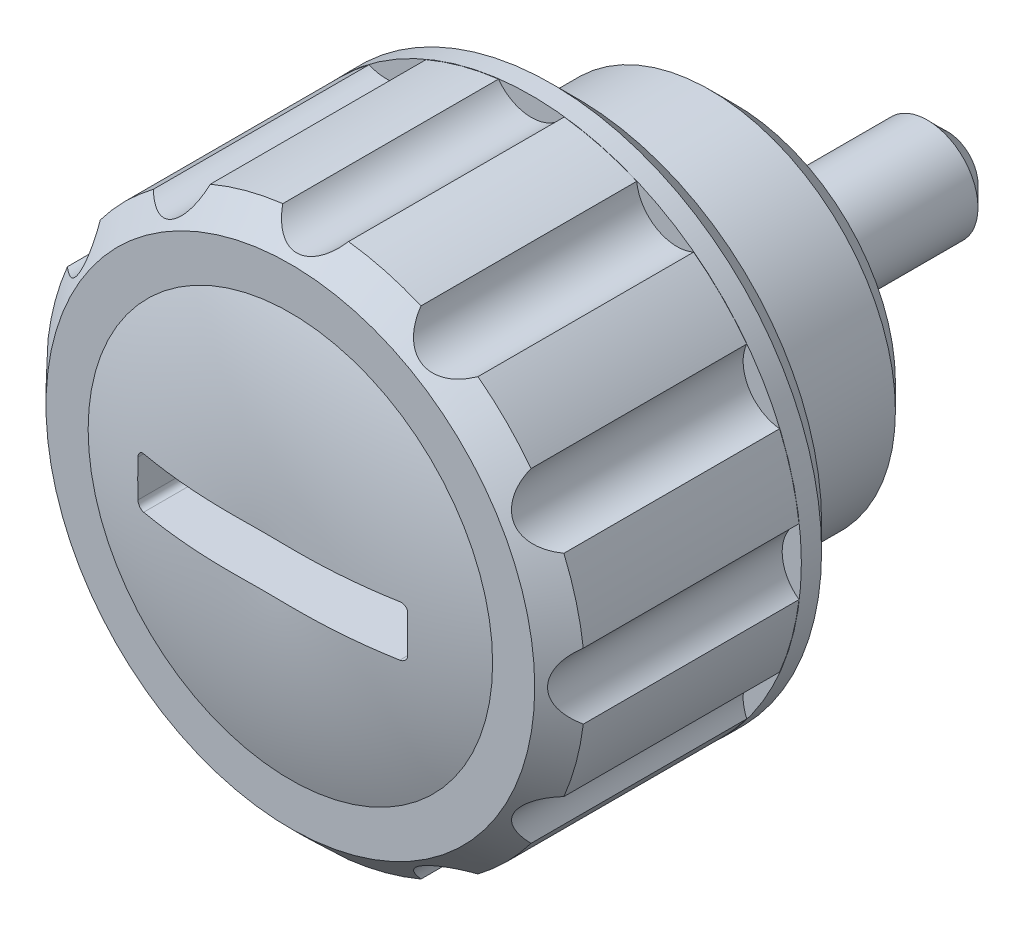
ISO-10303-21;
HEADER;
FILE_DESCRIPTION(('STEP AP214'),'2;1');
FILE_NAME('part.step','',(''),(''),'','','');
FILE_SCHEMA(('AUTOMOTIVE_DESIGN { 1 0 10303 214 1 1 1 1 }'));
ENDSEC;
DATA;
#1=APPLICATION_CONTEXT('core data for automotive mechanical design processes');
#2=APPLICATION_PROTOCOL_DEFINITION('international standard','automotive_design',2000,#1);
#3=PRODUCT_CONTEXT('',#1,'mechanical');
#4=PRODUCT('Part','Part','',(#3));
#5=PRODUCT_RELATED_PRODUCT_CATEGORY('part','',(#4));
#6=PRODUCT_DEFINITION_FORMATION('','',#4);
#7=PRODUCT_DEFINITION_CONTEXT('part definition',#1,'design');
#8=PRODUCT_DEFINITION('design','',#6,#7);
#9=PRODUCT_DEFINITION_SHAPE('','',#8);
#10=(LENGTH_UNIT() NAMED_UNIT(*) SI_UNIT(.MILLI.,.METRE.));
#11=(NAMED_UNIT(*) PLANE_ANGLE_UNIT() SI_UNIT($,.RADIAN.));
#12=(NAMED_UNIT(*) SI_UNIT($,.STERADIAN.) SOLID_ANGLE_UNIT());
#13=UNCERTAINTY_MEASURE_WITH_UNIT(LENGTH_MEASURE(1.E-05),#10,'distance_accuracy_value','');
#14=(GEOMETRIC_REPRESENTATION_CONTEXT(3) GLOBAL_UNCERTAINTY_ASSIGNED_CONTEXT((#13)) GLOBAL_UNIT_ASSIGNED_CONTEXT((#10,
#11,#12)) REPRESENTATION_CONTEXT('',''));
#15=CARTESIAN_POINT('',(0.,0.,0.));
#16=DIRECTION('',(0.,0.,1.));
#17=DIRECTION('',(1.,0.,0.));
#18=AXIS2_PLACEMENT_3D('',#15,#16,#17);
#19=CARTESIAN_POINT('',(0.,0.,-0.703698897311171));
#20=DIRECTION('',(0.,0.,1.));
#21=DIRECTION('',(1.,0.,0.));
#22=AXIS2_PLACEMENT_3D('',#19,#20,#21);
#23=DEGENERATE_TOROIDAL_SURFACE('',#22,1.1776626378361,15.,.T.);
#24=CARTESIAN_POINT('',(0.,0.,13.5));
#25=DIRECTION('',(0.,0.,1.));
#26=DIRECTION('',(1.,0.,0.));
#27=AXIS2_PLACEMENT_3D('',#24,#25,#26);
#28=CIRCLE('',#27,6.);
#29=CARTESIAN_POINT('',(6.,0.,13.5));
#30=VERTEX_POINT('',#29);
#31=EDGE_CURVE('E420',#30,#30,#28,.T.);
#32=ORIENTED_EDGE('',*,*,#31,.T.);
#33=EDGE_LOOP('',(#32));
#34=FACE_BOUND('',#33,.T.);
#35=CARTESIAN_POINT('',(-3.7998,-0.749999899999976,14.0521326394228));
#36=CARTESIAN_POINT('',(-3.81114880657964,-0.750020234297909,14.0500982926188));
#37=CARTESIAN_POINT('',(-3.82250108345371,-0.749057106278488,14.0480843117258));
#38=CARTESIAN_POINT('',(-3.84489426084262,-0.745224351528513,14.0441543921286));
#39=CARTESIAN_POINT('',(-3.85593522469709,-0.742355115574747,14.0422384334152));
#40=CARTESIAN_POINT('',(-3.87740011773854,-0.734767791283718,14.0385596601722));
#41=CARTESIAN_POINT('',(-3.88782359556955,-0.730048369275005,14.0367969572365));
#42=CARTESIAN_POINT('',(-3.90773653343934,-0.718887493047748,14.0334807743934));
#43=CARTESIAN_POINT('',(-3.91722631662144,-0.712446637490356,14.0319272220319));
#44=CARTESIAN_POINT('',(-3.93490505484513,-0.698084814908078,14.0290917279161));
#45=CARTESIAN_POINT('',(-3.9431055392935,-0.690178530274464,14.027807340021));
#46=CARTESIAN_POINT('',(-3.95806529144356,-0.673063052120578,14.025533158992));
#47=CARTESIAN_POINT('',(-3.96482436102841,-0.663853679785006,14.0245434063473));
#48=CARTESIAN_POINT('',(-3.97659283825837,-0.644555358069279,14.0229052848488));
#49=CARTESIAN_POINT('',(-3.98162854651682,-0.634482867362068,14.0222516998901));
#50=CARTESIAN_POINT('',(-3.98994131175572,-0.613624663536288,14.0212843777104));
#51=CARTESIAN_POINT('',(-3.99321964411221,-0.602839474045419,14.0209703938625));
#52=CARTESIAN_POINT('',(-3.99704991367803,-0.584948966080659,14.0207435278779));
#53=CARTESIAN_POINT('',(-3.99816189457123,-0.577959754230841,14.0207251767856));
#54=CARTESIAN_POINT('',(-3.99964030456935,-0.563913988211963,14.0208265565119));
#55=CARTESIAN_POINT('',(-4.00000779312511,-0.556857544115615,14.0209460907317));
#56=CARTESIAN_POINT('',(-3.9999999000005,-0.549800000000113,14.0211342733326));
#57=B_SPLINE_CURVE_WITH_KNOTS('',3,(#35,#36,#37,#38,#39,#40,#41,#42,#43,#44,#45,#46,#47,#48,#49,
#50,#51,#52,#53,#54,#55,#56),.UNSPECIFIED.,.F.,.F.,(4,2,2,2,2,2,2,2,2,2,4),(0.,
0.0345466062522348,0.0690861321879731,0.103650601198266,0.138203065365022,0.172426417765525,
0.206654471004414,0.240334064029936,0.273989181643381,0.295182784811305,0.316346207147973),.UNSPECIFIED.);
#58=CARTESIAN_POINT('',(-3.8,-0.75,14.0520967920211));
#59=VERTEX_POINT('',#58);
#60=CARTESIAN_POINT('',(-4.,-0.55,14.02112896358));
#61=VERTEX_POINT('',#60);
#62=EDGE_CURVE('E531',#59,#61,#57,.T.);
#63=ORIENTED_EDGE('',*,*,#62,.T.);
#64=CARTESIAN_POINT('',(-4.,0.,14.028388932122));
#65=CARTESIAN_POINT('',(-4.,0.339153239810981,14.0283961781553));
#66=CARTESIAN_POINT('',(-4.,0.678323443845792,14.0201840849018));
#67=CARTESIAN_POINT('',(-4.,1.35574448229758,13.9866878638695));
#68=CARTESIAN_POINT('',(-4.,1.69399552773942,13.9614080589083));
#69=CARTESIAN_POINT('',(-4.,2.36814839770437,13.8923714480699));
#70=CARTESIAN_POINT('',(-4.,2.7040529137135,13.8486414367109));
#71=CARTESIAN_POINT('',(-4.,3.37274568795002,13.7413643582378));
#72=CARTESIAN_POINT('',(-4.,3.70553346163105,13.6778142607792));
#73=CARTESIAN_POINT('',(-4.,4.45788889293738,13.5095576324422));
#74=CARTESIAN_POINT('',(-4.,4.87602372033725,13.3983308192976));
#75=CARTESIAN_POINT('',(-4.,5.70161656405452,13.1413580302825));
#76=CARTESIAN_POINT('',(-4.,6.10907328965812,12.9956079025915));
#77=CARTESIAN_POINT('',(-4.,6.91043852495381,12.6696375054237));
#78=CARTESIAN_POINT('',(-4.,7.30433371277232,12.4893844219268));
#79=CARTESIAN_POINT('',(-4.,8.07498519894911,12.0953512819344));
#80=CARTESIAN_POINT('',(-4.,8.45174183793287,11.8815718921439));
#81=CARTESIAN_POINT('',(-4.,9.18281763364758,11.4232419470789));
#82=CARTESIAN_POINT('',(-4.,9.53726091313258,11.1788894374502));
#83=CARTESIAN_POINT('',(-4.,10.2233955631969,10.6600773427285));
#84=CARTESIAN_POINT('',(-4.,10.5550867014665,10.3856174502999));
#85=CARTESIAN_POINT('',(-4.,11.1930381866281,9.8086212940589));
#86=CARTESIAN_POINT('',(-4.,11.4993002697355,9.50608695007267));
#87=CARTESIAN_POINT('',(-4.,12.0839658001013,8.87520844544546));
#88=CARTESIAN_POINT('',(-4.,12.3623701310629,8.54686510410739));
#89=CARTESIAN_POINT('',(-4.,12.8784698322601,7.8806109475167));
#90=CARTESIAN_POINT('',(-4.,13.1173543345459,7.54362037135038));
#91=CARTESIAN_POINT('',(-4.,13.5656684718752,6.85059247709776));
#92=CARTESIAN_POINT('',(-4.,13.7750989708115,6.49455571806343));
#93=CARTESIAN_POINT('',(-4.,14.1629376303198,5.76604322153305));
#94=CARTESIAN_POINT('',(-4.,14.3413507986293,5.39357014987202));
#95=CARTESIAN_POINT('',(-4.,14.6658865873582,4.63480988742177));
#96=CARTESIAN_POINT('',(-4.,14.8120091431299,4.24852266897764));
#97=CARTESIAN_POINT('',(-4.,15.0699099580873,3.46788913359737));
#98=CARTESIAN_POINT('',(-4.,15.1819394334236,3.07362578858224));
#99=CARTESIAN_POINT('',(-4.,15.3723250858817,2.2770527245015));
#100=CARTESIAN_POINT('',(-4.,15.4506814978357,1.87474306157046));
#101=CARTESIAN_POINT('',(-4.,15.5731575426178,1.06492658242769));
#102=CARTESIAN_POINT('',(-4.,15.617275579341,0.657419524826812));
#103=CARTESIAN_POINT('',(-4.,15.6709496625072,-0.159864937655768));
#104=CARTESIAN_POINT('',(-4.,15.6805056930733,-0.569642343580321));
#105=CARTESIAN_POINT('',(-4.,15.665001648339,-1.38774900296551));
#106=CARTESIAN_POINT('',(-4.,15.6400084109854,-1.7960795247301));
#107=CARTESIAN_POINT('',(-4.,15.5557048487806,-2.60918184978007));
#108=CARTESIAN_POINT('',(-4.,15.4963945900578,-3.01395365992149));
#109=CARTESIAN_POINT('',(-4.,15.3438918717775,-3.8170229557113));
#110=CARTESIAN_POINT('',(-4.,15.2507026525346,-4.21532105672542));
#111=CARTESIAN_POINT('',(-4.,15.0311128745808,-5.00265431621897));
#112=CARTESIAN_POINT('',(-4.,14.9047123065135,-5.39168947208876));
#113=CARTESIAN_POINT('',(-4.,14.619619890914,-6.15771427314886));
#114=CARTESIAN_POINT('',(-4.,14.4609300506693,-6.53470466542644));
#115=CARTESIAN_POINT('',(-4.,14.112398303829,-7.27399825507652));
#116=CARTESIAN_POINT('',(-4.,13.9225564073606,-7.63630145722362));
#117=CARTESIAN_POINT('',(-4.,13.5130367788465,-8.34375702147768));
#118=CARTESIAN_POINT('',(-4.,13.2933514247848,-8.68890497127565));
#119=CARTESIAN_POINT('',(-4.,12.825767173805,-9.35952806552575));
#120=CARTESIAN_POINT('',(-4.,12.5778682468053,-9.68500318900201));
#121=CARTESIAN_POINT('',(-4.,12.0550681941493,-10.3147088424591));
#122=CARTESIAN_POINT('',(-4.,11.7801085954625,-10.6188908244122));
#123=CARTESIAN_POINT('',(-4.,11.2056412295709,-11.2031141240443));
#124=CARTESIAN_POINT('',(-4.,10.9061334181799,-11.4831553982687));
#125=CARTESIAN_POINT('',(-4.,10.2849635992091,-12.0170071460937));
#126=CARTESIAN_POINT('',(-4.,9.96331753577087,-12.2708361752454));
#127=CARTESIAN_POINT('',(-4.,9.30001359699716,-12.7508263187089));
#128=CARTESIAN_POINT('',(-4.,8.95835585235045,-12.9769876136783));
#129=CARTESIAN_POINT('',(-4.,8.25506085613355,-13.4017235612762));
#130=CARTESIAN_POINT('',(-4.,7.89330122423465,-13.6000955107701));
#131=CARTESIAN_POINT('',(-4.,7.1546361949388,-13.9662854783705));
#132=CARTESIAN_POINT('',(-4.,6.77773047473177,-14.1341028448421));
#133=CARTESIAN_POINT('',(-4.,6.01113338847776,-14.4386630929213));
#134=CARTESIAN_POINT('',(-4.,5.62142902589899,-14.5753731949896));
#135=CARTESIAN_POINT('',(-4.,4.83241304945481,-14.817363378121));
#136=CARTESIAN_POINT('',(-4.,4.4331021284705,-14.9226457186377));
#137=CARTESIAN_POINT('',(-4.,3.77164652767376,-15.0703302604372));
#138=CARTESIAN_POINT('',(-4.,3.51147362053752,-15.1217585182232));
#139=CARTESIAN_POINT('',(-4.,2.98899804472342,-15.2123395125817));
#140=CARTESIAN_POINT('',(-4.,2.7266952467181,-15.2514914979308));
#141=CARTESIAN_POINT('',(-4.,1.93724201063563,-15.3514509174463));
#142=CARTESIAN_POINT('',(-4.,1.40777675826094,-15.3947116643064));
#143=CARTESIAN_POINT('',(-4.,0.612198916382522,-15.4285188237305));
#144=CARTESIAN_POINT('',(-4.,0.346571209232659,-15.4345998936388));
#145=CARTESIAN_POINT('',(-4.,-0.184756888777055,-15.4366600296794));
#146=CARTESIAN_POINT('',(-4.,-0.450457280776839,-15.4326389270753));
#147=CARTESIAN_POINT('',(-4.,-0.981374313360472,-15.4142959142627));
#148=CARTESIAN_POINT('',(-4.,-1.24659112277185,-15.3999788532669));
#149=CARTESIAN_POINT('',(-4.,-1.7762314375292,-15.3604541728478));
#150=CARTESIAN_POINT('',(-4.,-2.04065492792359,-15.3352463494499));
#151=CARTESIAN_POINT('',(-4.,-2.52470132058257,-15.2783376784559));
#152=CARTESIAN_POINT('',(-4.,-2.74453002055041,-15.248390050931));
#153=CARTESIAN_POINT('',(-4.,-3.18285214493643,-15.1800456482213));
#154=CARTESIAN_POINT('',(-4.,-3.40134562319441,-15.1416492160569));
#155=CARTESIAN_POINT('',(-4.,-4.05419633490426,-15.0133381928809));
#156=CARTESIAN_POINT('',(-4.,-4.48606739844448,-14.9102854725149));
#157=CARTESIAN_POINT('',(-4.,-5.33835432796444,-14.6682914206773));
#158=CARTESIAN_POINT('',(-4.,-5.75879820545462,-14.5294486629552));
#159=CARTESIAN_POINT('',(-4.,-6.58609234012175,-14.2156839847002));
#160=CARTESIAN_POINT('',(-4.,-6.99294114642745,-14.0407582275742));
#161=CARTESIAN_POINT('',(-4.,-7.79138450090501,-13.6547019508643));
#162=CARTESIAN_POINT('',(-4.,-8.18290123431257,-13.4434103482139));
#163=CARTESIAN_POINT('',(-4.,-8.94537896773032,-12.9865110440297));
#164=CARTESIAN_POINT('',(-4.,-9.31634014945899,-12.7409036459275));
#165=CARTESIAN_POINT('',(-4.,-10.0350527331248,-12.2167860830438));
#166=CARTESIAN_POINT('',(-4.,-10.3827705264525,-11.9382298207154));
#167=CARTESIAN_POINT('',(-4.,-11.0514362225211,-11.350662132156));
#168=CARTESIAN_POINT('',(-4.,-11.3723853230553,-11.0416520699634));
#169=CARTESIAN_POINT('',(-4.,-11.9642331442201,-10.4173353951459));
#170=CARTESIAN_POINT('',(-4.,-12.2370447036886,-10.1038391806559));
#171=CARTESIAN_POINT('',(-4.,-12.7549508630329,-9.4547474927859));
#172=CARTESIAN_POINT('',(-4.,-13.0000469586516,-9.11915321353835));
#173=CARTESIAN_POINT('',(-4.,-13.4605522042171,-8.42850547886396));
#174=CARTESIAN_POINT('',(-4.,-13.67598107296,-8.07346517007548));
#175=CARTESIAN_POINT('',(-4.,-14.0757477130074,-7.34628666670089));
#176=CARTESIAN_POINT('',(-4.,-14.2600853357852,-6.97414839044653));
#177=CARTESIAN_POINT('',(-4.,-14.5943069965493,-6.21997693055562));
#178=CARTESIAN_POINT('',(-4.,-14.7445728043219,-5.83811287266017));
#179=CARTESIAN_POINT('',(-4.,-15.0123145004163,-5.06306047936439));
#180=CARTESIAN_POINT('',(-4.,-15.1297907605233,-4.669872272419));
#181=CARTESIAN_POINT('',(-4.,-15.3311166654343,-3.87492033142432));
#182=CARTESIAN_POINT('',(-4.,-15.4149615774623,-3.47315539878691));
#183=CARTESIAN_POINT('',(-4.,-15.5483930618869,-2.66397544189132));
#184=CARTESIAN_POINT('',(-4.,-15.5979796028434,-2.25656041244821));
#185=CARTESIAN_POINT('',(-4.,-15.6624394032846,-1.44020146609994));
#186=CARTESIAN_POINT('',(-4.,-15.6774144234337,-1.03126558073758));
#187=CARTESIAN_POINT('',(-4.,-15.6728420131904,-0.213587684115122));
#188=CARTESIAN_POINT('',(-4.,-15.653294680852,0.19515432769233));
#189=CARTESIAN_POINT('',(-4.,-15.5798200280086,1.00952109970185));
#190=CARTESIAN_POINT('',(-4.,-15.5258939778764,1.41514597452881));
#191=CARTESIAN_POINT('',(-4.,-15.3840519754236,2.22040863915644));
#192=CARTESIAN_POINT('',(-4.,-15.2961360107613,2.62004642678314));
#193=CARTESIAN_POINT('',(-4.,-15.0869932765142,3.41032437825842));
#194=CARTESIAN_POINT('',(-4.,-14.9657808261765,3.8009683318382));
#195=CARTESIAN_POINT('',(-4.,-14.6909025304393,4.57066557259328));
#196=CARTESIAN_POINT('',(-4.,-14.5372367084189,4.94971886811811));
#197=CARTESIAN_POINT('',(-4.,-14.198563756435,5.6935427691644));
#198=CARTESIAN_POINT('',(-4.,-14.0135574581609,6.05831375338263));
#199=CARTESIAN_POINT('',(-4.,-13.6135344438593,6.77101064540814));
#200=CARTESIAN_POINT('',(-4.,-13.3985177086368,7.11893654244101));
#201=CARTESIAN_POINT('',(-4.,-12.9397392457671,7.79592064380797));
#202=CARTESIAN_POINT('',(-4.,-12.695942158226,8.12495488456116));
#203=CARTESIAN_POINT('',(-4.,-12.1815798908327,8.76138756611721));
#204=CARTESIAN_POINT('',(-4.,-11.91101469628,9.068785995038));
#205=CARTESIAN_POINT('',(-4.,-11.3450384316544,9.65985804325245));
#206=CARTESIAN_POINT('',(-4.,-11.049624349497,9.94352877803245));
#207=CARTESIAN_POINT('',(-4.,-10.4361166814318,10.4851767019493));
#208=CARTESIAN_POINT('',(-4.,-10.1180230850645,10.7431538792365));
#209=CARTESIAN_POINT('',(-4.,-9.45975657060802,11.2329803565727));
#210=CARTESIAN_POINT('',(-4.,-9.11947790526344,11.4646875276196));
#211=CARTESIAN_POINT('',(-4.,-8.42081797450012,11.8989645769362));
#212=CARTESIAN_POINT('',(-4.,-8.06243669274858,12.1015344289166));
#213=CARTESIAN_POINT('',(-4.,-7.33043234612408,12.476268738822));
#214=CARTESIAN_POINT('',(-4.,-6.95681985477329,12.6484538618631));
#215=CARTESIAN_POINT('',(-4.,-6.19684574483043,12.961845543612));
#216=CARTESIAN_POINT('',(-4.,-5.81048403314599,13.1030518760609));
#217=CARTESIAN_POINT('',(-4.,-4.98307663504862,13.3686004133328));
#218=CARTESIAN_POINT('',(-4.,-4.54082134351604,13.4891802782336));
#219=CARTESIAN_POINT('',(-4.,-3.64769934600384,13.6923551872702));
#220=CARTESIAN_POINT('',(-4.,-3.19683149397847,13.774945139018));
#221=CARTESIAN_POINT('',(-4.,-2.28933102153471,13.9045907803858));
#222=CARTESIAN_POINT('',(-4.,-1.83269032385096,13.9515893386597));
#223=CARTESIAN_POINT('',(-4.,-1.14623014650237,13.9979727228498));
#224=CARTESIAN_POINT('',(-4.,-0.917138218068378,14.0094147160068));
#225=CARTESIAN_POINT('',(-4.,-0.458700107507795,14.0246202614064));
#226=CARTESIAN_POINT('',(-4.,-0.229353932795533,14.0283840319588));
#227=CARTESIAN_POINT('',(-4.,0.,14.028388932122));
#228=B_SPLINE_CURVE_WITH_KNOTS('',3,(#64,#65,#66,#67,#68,#69,#70,#71,#72,#73,#74,#75,#76,#77,
#78,#79,#80,#81,#82,#83,#84,#85,#86,#87,#88,#89,#90,#91,#92,#93,#94,#95,#96,#97,#98,#99,#100,
#101,#102,#103,#104,#105,#106,#107,#108,#109,#110,#111,#112,#113,#114,#115,#116,#117,#118,#119,
#120,#121,#122,#123,#124,#125,#126,#127,#128,#129,#130,#131,#132,#133,#134,#135,#136,#137,#138,
#139,#140,#141,#142,#143,#144,#145,#146,#147,#148,#149,#150,#151,#152,#153,#154,#155,#156,#157,
#158,#159,#160,#161,#162,#163,#164,#165,#166,#167,#168,#169,#170,#171,#172,#173,#174,#175,#176,
#177,#178,#179,#180,#181,#182,#183,#184,#185,#186,#187,#188,#189,#190,#191,#192,#193,#194,#195,
#196,#197,#198,#199,#200,#201,#202,#203,#204,#205,#206,#207,#208,#209,#210,#211,#212,#213,#214,
#215,#216,#217,#218,#219,#220,#221,#222,#223,#224,#225,#226,#227),.UNSPECIFIED.,.T.,.F.,(4,2,2,
2,2,2,2,2,2,2,2,2,2,2,2,2,2,2,2,2,2,2,2,2,2,2,2,2,2,2,2,2,2,2,2,2,2,2,2,2,2,2,2,2,2,2,2,2,2,2,2,
2,2,2,2,2,2,2,2,2,2,2,2,2,2,2,2,2,2,2,2,2,2,2,2,2,2,2,2,2,2,4),(0.,1.01738294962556,
2.03450831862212,3.05016161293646,4.06597026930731,5.36249424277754,6.6591742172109,
7.95709358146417,9.25498713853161,10.5448707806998,11.8347675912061,13.1245762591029,
14.4143439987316,15.6520836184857,16.8897869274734,18.1272902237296,19.3647959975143,
20.5929491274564,21.8210936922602,23.0492955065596,24.2774978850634,25.5033275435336,
26.7291548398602,27.9548649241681,29.1805753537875,30.4062096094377,31.6318434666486,
32.8577909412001,34.0837397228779,35.3123982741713,36.5410590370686,37.7688439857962,
38.9966209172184,40.2329329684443,41.4692713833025,42.7069066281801,43.9444528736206,
44.7397910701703,45.5351779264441,47.1266553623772,47.9236225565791,48.7206030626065,
49.5172084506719,50.3138287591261,50.9792441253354,51.6446324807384,52.9749769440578,
54.301695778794,55.6285557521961,56.9614518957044,58.2943362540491,59.6291079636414,
60.9638199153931,62.2090674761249,63.4542478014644,64.6985964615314,65.9429510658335,
67.1725857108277,68.4022064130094,69.6320000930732,70.8617949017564,72.0879693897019,
73.3141403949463,74.5402660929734,75.7663922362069,76.9919919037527,78.2175906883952,
79.4431569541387,80.6687240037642,81.8958127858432,83.1229022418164,84.3501406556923,
85.5773796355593,86.8109699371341,88.0445613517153,89.2773105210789,90.510068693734,
91.8834796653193,93.2570746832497,94.632869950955,95.3208993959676,96.0089092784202),.UNSPECIFIED.);
#229=CARTESIAN_POINT('',(-4.,0.55,14.02112896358));
#230=VERTEX_POINT('',#229);
#231=EDGE_CURVE('E230',#61,#230,#228,.T.);
#232=ORIENTED_EDGE('',*,*,#231,.T.);
#233=CARTESIAN_POINT('',(-3.99999989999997,0.5498,14.0211342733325));
#234=CARTESIAN_POINT('',(-4.00002120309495,0.560882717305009,14.0208370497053));
#235=CARTESIAN_POINT('',(-3.99910147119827,0.571967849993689,14.0207119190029));
#236=CARTESIAN_POINT('',(-3.99545102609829,0.59382219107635,14.0208010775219));
#237=CARTESIAN_POINT('',(-3.99272233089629,0.604591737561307,14.021014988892));
#238=CARTESIAN_POINT('',(-3.98552323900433,0.625524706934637,14.0217769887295));
#239=CARTESIAN_POINT('',(-3.98105209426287,0.635687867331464,14.0223252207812));
#240=CARTESIAN_POINT('',(-3.97050578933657,0.655118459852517,14.0237373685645));
#241=CARTESIAN_POINT('',(-3.96443078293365,0.664385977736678,14.0246012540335));
#242=CARTESIAN_POINT('',(-3.95082544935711,0.681812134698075,14.0266217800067));
#243=CARTESIAN_POINT('',(-3.94328885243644,0.689965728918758,14.0277796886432));
#244=CARTESIAN_POINT('',(-3.92699598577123,0.704900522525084,14.030350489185));
#245=CARTESIAN_POINT('',(-3.91823946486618,0.711681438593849,14.0317634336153));
#246=CARTESIAN_POINT('',(-3.89962640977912,0.723780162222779,14.0348229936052));
#247=CARTESIAN_POINT('',(-3.88975612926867,0.729076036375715,14.0364726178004));
#248=CARTESIAN_POINT('',(-3.86929754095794,0.737941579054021,14.0399411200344));
#249=CARTESIAN_POINT('',(-3.858709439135,0.741511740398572,14.0417599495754));
#250=CARTESIAN_POINT('',(-3.84003688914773,0.746119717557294,14.0450054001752));
#251=CARTESIAN_POINT('',(-3.83204943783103,0.747581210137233,14.046405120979));
#252=CARTESIAN_POINT('',(-3.8159747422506,0.749525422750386,14.0492439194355));
#253=CARTESIAN_POINT('',(-3.80788765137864,0.750009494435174,14.0506829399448));
#254=CARTESIAN_POINT('',(-3.79980000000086,0.749999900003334,14.052132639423));
#255=B_SPLINE_CURVE_WITH_KNOTS('',3,(#233,#234,#235,#236,#237,#238,#239,#240,#241,#242,#243,
#244,#245,#246,#247,#248,#249,#250,#251,#252,#253,#254),.UNSPECIFIED.,.F.,.F.,(4,2,2,2,2,2,2,2,
2,2,4),(0.,0.0332152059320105,0.0663934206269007,0.0995858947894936,0.132775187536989,
0.166110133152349,0.199451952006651,0.233262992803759,0.267064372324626,0.291727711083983,
0.316356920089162),.UNSPECIFIED.);
#256=CARTESIAN_POINT('',(-3.79999999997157,0.75,14.0520967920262));
#257=VERTEX_POINT('',#256);
#258=EDGE_CURVE('E485',#230,#257,#255,.T.);
#259=ORIENTED_EDGE('',*,*,#258,.T.);
#260=CARTESIAN_POINT('',(0.,0.75,14.2902033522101));
#261=CARTESIAN_POINT('',(0.062509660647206,0.75,14.2902036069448));
#262=CARTESIAN_POINT('',(0.125019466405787,0.75,14.2904360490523));
#263=CARTESIAN_POINT('',(0.250036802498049,0.75,14.291252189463));
#264=CARTESIAN_POINT('',(0.312544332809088,0.75,14.2918358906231));
#265=CARTESIAN_POINT('',(0.437565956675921,0.75,14.2930988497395));
#266=CARTESIAN_POINT('',(0.500080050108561,0.75,14.2937781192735));
#267=CARTESIAN_POINT('',(0.625113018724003,0.75,14.2949804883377));
#268=CARTESIAN_POINT('',(0.687631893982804,0.75,14.2955035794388));
#269=CARTESIAN_POINT('',(0.875766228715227,0.75,14.2965328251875));
#270=CARTESIAN_POINT('',(1.00138686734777,0.75,14.2964891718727));
#271=CARTESIAN_POINT('',(1.25260493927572,0.75,14.2940460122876));
#272=CARTESIAN_POINT('',(1.37820237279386,0.75,14.2916465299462));
#273=CARTESIAN_POINT('',(1.75485708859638,0.75,14.2803277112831));
#274=CARTESIAN_POINT('',(2.00580900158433,0.75,14.2672884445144));
#275=CARTESIAN_POINT('',(2.50689880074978,0.75,14.2291477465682));
#276=CARTESIAN_POINT('',(2.75703633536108,0.75,14.2040416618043));
#277=CARTESIAN_POINT('',(3.25583549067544,0.75,14.1415504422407));
#278=CARTESIAN_POINT('',(3.5044966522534,0.75,14.1041616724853));
#279=CARTESIAN_POINT('',(4.16871083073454,0.75,13.9873107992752));
#280=CARTESIAN_POINT('',(4.58233519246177,0.75,13.8965497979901));
#281=CARTESIAN_POINT('',(5.40052634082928,0.75,13.6805066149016));
#282=CARTESIAN_POINT('',(5.80509101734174,0.75,13.5552164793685));
#283=CARTESIAN_POINT('',(6.60293944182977,0.75,13.2706758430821));
#284=CARTESIAN_POINT('',(6.99620137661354,0.75,13.1113641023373));
#285=CARTESIAN_POINT('',(7.76780860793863,0.75,12.760031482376));
#286=CARTESIAN_POINT('',(8.14615456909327,0.75,12.5680120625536));
#287=CARTESIAN_POINT('',(8.88446706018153,0.75,12.1530468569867));
#288=CARTESIAN_POINT('',(9.2444697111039,0.75,11.9301653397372));
#289=CARTESIAN_POINT('',(9.9443450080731,0.75,11.4547620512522));
#290=CARTESIAN_POINT('',(10.2842175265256,0.75,11.2022400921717));
#291=CARTESIAN_POINT('',(10.9411846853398,0.75,10.6695279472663));
#292=CARTESIAN_POINT('',(11.2582935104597,0.75,10.3893552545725));
#293=CARTESIAN_POINT('',(11.867695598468,0.75,9.80321084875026));
#294=CARTESIAN_POINT('',(12.1599889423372,0.75,9.49723921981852));
#295=CARTESIAN_POINT('',(12.7167806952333,0.75,8.86269415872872));
#296=CARTESIAN_POINT('',(12.9813643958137,0.75,8.53419556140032));
#297=CARTESIAN_POINT('',(13.4819097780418,0.75,7.85607214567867));
#298=CARTESIAN_POINT('',(13.7178715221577,0.75,7.50644737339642));
#299=CARTESIAN_POINT('',(14.1595322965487,0.75,6.78849443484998));
#300=CARTESIAN_POINT('',(14.3652260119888,0.75,6.42016299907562));
#301=CARTESIAN_POINT('',(14.7448367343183,0.75,5.66747355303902));
#302=CARTESIAN_POINT('',(14.9187537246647,0.75,5.28311553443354));
#303=CARTESIAN_POINT('',(15.2335050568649,0.75,4.50127546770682));
#304=CARTESIAN_POINT('',(15.3743535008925,0.75,4.10379909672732));
#305=CARTESIAN_POINT('',(15.6220611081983,0.75,3.29839291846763));
#306=CARTESIAN_POINT('',(15.7289202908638,0.75,2.89046311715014));
#307=CARTESIAN_POINT('',(15.9078821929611,0.75,2.06708280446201));
#308=CARTESIAN_POINT('',(15.9799876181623,0.75,1.65163288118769));
#309=CARTESIAN_POINT('',(16.0889414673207,0.75,0.816135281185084));
#310=CARTESIAN_POINT('',(16.1257898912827,0.75,0.396087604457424));
#311=CARTESIAN_POINT('',(16.163965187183,0.75,-0.445565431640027));
#312=CARTESIAN_POINT('',(16.1652965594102,0.75,-0.867170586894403));
#313=CARTESIAN_POINT('',(16.1324397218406,0.75,-1.7089944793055));
#314=CARTESIAN_POINT('',(16.0982515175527,0.75,-2.12921321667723));
#315=CARTESIAN_POINT('',(15.994590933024,0.75,-2.96533956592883));
#316=CARTESIAN_POINT('',(15.9251132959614,0.75,-3.38124652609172));
#317=CARTESIAN_POINT('',(15.751365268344,0.75,-4.20572862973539));
#318=CARTESIAN_POINT('',(15.6470948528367,0.75,-4.61430376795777));
#319=CARTESIAN_POINT('',(15.4044819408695,0.75,-5.42128714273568));
#320=CARTESIAN_POINT('',(15.2661335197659,0.75,-5.8196935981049));
#321=CARTESIAN_POINT('',(14.9563586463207,0.75,-6.6034316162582));
#322=CARTESIAN_POINT('',(14.7849322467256,0.75,-6.9887631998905));
#323=CARTESIAN_POINT('',(14.410318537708,0.75,-7.74341593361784));
#324=CARTESIAN_POINT('',(14.2071477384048,0.75,-8.11274527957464));
#325=CARTESIAN_POINT('',(13.7704245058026,0.75,-8.83298393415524));
#326=CARTESIAN_POINT('',(13.5368719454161,0.75,-9.18389316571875));
#327=CARTESIAN_POINT('',(13.0411762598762,0.75,-9.86461934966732));
#328=CARTESIAN_POINT('',(12.7790481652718,0.75,-10.1944472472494));
#329=CARTESIAN_POINT('',(12.2279683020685,0.75,-10.8308662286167));
#330=CARTESIAN_POINT('',(11.9390170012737,0.75,-11.1374577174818));
#331=CARTESIAN_POINT('',(11.3358371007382,0.75,-11.7257264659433));
#332=CARTESIAN_POINT('',(11.0215672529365,0.75,-12.0073614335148));
#333=CARTESIAN_POINT('',(10.3703891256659,0.75,-12.5431585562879));
#334=CARTESIAN_POINT('',(10.0334794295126,0.75,-12.7973189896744));
#335=CARTESIAN_POINT('',(9.33882156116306,0.75,-13.2767706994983));
#336=CARTESIAN_POINT('',(8.98103735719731,0.75,-13.5020097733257));
#337=CARTESIAN_POINT('',(8.24780759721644,0.75,-13.9214489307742));
#338=CARTESIAN_POINT('',(7.87236542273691,0.75,-14.1156549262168));
#339=CARTESIAN_POINT('',(7.10830459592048,0.75,-14.4708441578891));
#340=CARTESIAN_POINT('',(6.71975907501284,0.75,-14.6319846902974));
#341=CARTESIAN_POINT('',(5.93032689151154,0.75,-14.9212008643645));
#342=CARTESIAN_POINT('',(5.52943355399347,0.75,-15.049258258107));
#343=CARTESIAN_POINT('',(4.71037120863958,0.75,-15.2735305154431));
#344=CARTESIAN_POINT('',(4.29201779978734,0.75,-15.3690765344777));
#345=CARTESIAN_POINT('',(3.65997311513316,0.75,-15.485449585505));
#346=CARTESIAN_POINT('',(3.44867138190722,0.75,-15.5197366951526));
#347=CARTESIAN_POINT('',(3.02478880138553,0.75,-15.5793924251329));
#348=CARTESIAN_POINT('',(2.81220789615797,0.75,-15.6047606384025));
#349=CARTESIAN_POINT('',(2.38452719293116,0.75,-15.6468286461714));
#350=CARTESIAN_POINT('',(2.16942066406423,0.75,-15.6634594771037));
#351=CARTESIAN_POINT('',(1.73875062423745,0.75,-15.6880212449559));
#352=CARTESIAN_POINT('',(1.5231871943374,0.75,-15.6959536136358));
#353=CARTESIAN_POINT('',(1.19954465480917,0.75,-15.7021388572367));
#354=CARTESIAN_POINT('',(1.09150789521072,0.75,-15.7032466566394));
#355=CARTESIAN_POINT('',(0.875426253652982,0.75,-15.7039178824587));
#356=CARTESIAN_POINT('',(0.767381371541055,0.75,-15.7034812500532));
#357=CARTESIAN_POINT('',(0.551281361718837,0.75,-15.7017790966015));
#358=CARTESIAN_POINT('',(0.443226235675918,0.75,-15.7005134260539));
#359=CARTESIAN_POINT('',(0.281143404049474,0.75,-15.6989476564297));
#360=CARTESIAN_POINT('',(0.227117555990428,0.75,-15.698481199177));
#361=CARTESIAN_POINT('',(0.119064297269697,0.75,-15.6978197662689));
#362=CARTESIAN_POINT('',(0.0650368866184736,0.75,-15.6976247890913));
#363=CARTESIAN_POINT('',(-0.05800398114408,0.75,-15.6975761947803));
#364=CARTESIAN_POINT('',(-0.127017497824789,0.75,-15.6978322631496));
#365=CARTESIAN_POINT('',(-0.265042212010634,0.75,-15.6987649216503));
#366=CARTESIAN_POINT('',(-0.334053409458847,0.75,-15.6994415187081));
#367=CARTESIAN_POINT('',(-0.47207998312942,0.75,-15.7008610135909));
#368=CARTESIAN_POINT('',(-0.541095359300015,0.75,-15.7016039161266));
#369=CARTESIAN_POINT('',(-0.679127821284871,0.75,-15.7028300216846));
#370=CARTESIAN_POINT('',(-0.748144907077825,0.75,-15.7033132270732));
#371=CARTESIAN_POINT('',(-0.955164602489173,0.75,-15.7040009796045));
#372=CARTESIAN_POINT('',(-1.0931724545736,0.75,-15.7034443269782));
#373=CARTESIAN_POINT('',(-1.36914222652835,0.75,-15.6993084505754));
#374=CARTESIAN_POINT('',(-1.50710414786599,0.75,-15.6957293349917));
#375=CARTESIAN_POINT('',(-1.78256534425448,0.75,-15.685188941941));
#376=CARTESIAN_POINT('',(-1.92006492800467,0.75,-15.6782359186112));
#377=CARTESIAN_POINT('',(-2.19483905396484,0.75,-15.6607772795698));
#378=CARTESIAN_POINT('',(-2.33211359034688,0.75,-15.6502715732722));
#379=CARTESIAN_POINT('',(-2.743559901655,0.75,-15.6132836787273));
#380=CARTESIAN_POINT('',(-3.01726339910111,0.75,-15.581334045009));
#381=CARTESIAN_POINT('',(-3.55992465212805,0.75,-15.5030144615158));
#382=CARTESIAN_POINT('',(-3.82890277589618,0.75,-15.4567848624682));
#383=CARTESIAN_POINT('',(-4.36392755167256,0.75,-15.3498484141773));
#384=CARTESIAN_POINT('',(-4.62997463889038,0.75,-15.2891437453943));
#385=CARTESIAN_POINT('',(-5.15895710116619,0.75,-15.1532282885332));
#386=CARTESIAN_POINT('',(-5.42188447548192,0.75,-15.0779863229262));
#387=CARTESIAN_POINT('',(-5.94322863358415,0.75,-14.9132881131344));
#388=CARTESIAN_POINT('',(-6.20164546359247,0.75,-14.8238320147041));
#389=CARTESIAN_POINT('',(-6.85115229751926,0.75,-14.5789290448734));
#390=CARTESIAN_POINT('',(-7.23867684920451,0.75,-14.4139021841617));
#391=CARTESIAN_POINT('',(-7.99805018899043,0.75,-14.0520702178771));
#392=CARTESIAN_POINT('',(-8.36991500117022,0.75,-13.8552986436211));
#393=CARTESIAN_POINT('',(-9.09777056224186,0.75,-13.4300705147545));
#394=CARTESIAN_POINT('',(-9.45366504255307,0.75,-13.2014490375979));
#395=CARTESIAN_POINT('',(-10.1449857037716,0.75,-12.714880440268));
#396=CARTESIAN_POINT('',(-10.4804049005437,0.75,-12.4569233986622));
#397=CARTESIAN_POINT('',(-11.1277254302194,0.75,-11.9140206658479));
#398=CARTESIAN_POINT('',(-11.4396635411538,0.75,-11.6291188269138));
#399=CARTESIAN_POINT('',(-12.0383542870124,0.75,-11.0340393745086));
#400=CARTESIAN_POINT('',(-12.3251095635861,0.75,-10.7238644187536));
#401=CARTESIAN_POINT('',(-12.870898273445,0.75,-10.0810426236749));
#402=CARTESIAN_POINT('',(-13.1299839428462,0.75,-9.74844013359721));
#403=CARTESIAN_POINT('',(-13.619228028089,0.75,-9.06258526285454));
#404=CARTESIAN_POINT('',(-13.8493856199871,0.75,-8.70933229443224));
#405=CARTESIAN_POINT('',(-14.2791137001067,0.75,-7.98471878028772));
#406=CARTESIAN_POINT('',(-14.4786861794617,0.75,-7.61335941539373));
#407=CARTESIAN_POINT('',(-14.8458413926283,0.75,-6.85515348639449));
#408=CARTESIAN_POINT('',(-15.0134243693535,0.75,-6.46830703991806));
#409=CARTESIAN_POINT('',(-15.3155070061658,0.75,-5.6816225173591));
#410=CARTESIAN_POINT('',(-15.4499855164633,0.75,-5.2817763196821));
#411=CARTESIAN_POINT('',(-15.6847633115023,0.75,-4.47217121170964));
#412=CARTESIAN_POINT('',(-15.7850625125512,0.75,-4.06241227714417));
#413=CARTESIAN_POINT('',(-15.9507352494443,0.75,-3.23605764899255));
#414=CARTESIAN_POINT('',(-16.0161221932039,0.75,-2.81946464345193));
#415=CARTESIAN_POINT('',(-16.1115638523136,0.75,-1.98225120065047));
#416=CARTESIAN_POINT('',(-16.1416186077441,0.75,-1.56163076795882));
#417=CARTESIAN_POINT('',(-16.1661796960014,0.75,-0.719438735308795));
#418=CARTESIAN_POINT('',(-16.1606932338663,0.75,-0.297867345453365));
#419=CARTESIAN_POINT('',(-16.114227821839,0.75,0.543314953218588));
#420=CARTESIAN_POINT('',(-16.0732488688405,0.75,0.962925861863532));
#421=CARTESIAN_POINT('',(-15.9560905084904,0.75,1.79720001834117));
#422=CARTESIAN_POINT('',(-15.8799114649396,0.75,2.21186331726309));
#423=CARTESIAN_POINT('',(-15.6928948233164,0.75,3.03329916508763));
#424=CARTESIAN_POINT('',(-15.582057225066,0.75,3.44007171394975));
#425=CARTESIAN_POINT('',(-15.3264932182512,0.75,4.24289288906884));
#426=CARTESIAN_POINT('',(-15.181761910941,0.75,4.63893995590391));
#427=CARTESIAN_POINT('',(-14.8594487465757,0.75,5.41743335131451));
#428=CARTESIAN_POINT('',(-14.68186687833,0.75,5.79987967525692));
#429=CARTESIAN_POINT('',(-14.2950896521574,0.75,6.54850360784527));
#430=CARTESIAN_POINT('',(-14.0858900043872,0.75,6.91467900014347));
#431=CARTESIAN_POINT('',(-13.6373836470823,0.75,7.62810226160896));
#432=CARTESIAN_POINT('',(-13.3980769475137,0.75,7.97535013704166));
#433=CARTESIAN_POINT('',(-12.8911539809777,0.75,8.64832469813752));
#434=CARTESIAN_POINT('',(-12.6235482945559,0.75,8.97405935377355));
#435=CARTESIAN_POINT('',(-12.0618570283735,0.75,9.60183607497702));
#436=CARTESIAN_POINT('',(-11.767771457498,0.75,9.9038781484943));
#437=CARTESIAN_POINT('',(-11.1552973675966,0.75,10.4820455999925));
#438=CARTESIAN_POINT('',(-10.8369156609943,0.75,10.758178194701));
#439=CARTESIAN_POINT('',(-10.1780402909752,0.75,11.2826657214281));
#440=CARTESIAN_POINT('',(-9.83754661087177,0.75,11.5310206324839));
#441=CARTESIAN_POINT('',(-9.13645925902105,0.75,11.9984683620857));
#442=CARTESIAN_POINT('',(-8.775842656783,0.75,12.2175267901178));
#443=CARTESIAN_POINT('',(-8.03744530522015,0.75,12.6244922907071));
#444=CARTESIAN_POINT('',(-7.65966465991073,0.75,12.8123995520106));
#445=CARTESIAN_POINT('',(-6.88907462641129,0.75,13.1559939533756));
#446=CARTESIAN_POINT('',(-6.49624456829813,0.75,13.3116347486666));
#447=CARTESIAN_POINT('',(-5.69887180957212,0.75,13.589295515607));
#448=CARTESIAN_POINT('',(-5.29432853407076,0.75,13.7113138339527));
#449=CARTESIAN_POINT('',(-4.47763909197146,0.75,13.9206164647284));
#450=CARTESIAN_POINT('',(-4.06552036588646,0.75,14.0080072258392));
#451=CARTESIAN_POINT('',(-3.44313498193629,0.75,14.1131515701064));
#452=CARTESIAN_POINT('',(-3.2349769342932,0.75,14.1438756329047));
#453=CARTESIAN_POINT('',(-2.81757605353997,0.75,14.1967187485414));
#454=CARTESIAN_POINT('',(-2.60833331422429,0.75,14.2188385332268));
#455=CARTESIAN_POINT('',(-2.19967651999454,0.75,14.2537079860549));
#456=CARTESIAN_POINT('',(-2.00029743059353,0.75,14.2668729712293));
#457=CARTESIAN_POINT('',(-1.60124974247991,0.75,14.2858621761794));
#458=CARTESIAN_POINT('',(-1.40158124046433,0.75,14.291688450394));
#459=CARTESIAN_POINT('',(-1.10202038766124,0.75,14.2957506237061));
#460=CARTESIAN_POINT('',(-1.00214989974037,0.75,14.2963250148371));
#461=CARTESIAN_POINT('',(-0.80240752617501,0.75,14.296275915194));
#462=CARTESIAN_POINT('',(-0.702535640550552,0.75,14.2956523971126));
#463=CARTESIAN_POINT('',(-0.502793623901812,0.75,14.2938528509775));
#464=CARTESIAN_POINT('',(-0.402923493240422,0.75,14.2926767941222));
#465=CARTESIAN_POINT('',(-0.2031790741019,0.75,14.290858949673));
#466=CARTESIAN_POINT('',(-0.103304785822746,0.75,14.2902171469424));
#467=CARTESIAN_POINT('',(-0.00228680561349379,0.75,14.2902034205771));
#468=CARTESIAN_POINT('',(-0.0011434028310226,0.75,14.2902033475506));
#469=CARTESIAN_POINT('',(0.,0.75,14.2902033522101));
#470=B_SPLINE_CURVE_WITH_KNOTS('',3,(#260,#261,#262,#263,#264,#265,#266,#267,#268,#269,#270,
#271,#272,#273,#274,#275,#276,#277,#278,#279,#280,#281,#282,#283,#284,#285,#286,#287,#288,#289,
#290,#291,#292,#293,#294,#295,#296,#297,#298,#299,#300,#301,#302,#303,#304,#305,#306,#307,#308,
#309,#310,#311,#312,#313,#314,#315,#316,#317,#318,#319,#320,#321,#322,#323,#324,#325,#326,#327,
#328,#329,#330,#331,#332,#333,#334,#335,#336,#337,#338,#339,#340,#341,#342,#343,#344,#345,#346,
#347,#348,#349,#350,#351,#352,#353,#354,#355,#356,#357,#358,#359,#360,#361,#362,#363,#364,#365,
#366,#367,#368,#369,#370,#371,#372,#373,#374,#375,#376,#377,#378,#379,#380,#381,#382,#383,#384,
#385,#386,#387,#388,#389,#390,#391,#392,#393,#394,#395,#396,#397,#398,#399,#400,#401,#402,#403,
#404,#405,#406,#407,#408,#409,#410,#411,#412,#413,#414,#415,#416,#417,#418,#419,#420,#421,#422,
#423,#424,#425,#426,#427,#428,#429,#430,#431,#432,#433,#434,#435,#436,#437,#438,#439,#440,#441,
#442,#443,#444,#445,#446,#447,#448,#449,#450,#451,#452,#453,#454,#455,#456,#457,#458,#459,#460,
#461,#462,#463,#464,#465,#466,#467,#468,#469),.UNSPECIFIED.,.T.,.F.,(4,2,2,2,2,2,2,2,2,2,2,2,2,
2,2,2,2,2,2,2,2,2,2,2,2,2,2,2,2,2,2,2,2,2,2,2,2,2,2,2,2,2,2,2,2,2,2,2,2,2,2,2,2,2,2,2,2,2,2,2,2,
2,2,2,2,2,2,2,2,2,2,2,2,2,2,2,2,2,2,2,2,2,2,2,2,2,2,2,2,2,2,2,2,2,2,2,2,2,2,2,2,2,2,2,4),(0.,
0.187528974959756,0.375059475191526,0.562612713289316,0.750176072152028,1.12702058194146,
1.50386126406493,2.25744605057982,3.0113216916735,3.76542063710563,5.034211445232,
6.30329476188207,7.57468202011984,8.84601256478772,10.1147343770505,11.3834642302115,
12.651396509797,13.9193246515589,15.1832276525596,16.4471278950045,17.7112498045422,
18.9753723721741,20.2389548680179,21.5025366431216,22.7660200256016,24.029503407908,
25.292826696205,26.556149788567,27.8196611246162,29.0831733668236,30.3469054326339,
31.6106354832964,32.873710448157,34.1367906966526,35.3992097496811,36.6616067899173,
37.9261037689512,39.1906799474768,40.4575075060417,41.7240934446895,42.9845067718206,
44.2456138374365,45.5312858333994,46.1733270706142,46.8153976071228,47.4624625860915,
48.109421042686,48.4335381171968,48.7576675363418,49.081855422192,49.2439386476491,
49.4060209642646,49.613060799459,49.8201040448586,50.0271620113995,50.2342180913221,
50.6482198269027,51.0622067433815,51.4751859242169,51.8881756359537,52.7144278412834,
53.5328045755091,54.3510581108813,55.1710864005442,55.9911062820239,57.2531212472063,
58.5138117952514,59.7812913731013,61.0492009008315,62.3150813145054,63.580828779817,
64.8441428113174,66.1074928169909,67.3707605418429,68.6340186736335,69.8980817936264,
71.1621480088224,72.425728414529,73.6893073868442,74.9526302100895,76.2159531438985,
77.4792630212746,78.7425729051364,80.0060654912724,81.2695585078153,82.5332231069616,
83.7968872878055,85.060080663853,86.3232736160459,87.5861136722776,88.8489546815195,
90.1132653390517,91.3775683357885,92.6436748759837,93.909843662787,95.1720893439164,
95.8031823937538,96.4342217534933,97.0335229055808,97.632656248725,97.932266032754,
98.2318826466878,98.5315148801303,98.831138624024,98.8345688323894),.UNSPECIFIED.);
#471=CARTESIAN_POINT('',(3.8,0.75,14.0520967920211));
#472=VERTEX_POINT('',#471);
#473=EDGE_CURVE('E496',#257,#472,#470,.T.);
#474=ORIENTED_EDGE('',*,*,#473,.T.);
#475=CARTESIAN_POINT('',(3.7998,0.749999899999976,14.0521326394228));
#476=CARTESIAN_POINT('',(3.81114880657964,0.750020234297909,14.0500982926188));
#477=CARTESIAN_POINT('',(3.82250108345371,0.749057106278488,14.0480843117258));
#478=CARTESIAN_POINT('',(3.84489426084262,0.745224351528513,14.0441543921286));
#479=CARTESIAN_POINT('',(3.85593522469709,0.742355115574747,14.0422384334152));
#480=CARTESIAN_POINT('',(3.87740011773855,0.734767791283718,14.0385596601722));
#481=CARTESIAN_POINT('',(3.88782359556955,0.730048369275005,14.0367969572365));
#482=CARTESIAN_POINT('',(3.90773653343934,0.718887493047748,14.0334807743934));
#483=CARTESIAN_POINT('',(3.91722631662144,0.712446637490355,14.0319272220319));
#484=CARTESIAN_POINT('',(3.93490505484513,0.698084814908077,14.0290917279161));
#485=CARTESIAN_POINT('',(3.9431055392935,0.690178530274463,14.027807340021));
#486=CARTESIAN_POINT('',(3.95806529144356,0.673063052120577,14.025533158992));
#487=CARTESIAN_POINT('',(3.96482436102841,0.663853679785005,14.0245434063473));
#488=CARTESIAN_POINT('',(3.97659283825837,0.644555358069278,14.0229052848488));
#489=CARTESIAN_POINT('',(3.98162854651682,0.634482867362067,14.0222516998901));
#490=CARTESIAN_POINT('',(3.98994131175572,0.613624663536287,14.0212843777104));
#491=CARTESIAN_POINT('',(3.99321964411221,0.602839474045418,14.0209703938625));
#492=CARTESIAN_POINT('',(3.99704991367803,0.584948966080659,14.0207435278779));
#493=CARTESIAN_POINT('',(3.99816189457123,0.577959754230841,14.0207251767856));
#494=CARTESIAN_POINT('',(3.99964030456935,0.563913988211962,14.0208265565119));
#495=CARTESIAN_POINT('',(4.00000779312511,0.556857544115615,14.0209460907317));
#496=CARTESIAN_POINT('',(3.9999999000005,0.549800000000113,14.0211342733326));
#497=B_SPLINE_CURVE_WITH_KNOTS('',3,(#475,#476,#477,#478,#479,#480,#481,#482,#483,#484,#485,
#486,#487,#488,#489,#490,#491,#492,#493,#494,#495,#496),.UNSPECIFIED.,.F.,.F.,(4,2,2,2,2,2,2,2,
2,2,4),(0.,0.0345466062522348,0.0690861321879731,0.103650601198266,0.138203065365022,
0.172426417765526,0.206654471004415,0.240334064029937,0.273989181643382,0.295182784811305,
0.316346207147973),.UNSPECIFIED.);
#498=CARTESIAN_POINT('',(4.,0.55,14.02112896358));
#499=VERTEX_POINT('',#498);
#500=EDGE_CURVE('E503',#472,#499,#497,.T.);
#501=ORIENTED_EDGE('',*,*,#500,.T.);
#502=CARTESIAN_POINT('',(4.,0.,14.028388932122));
#503=CARTESIAN_POINT('',(4.,-0.339153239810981,14.0283961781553));
#504=CARTESIAN_POINT('',(4.,-0.678323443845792,14.0201840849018));
#505=CARTESIAN_POINT('',(4.,-1.35574448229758,13.9866878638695));
#506=CARTESIAN_POINT('',(4.,-1.69399552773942,13.9614080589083));
#507=CARTESIAN_POINT('',(4.,-2.36814839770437,13.8923714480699));
#508=CARTESIAN_POINT('',(4.,-2.7040529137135,13.8486414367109));
#509=CARTESIAN_POINT('',(4.,-3.37274568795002,13.7413643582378));
#510=CARTESIAN_POINT('',(4.,-3.70553346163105,13.6778142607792));
#511=CARTESIAN_POINT('',(4.,-4.45788889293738,13.5095576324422));
#512=CARTESIAN_POINT('',(4.,-4.87602372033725,13.3983308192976));
#513=CARTESIAN_POINT('',(4.,-5.70161656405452,13.1413580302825));
#514=CARTESIAN_POINT('',(4.,-6.10907328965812,12.9956079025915));
#515=CARTESIAN_POINT('',(4.,-6.91043852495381,12.6696375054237));
#516=CARTESIAN_POINT('',(4.,-7.30433371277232,12.4893844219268));
#517=CARTESIAN_POINT('',(4.,-8.07498519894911,12.0953512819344));
#518=CARTESIAN_POINT('',(4.,-8.45174183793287,11.8815718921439));
#519=CARTESIAN_POINT('',(4.,-9.18281763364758,11.4232419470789));
#520=CARTESIAN_POINT('',(4.,-9.53726091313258,11.1788894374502));
#521=CARTESIAN_POINT('',(4.,-10.2233955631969,10.6600773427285));
#522=CARTESIAN_POINT('',(4.,-10.5550867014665,10.3856174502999));
#523=CARTESIAN_POINT('',(4.,-11.1930381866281,9.8086212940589));
#524=CARTESIAN_POINT('',(4.,-11.4993002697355,9.50608695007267));
#525=CARTESIAN_POINT('',(4.,-12.0839658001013,8.87520844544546));
#526=CARTESIAN_POINT('',(4.,-12.3623701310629,8.54686510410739));
#527=CARTESIAN_POINT('',(4.,-12.8784698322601,7.8806109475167));
#528=CARTESIAN_POINT('',(4.,-13.1173543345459,7.54362037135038));
#529=CARTESIAN_POINT('',(4.,-13.5656684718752,6.85059247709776));
#530=CARTESIAN_POINT('',(4.,-13.7750989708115,6.49455571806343));
#531=CARTESIAN_POINT('',(4.,-14.1629376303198,5.76604322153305));
#532=CARTESIAN_POINT('',(4.,-14.3413507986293,5.39357014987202));
#533=CARTESIAN_POINT('',(4.,-14.6658865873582,4.63480988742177));
#534=CARTESIAN_POINT('',(4.,-14.8120091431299,4.24852266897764));
#535=CARTESIAN_POINT('',(4.,-15.0699099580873,3.46788913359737));
#536=CARTESIAN_POINT('',(4.,-15.1819394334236,3.07362578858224));
#537=CARTESIAN_POINT('',(4.,-15.3723250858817,2.2770527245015));
#538=CARTESIAN_POINT('',(4.,-15.4506814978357,1.87474306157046));
#539=CARTESIAN_POINT('',(4.,-15.5731575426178,1.06492658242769));
#540=CARTESIAN_POINT('',(4.,-15.617275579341,0.657419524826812));
#541=CARTESIAN_POINT('',(4.,-15.6709496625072,-0.159864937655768));
#542=CARTESIAN_POINT('',(4.,-15.6805056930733,-0.569642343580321));
#543=CARTESIAN_POINT('',(4.,-15.665001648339,-1.38774900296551));
#544=CARTESIAN_POINT('',(4.,-15.6400084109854,-1.7960795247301));
#545=CARTESIAN_POINT('',(4.,-15.5557048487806,-2.60918184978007));
#546=CARTESIAN_POINT('',(4.,-15.4963945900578,-3.01395365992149));
#547=CARTESIAN_POINT('',(4.,-15.3438918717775,-3.8170229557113));
#548=CARTESIAN_POINT('',(4.,-15.2507026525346,-4.21532105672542));
#549=CARTESIAN_POINT('',(4.,-15.0311128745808,-5.00265431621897));
#550=CARTESIAN_POINT('',(4.,-14.9047123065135,-5.39168947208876));
#551=CARTESIAN_POINT('',(4.,-14.619619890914,-6.15771427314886));
#552=CARTESIAN_POINT('',(4.,-14.4609300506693,-6.53470466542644));
#553=CARTESIAN_POINT('',(4.,-14.112398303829,-7.27399825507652));
#554=CARTESIAN_POINT('',(4.,-13.9225564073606,-7.63630145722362));
#555=CARTESIAN_POINT('',(4.,-13.5130367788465,-8.34375702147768));
#556=CARTESIAN_POINT('',(4.,-13.2933514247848,-8.68890497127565));
#557=CARTESIAN_POINT('',(4.,-12.825767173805,-9.35952806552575));
#558=CARTESIAN_POINT('',(4.,-12.5778682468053,-9.68500318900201));
#559=CARTESIAN_POINT('',(4.,-12.0550681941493,-10.3147088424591));
#560=CARTESIAN_POINT('',(4.,-11.7801085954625,-10.6188908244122));
#561=CARTESIAN_POINT('',(4.,-11.2056412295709,-11.2031141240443));
#562=CARTESIAN_POINT('',(4.,-10.9061334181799,-11.4831553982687));
#563=CARTESIAN_POINT('',(4.,-10.2849635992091,-12.0170071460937));
#564=CARTESIAN_POINT('',(4.,-9.96331753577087,-12.2708361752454));
#565=CARTESIAN_POINT('',(4.,-9.30001359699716,-12.7508263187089));
#566=CARTESIAN_POINT('',(4.,-8.95835585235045,-12.9769876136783));
#567=CARTESIAN_POINT('',(4.,-8.25506085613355,-13.4017235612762));
#568=CARTESIAN_POINT('',(4.,-7.89330122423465,-13.6000955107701));
#569=CARTESIAN_POINT('',(4.,-7.1546361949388,-13.9662854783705));
#570=CARTESIAN_POINT('',(4.,-6.77773047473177,-14.1341028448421));
#571=CARTESIAN_POINT('',(4.,-6.01113338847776,-14.4386630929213));
#572=CARTESIAN_POINT('',(4.,-5.62142902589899,-14.5753731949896));
#573=CARTESIAN_POINT('',(4.,-4.83241304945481,-14.817363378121));
#574=CARTESIAN_POINT('',(4.,-4.4331021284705,-14.9226457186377));
#575=CARTESIAN_POINT('',(4.,-3.77164652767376,-15.0703302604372));
#576=CARTESIAN_POINT('',(4.,-3.51147362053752,-15.1217585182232));
#577=CARTESIAN_POINT('',(4.,-2.98899804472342,-15.2123395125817));
#578=CARTESIAN_POINT('',(4.,-2.7266952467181,-15.2514914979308));
#579=CARTESIAN_POINT('',(4.,-1.93724201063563,-15.3514509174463));
#580=CARTESIAN_POINT('',(4.,-1.40777675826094,-15.3947116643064));
#581=CARTESIAN_POINT('',(4.,-0.612198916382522,-15.4285188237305));
#582=CARTESIAN_POINT('',(4.,-0.346571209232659,-15.4345998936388));
#583=CARTESIAN_POINT('',(4.,0.184756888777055,-15.4366600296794));
#584=CARTESIAN_POINT('',(4.,0.450457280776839,-15.4326389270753));
#585=CARTESIAN_POINT('',(4.,0.981374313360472,-15.4142959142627));
#586=CARTESIAN_POINT('',(4.,1.24659112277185,-15.3999788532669));
#587=CARTESIAN_POINT('',(4.,1.7762314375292,-15.3604541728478));
#588=CARTESIAN_POINT('',(4.,2.04065492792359,-15.3352463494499));
#589=CARTESIAN_POINT('',(4.,2.52470132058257,-15.2783376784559));
#590=CARTESIAN_POINT('',(4.,2.74453002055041,-15.248390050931));
#591=CARTESIAN_POINT('',(4.,3.18285214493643,-15.1800456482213));
#592=CARTESIAN_POINT('',(4.,3.40134562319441,-15.1416492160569));
#593=CARTESIAN_POINT('',(4.,4.05419633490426,-15.0133381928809));
#594=CARTESIAN_POINT('',(4.,4.48606739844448,-14.9102854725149));
#595=CARTESIAN_POINT('',(4.,5.33835432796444,-14.6682914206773));
#596=CARTESIAN_POINT('',(4.,5.75879820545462,-14.5294486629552));
#597=CARTESIAN_POINT('',(4.,6.58609234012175,-14.2156839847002));
#598=CARTESIAN_POINT('',(4.,6.99294114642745,-14.0407582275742));
#599=CARTESIAN_POINT('',(4.,7.79138450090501,-13.6547019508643));
#600=CARTESIAN_POINT('',(4.,8.18290123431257,-13.4434103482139));
#601=CARTESIAN_POINT('',(4.,8.94537896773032,-12.9865110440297));
#602=CARTESIAN_POINT('',(4.,9.31634014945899,-12.7409036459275));
#603=CARTESIAN_POINT('',(4.,10.0350527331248,-12.2167860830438));
#604=CARTESIAN_POINT('',(4.,10.3827705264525,-11.9382298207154));
#605=CARTESIAN_POINT('',(4.,11.0514362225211,-11.350662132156));
#606=CARTESIAN_POINT('',(4.,11.3723853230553,-11.0416520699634));
#607=CARTESIAN_POINT('',(4.,11.9642331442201,-10.4173353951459));
#608=CARTESIAN_POINT('',(4.,12.2370447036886,-10.1038391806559));
#609=CARTESIAN_POINT('',(4.,12.7549508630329,-9.4547474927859));
#610=CARTESIAN_POINT('',(4.,13.0000469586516,-9.11915321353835));
#611=CARTESIAN_POINT('',(4.,13.4605522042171,-8.42850547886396));
#612=CARTESIAN_POINT('',(4.,13.67598107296,-8.07346517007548));
#613=CARTESIAN_POINT('',(4.,14.0757477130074,-7.34628666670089));
#614=CARTESIAN_POINT('',(4.,14.2600853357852,-6.97414839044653));
#615=CARTESIAN_POINT('',(4.,14.5943069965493,-6.21997693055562));
#616=CARTESIAN_POINT('',(4.,14.7445728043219,-5.83811287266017));
#617=CARTESIAN_POINT('',(4.,15.0123145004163,-5.06306047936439));
#618=CARTESIAN_POINT('',(4.,15.1297907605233,-4.669872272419));
#619=CARTESIAN_POINT('',(4.,15.3311166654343,-3.87492033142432));
#620=CARTESIAN_POINT('',(4.,15.4149615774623,-3.47315539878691));
#621=CARTESIAN_POINT('',(4.,15.5483930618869,-2.66397544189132));
#622=CARTESIAN_POINT('',(4.,15.5979796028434,-2.25656041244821));
#623=CARTESIAN_POINT('',(4.,15.6624394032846,-1.44020146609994));
#624=CARTESIAN_POINT('',(4.,15.6774144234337,-1.03126558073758));
#625=CARTESIAN_POINT('',(4.,15.6728420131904,-0.213587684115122));
#626=CARTESIAN_POINT('',(4.,15.653294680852,0.19515432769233));
#627=CARTESIAN_POINT('',(4.,15.5798200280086,1.00952109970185));
#628=CARTESIAN_POINT('',(4.,15.5258939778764,1.41514597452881));
#629=CARTESIAN_POINT('',(4.,15.3840519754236,2.22040863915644));
#630=CARTESIAN_POINT('',(4.,15.2961360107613,2.62004642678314));
#631=CARTESIAN_POINT('',(4.,15.0869932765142,3.41032437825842));
#632=CARTESIAN_POINT('',(4.,14.9657808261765,3.8009683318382));
#633=CARTESIAN_POINT('',(4.,14.6909025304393,4.57066557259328));
#634=CARTESIAN_POINT('',(4.,14.5372367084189,4.94971886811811));
#635=CARTESIAN_POINT('',(4.,14.198563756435,5.6935427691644));
#636=CARTESIAN_POINT('',(4.,14.0135574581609,6.05831375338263));
#637=CARTESIAN_POINT('',(4.,13.6135344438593,6.77101064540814));
#638=CARTESIAN_POINT('',(4.,13.3985177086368,7.11893654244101));
#639=CARTESIAN_POINT('',(4.,12.9397392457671,7.79592064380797));
#640=CARTESIAN_POINT('',(4.,12.695942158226,8.12495488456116));
#641=CARTESIAN_POINT('',(4.,12.1815798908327,8.76138756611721));
#642=CARTESIAN_POINT('',(4.,11.91101469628,9.068785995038));
#643=CARTESIAN_POINT('',(4.,11.3450384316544,9.65985804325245));
#644=CARTESIAN_POINT('',(4.,11.049624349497,9.94352877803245));
#645=CARTESIAN_POINT('',(4.,10.4361166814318,10.4851767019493));
#646=CARTESIAN_POINT('',(4.,10.1180230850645,10.7431538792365));
#647=CARTESIAN_POINT('',(4.,9.45975657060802,11.2329803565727));
#648=CARTESIAN_POINT('',(4.,9.11947790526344,11.4646875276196));
#649=CARTESIAN_POINT('',(4.,8.42081797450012,11.8989645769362));
#650=CARTESIAN_POINT('',(4.,8.06243669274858,12.1015344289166));
#651=CARTESIAN_POINT('',(4.,7.33043234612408,12.476268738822));
#652=CARTESIAN_POINT('',(4.,6.95681985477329,12.6484538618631));
#653=CARTESIAN_POINT('',(4.,6.19684574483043,12.961845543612));
#654=CARTESIAN_POINT('',(4.,5.81048403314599,13.1030518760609));
#655=CARTESIAN_POINT('',(4.,4.98307663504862,13.3686004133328));
#656=CARTESIAN_POINT('',(4.,4.54082134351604,13.4891802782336));
#657=CARTESIAN_POINT('',(4.,3.64769934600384,13.6923551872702));
#658=CARTESIAN_POINT('',(4.,3.19683149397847,13.774945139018));
#659=CARTESIAN_POINT('',(4.,2.28933102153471,13.9045907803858));
#660=CARTESIAN_POINT('',(4.,1.83269032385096,13.9515893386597));
#661=CARTESIAN_POINT('',(4.,1.14623014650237,13.9979727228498));
#662=CARTESIAN_POINT('',(4.,0.917138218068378,14.0094147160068));
#663=CARTESIAN_POINT('',(4.,0.458700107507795,14.0246202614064));
#664=CARTESIAN_POINT('',(4.,0.229353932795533,14.0283840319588));
#665=CARTESIAN_POINT('',(4.,0.,14.028388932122));
#666=B_SPLINE_CURVE_WITH_KNOTS('',3,(#502,#503,#504,#505,#506,#507,#508,#509,#510,#511,#512,
#513,#514,#515,#516,#517,#518,#519,#520,#521,#522,#523,#524,#525,#526,#527,#528,#529,#530,#531,
#532,#533,#534,#535,#536,#537,#538,#539,#540,#541,#542,#543,#544,#545,#546,#547,#548,#549,#550,
#551,#552,#553,#554,#555,#556,#557,#558,#559,#560,#561,#562,#563,#564,#565,#566,#567,#568,#569,
#570,#571,#572,#573,#574,#575,#576,#577,#578,#579,#580,#581,#582,#583,#584,#585,#586,#587,#588,
#589,#590,#591,#592,#593,#594,#595,#596,#597,#598,#599,#600,#601,#602,#603,#604,#605,#606,#607,
#608,#609,#610,#611,#612,#613,#614,#615,#616,#617,#618,#619,#620,#621,#622,#623,#624,#625,#626,
#627,#628,#629,#630,#631,#632,#633,#634,#635,#636,#637,#638,#639,#640,#641,#642,#643,#644,#645,
#646,#647,#648,#649,#650,#651,#652,#653,#654,#655,#656,#657,#658,#659,#660,#661,#662,#663,#664,
#665),.UNSPECIFIED.,.T.,.F.,(4,2,2,2,2,2,2,2,2,2,2,2,2,2,2,2,2,2,2,2,2,2,2,2,2,2,2,2,2,2,2,2,2,
2,2,2,2,2,2,2,2,2,2,2,2,2,2,2,2,2,2,2,2,2,2,2,2,2,2,2,2,2,2,2,2,2,2,2,2,2,2,2,2,2,2,2,2,2,2,2,2,
4),(0.,1.01738294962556,2.03450831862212,3.05016161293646,4.06597026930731,5.36249424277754,
6.6591742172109,7.95709358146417,9.25498713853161,10.5448707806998,11.8347675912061,
13.1245762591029,14.4143439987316,15.6520836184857,16.8897869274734,18.1272902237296,
19.3647959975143,20.5929491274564,21.8210936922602,23.0492955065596,24.2774978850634,
25.5033275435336,26.7291548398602,27.9548649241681,29.1805753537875,30.4062096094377,
31.6318434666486,32.8577909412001,34.0837397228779,35.3123982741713,36.5410590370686,
37.7688439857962,38.9966209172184,40.2329329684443,41.4692713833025,42.7069066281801,
43.9444528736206,44.7397910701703,45.5351779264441,47.1266553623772,47.9236225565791,
48.7206030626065,49.5172084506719,50.3138287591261,50.9792441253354,51.6446324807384,
52.9749769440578,54.301695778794,55.6285557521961,56.9614518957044,58.2943362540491,
59.6291079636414,60.9638199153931,62.2090674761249,63.4542478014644,64.6985964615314,
65.9429510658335,67.1725857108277,68.4022064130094,69.6320000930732,70.8617949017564,
72.0879693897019,73.3141403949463,74.5402660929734,75.7663922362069,76.9919919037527,
78.2175906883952,79.4431569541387,80.6687240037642,81.8958127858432,83.1229022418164,
84.3501406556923,85.5773796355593,86.8109699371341,88.0445613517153,89.2773105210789,
90.510068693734,91.8834796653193,93.2570746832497,94.632869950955,95.3208993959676,
96.0089092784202),.UNSPECIFIED.);
#667=CARTESIAN_POINT('',(4.,-0.55,14.0211289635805));
#668=VERTEX_POINT('',#667);
#669=EDGE_CURVE('E511',#499,#668,#666,.T.);
#670=ORIENTED_EDGE('',*,*,#669,.T.);
#671=CARTESIAN_POINT('',(3.99999989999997,-0.5498,14.0211342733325));
#672=CARTESIAN_POINT('',(4.00002120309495,-0.560882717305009,14.0208370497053));
#673=CARTESIAN_POINT('',(3.99910147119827,-0.571967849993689,14.0207119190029));
#674=CARTESIAN_POINT('',(3.99545102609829,-0.59382219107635,14.0208010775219));
#675=CARTESIAN_POINT('',(3.99272233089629,-0.604591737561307,14.021014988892));
#676=CARTESIAN_POINT('',(3.98552323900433,-0.625524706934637,14.0217769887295));
#677=CARTESIAN_POINT('',(3.98105209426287,-0.635687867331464,14.0223252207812));
#678=CARTESIAN_POINT('',(3.97050578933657,-0.655118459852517,14.0237373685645));
#679=CARTESIAN_POINT('',(3.96443078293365,-0.664385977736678,14.0246012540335));
#680=CARTESIAN_POINT('',(3.95082544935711,-0.681812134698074,14.0266217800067));
#681=CARTESIAN_POINT('',(3.94328885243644,-0.689965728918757,14.0277796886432));
#682=CARTESIAN_POINT('',(3.92699598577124,-0.704900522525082,14.030350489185));
#683=CARTESIAN_POINT('',(3.91823946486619,-0.711681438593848,14.0317634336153));
#684=CARTESIAN_POINT('',(3.89962640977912,-0.723780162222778,14.0348229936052));
#685=CARTESIAN_POINT('',(3.88975612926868,-0.729076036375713,14.0364726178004));
#686=CARTESIAN_POINT('',(3.86929754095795,-0.73794157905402,14.0399411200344));
#687=CARTESIAN_POINT('',(3.858709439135,-0.741511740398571,14.0417599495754));
#688=CARTESIAN_POINT('',(3.84003688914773,-0.746119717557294,14.0450054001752));
#689=CARTESIAN_POINT('',(3.83204943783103,-0.747581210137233,14.046405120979));
#690=CARTESIAN_POINT('',(3.81597474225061,-0.749525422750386,14.0492439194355));
#691=CARTESIAN_POINT('',(3.80788765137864,-0.750009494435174,14.0506829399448));
#692=CARTESIAN_POINT('',(3.79980000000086,-0.749999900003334,14.052132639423));
#693=B_SPLINE_CURVE_WITH_KNOTS('',3,(#671,#672,#673,#674,#675,#676,#677,#678,#679,#680,#681,
#682,#683,#684,#685,#686,#687,#688,#689,#690,#691,#692),.UNSPECIFIED.,.F.,.F.,(4,2,2,2,2,2,2,2,
2,2,4),(0.,0.0332152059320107,0.0663934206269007,0.0995858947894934,0.132775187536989,
0.166110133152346,0.199451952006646,0.233262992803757,0.267064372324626,0.291727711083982,
0.316356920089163),.UNSPECIFIED.);
#694=CARTESIAN_POINT('',(3.8,-0.75,14.0520967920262));
#695=VERTEX_POINT('',#694);
#696=EDGE_CURVE('E518',#668,#695,#693,.T.);
#697=ORIENTED_EDGE('',*,*,#696,.T.);
#698=CARTESIAN_POINT('',(0.,-0.75,14.2902033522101));
#699=CARTESIAN_POINT('',(-0.062509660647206,-0.75,14.2902036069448));
#700=CARTESIAN_POINT('',(-0.125019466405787,-0.75,14.2904360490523));
#701=CARTESIAN_POINT('',(-0.250036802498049,-0.75,14.291252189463));
#702=CARTESIAN_POINT('',(-0.312544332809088,-0.75,14.2918358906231));
#703=CARTESIAN_POINT('',(-0.437565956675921,-0.75,14.2930988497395));
#704=CARTESIAN_POINT('',(-0.500080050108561,-0.75,14.2937781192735));
#705=CARTESIAN_POINT('',(-0.625113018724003,-0.75,14.2949804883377));
#706=CARTESIAN_POINT('',(-0.687631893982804,-0.75,14.2955035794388));
#707=CARTESIAN_POINT('',(-0.875766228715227,-0.75,14.2965328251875));
#708=CARTESIAN_POINT('',(-1.00138686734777,-0.75,14.2964891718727));
#709=CARTESIAN_POINT('',(-1.25260493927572,-0.75,14.2940460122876));
#710=CARTESIAN_POINT('',(-1.37820237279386,-0.75,14.2916465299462));
#711=CARTESIAN_POINT('',(-1.75485708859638,-0.75,14.2803277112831));
#712=CARTESIAN_POINT('',(-2.00580900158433,-0.75,14.2672884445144));
#713=CARTESIAN_POINT('',(-2.50689880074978,-0.75,14.2291477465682));
#714=CARTESIAN_POINT('',(-2.75703633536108,-0.75,14.2040416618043));
#715=CARTESIAN_POINT('',(-3.25583549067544,-0.75,14.1415504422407));
#716=CARTESIAN_POINT('',(-3.5044966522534,-0.75,14.1041616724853));
#717=CARTESIAN_POINT('',(-4.16871083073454,-0.75,13.9873107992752));
#718=CARTESIAN_POINT('',(-4.58233519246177,-0.75,13.8965497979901));
#719=CARTESIAN_POINT('',(-5.40052634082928,-0.75,13.6805066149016));
#720=CARTESIAN_POINT('',(-5.80509101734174,-0.75,13.5552164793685));
#721=CARTESIAN_POINT('',(-6.60293944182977,-0.75,13.2706758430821));
#722=CARTESIAN_POINT('',(-6.99620137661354,-0.75,13.1113641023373));
#723=CARTESIAN_POINT('',(-7.76780860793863,-0.75,12.760031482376));
#724=CARTESIAN_POINT('',(-8.14615456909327,-0.75,12.5680120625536));
#725=CARTESIAN_POINT('',(-8.88446706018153,-0.75,12.1530468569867));
#726=CARTESIAN_POINT('',(-9.2444697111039,-0.75,11.9301653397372));
#727=CARTESIAN_POINT('',(-9.9443450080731,-0.75,11.4547620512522));
#728=CARTESIAN_POINT('',(-10.2842175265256,-0.75,11.2022400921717));
#729=CARTESIAN_POINT('',(-10.9411846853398,-0.75,10.6695279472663));
#730=CARTESIAN_POINT('',(-11.2582935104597,-0.75,10.3893552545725));
#731=CARTESIAN_POINT('',(-11.867695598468,-0.75,9.80321084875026));
#732=CARTESIAN_POINT('',(-12.1599889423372,-0.75,9.49723921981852));
#733=CARTESIAN_POINT('',(-12.7167806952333,-0.75,8.86269415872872));
#734=CARTESIAN_POINT('',(-12.9813643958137,-0.75,8.53419556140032));
#735=CARTESIAN_POINT('',(-13.4819097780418,-0.75,7.85607214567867));
#736=CARTESIAN_POINT('',(-13.7178715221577,-0.75,7.50644737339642));
#737=CARTESIAN_POINT('',(-14.1595322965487,-0.75,6.78849443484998));
#738=CARTESIAN_POINT('',(-14.3652260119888,-0.75,6.42016299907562));
#739=CARTESIAN_POINT('',(-14.7448367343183,-0.75,5.66747355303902));
#740=CARTESIAN_POINT('',(-14.9187537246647,-0.75,5.28311553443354));
#741=CARTESIAN_POINT('',(-15.2335050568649,-0.75,4.50127546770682));
#742=CARTESIAN_POINT('',(-15.3743535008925,-0.75,4.10379909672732));
#743=CARTESIAN_POINT('',(-15.6220611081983,-0.75,3.29839291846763));
#744=CARTESIAN_POINT('',(-15.7289202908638,-0.75,2.89046311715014));
#745=CARTESIAN_POINT('',(-15.9078821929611,-0.75,2.06708280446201));
#746=CARTESIAN_POINT('',(-15.9799876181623,-0.75,1.65163288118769));
#747=CARTESIAN_POINT('',(-16.0889414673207,-0.75,0.816135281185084));
#748=CARTESIAN_POINT('',(-16.1257898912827,-0.75,0.396087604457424));
#749=CARTESIAN_POINT('',(-16.163965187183,-0.75,-0.445565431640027));
#750=CARTESIAN_POINT('',(-16.1652965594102,-0.75,-0.867170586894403));
#751=CARTESIAN_POINT('',(-16.1324397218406,-0.75,-1.7089944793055));
#752=CARTESIAN_POINT('',(-16.0982515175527,-0.75,-2.12921321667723));
#753=CARTESIAN_POINT('',(-15.994590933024,-0.75,-2.96533956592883));
#754=CARTESIAN_POINT('',(-15.9251132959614,-0.75,-3.38124652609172));
#755=CARTESIAN_POINT('',(-15.751365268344,-0.75,-4.20572862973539));
#756=CARTESIAN_POINT('',(-15.6470948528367,-0.75,-4.61430376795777));
#757=CARTESIAN_POINT('',(-15.4044819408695,-0.75,-5.42128714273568));
#758=CARTESIAN_POINT('',(-15.2661335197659,-0.75,-5.8196935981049));
#759=CARTESIAN_POINT('',(-14.9563586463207,-0.75,-6.6034316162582));
#760=CARTESIAN_POINT('',(-14.7849322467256,-0.75,-6.9887631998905));
#761=CARTESIAN_POINT('',(-14.410318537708,-0.75,-7.74341593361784));
#762=CARTESIAN_POINT('',(-14.2071477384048,-0.75,-8.11274527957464));
#763=CARTESIAN_POINT('',(-13.7704245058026,-0.75,-8.83298393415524));
#764=CARTESIAN_POINT('',(-13.5368719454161,-0.75,-9.18389316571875));
#765=CARTESIAN_POINT('',(-13.0411762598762,-0.75,-9.86461934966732));
#766=CARTESIAN_POINT('',(-12.7790481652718,-0.75,-10.1944472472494));
#767=CARTESIAN_POINT('',(-12.2279683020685,-0.75,-10.8308662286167));
#768=CARTESIAN_POINT('',(-11.9390170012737,-0.75,-11.1374577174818));
#769=CARTESIAN_POINT('',(-11.3358371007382,-0.75,-11.7257264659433));
#770=CARTESIAN_POINT('',(-11.0215672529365,-0.75,-12.0073614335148));
#771=CARTESIAN_POINT('',(-10.3703891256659,-0.75,-12.5431585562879));
#772=CARTESIAN_POINT('',(-10.0334794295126,-0.75,-12.7973189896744));
#773=CARTESIAN_POINT('',(-9.33882156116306,-0.75,-13.2767706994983));
#774=CARTESIAN_POINT('',(-8.98103735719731,-0.75,-13.5020097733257));
#775=CARTESIAN_POINT('',(-8.24780759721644,-0.75,-13.9214489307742));
#776=CARTESIAN_POINT('',(-7.87236542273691,-0.75,-14.1156549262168));
#777=CARTESIAN_POINT('',(-7.10830459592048,-0.75,-14.4708441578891));
#778=CARTESIAN_POINT('',(-6.71975907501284,-0.75,-14.6319846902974));
#779=CARTESIAN_POINT('',(-5.93032689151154,-0.75,-14.9212008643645));
#780=CARTESIAN_POINT('',(-5.52943355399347,-0.75,-15.049258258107));
#781=CARTESIAN_POINT('',(-4.71037120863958,-0.75,-15.2735305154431));
#782=CARTESIAN_POINT('',(-4.29201779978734,-0.75,-15.3690765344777));
#783=CARTESIAN_POINT('',(-3.65997311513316,-0.75,-15.485449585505));
#784=CARTESIAN_POINT('',(-3.44867138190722,-0.75,-15.5197366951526));
#785=CARTESIAN_POINT('',(-3.02478880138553,-0.75,-15.5793924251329));
#786=CARTESIAN_POINT('',(-2.81220789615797,-0.75,-15.6047606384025));
#787=CARTESIAN_POINT('',(-2.38452719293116,-0.75,-15.6468286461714));
#788=CARTESIAN_POINT('',(-2.16942066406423,-0.75,-15.6634594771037));
#789=CARTESIAN_POINT('',(-1.73875062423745,-0.75,-15.6880212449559));
#790=CARTESIAN_POINT('',(-1.5231871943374,-0.75,-15.6959536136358));
#791=CARTESIAN_POINT('',(-1.19954465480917,-0.75,-15.7021388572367));
#792=CARTESIAN_POINT('',(-1.09150789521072,-0.75,-15.7032466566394));
#793=CARTESIAN_POINT('',(-0.875426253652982,-0.75,-15.7039178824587));
#794=CARTESIAN_POINT('',(-0.767381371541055,-0.75,-15.7034812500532));
#795=CARTESIAN_POINT('',(-0.551281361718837,-0.75,-15.7017790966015));
#796=CARTESIAN_POINT('',(-0.443226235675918,-0.75,-15.7005134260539));
#797=CARTESIAN_POINT('',(-0.281143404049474,-0.75,-15.6989476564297));
#798=CARTESIAN_POINT('',(-0.227117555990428,-0.75,-15.698481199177));
#799=CARTESIAN_POINT('',(-0.119064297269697,-0.75,-15.6978197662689));
#800=CARTESIAN_POINT('',(-0.0650368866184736,-0.75,-15.6976247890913));
#801=CARTESIAN_POINT('',(0.05800398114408,-0.75,-15.6975761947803));
#802=CARTESIAN_POINT('',(0.127017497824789,-0.75,-15.6978322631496));
#803=CARTESIAN_POINT('',(0.265042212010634,-0.75,-15.6987649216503));
#804=CARTESIAN_POINT('',(0.334053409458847,-0.75,-15.6994415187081));
#805=CARTESIAN_POINT('',(0.47207998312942,-0.75,-15.7008610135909));
#806=CARTESIAN_POINT('',(0.541095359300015,-0.75,-15.7016039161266));
#807=CARTESIAN_POINT('',(0.679127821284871,-0.75,-15.7028300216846));
#808=CARTESIAN_POINT('',(0.748144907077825,-0.75,-15.7033132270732));
#809=CARTESIAN_POINT('',(0.955164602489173,-0.75,-15.7040009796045));
#810=CARTESIAN_POINT('',(1.0931724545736,-0.75,-15.7034443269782));
#811=CARTESIAN_POINT('',(1.36914222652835,-0.75,-15.6993084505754));
#812=CARTESIAN_POINT('',(1.50710414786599,-0.75,-15.6957293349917));
#813=CARTESIAN_POINT('',(1.78256534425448,-0.75,-15.685188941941));
#814=CARTESIAN_POINT('',(1.92006492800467,-0.75,-15.6782359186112));
#815=CARTESIAN_POINT('',(2.19483905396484,-0.75,-15.6607772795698));
#816=CARTESIAN_POINT('',(2.33211359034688,-0.75,-15.6502715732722));
#817=CARTESIAN_POINT('',(2.743559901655,-0.75,-15.6132836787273));
#818=CARTESIAN_POINT('',(3.01726339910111,-0.75,-15.581334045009));
#819=CARTESIAN_POINT('',(3.55992465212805,-0.75,-15.5030144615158));
#820=CARTESIAN_POINT('',(3.82890277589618,-0.75,-15.4567848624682));
#821=CARTESIAN_POINT('',(4.36392755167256,-0.75,-15.3498484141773));
#822=CARTESIAN_POINT('',(4.62997463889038,-0.75,-15.2891437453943));
#823=CARTESIAN_POINT('',(5.15895710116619,-0.75,-15.1532282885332));
#824=CARTESIAN_POINT('',(5.42188447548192,-0.75,-15.0779863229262));
#825=CARTESIAN_POINT('',(5.94322863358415,-0.75,-14.9132881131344));
#826=CARTESIAN_POINT('',(6.20164546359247,-0.75,-14.8238320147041));
#827=CARTESIAN_POINT('',(6.85115229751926,-0.75,-14.5789290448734));
#828=CARTESIAN_POINT('',(7.23867684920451,-0.75,-14.4139021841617));
#829=CARTESIAN_POINT('',(7.99805018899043,-0.75,-14.0520702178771));
#830=CARTESIAN_POINT('',(8.36991500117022,-0.75,-13.8552986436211));
#831=CARTESIAN_POINT('',(9.09777056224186,-0.75,-13.4300705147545));
#832=CARTESIAN_POINT('',(9.45366504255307,-0.75,-13.2014490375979));
#833=CARTESIAN_POINT('',(10.1449857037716,-0.75,-12.714880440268));
#834=CARTESIAN_POINT('',(10.4804049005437,-0.75,-12.4569233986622));
#835=CARTESIAN_POINT('',(11.1277254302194,-0.75,-11.9140206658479));
#836=CARTESIAN_POINT('',(11.4396635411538,-0.75,-11.6291188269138));
#837=CARTESIAN_POINT('',(12.0383542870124,-0.75,-11.0340393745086));
#838=CARTESIAN_POINT('',(12.3251095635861,-0.75,-10.7238644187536));
#839=CARTESIAN_POINT('',(12.870898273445,-0.75,-10.0810426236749));
#840=CARTESIAN_POINT('',(13.1299839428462,-0.75,-9.74844013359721));
#841=CARTESIAN_POINT('',(13.619228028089,-0.75,-9.06258526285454));
#842=CARTESIAN_POINT('',(13.8493856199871,-0.75,-8.70933229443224));
#843=CARTESIAN_POINT('',(14.2791137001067,-0.75,-7.98471878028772));
#844=CARTESIAN_POINT('',(14.4786861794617,-0.75,-7.61335941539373));
#845=CARTESIAN_POINT('',(14.8458413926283,-0.75,-6.85515348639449));
#846=CARTESIAN_POINT('',(15.0134243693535,-0.75,-6.46830703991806));
#847=CARTESIAN_POINT('',(15.3155070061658,-0.75,-5.6816225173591));
#848=CARTESIAN_POINT('',(15.4499855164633,-0.75,-5.2817763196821));
#849=CARTESIAN_POINT('',(15.6847633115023,-0.75,-4.47217121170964));
#850=CARTESIAN_POINT('',(15.7850625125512,-0.75,-4.06241227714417));
#851=CARTESIAN_POINT('',(15.9507352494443,-0.75,-3.23605764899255));
#852=CARTESIAN_POINT('',(16.0161221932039,-0.75,-2.81946464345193));
#853=CARTESIAN_POINT('',(16.1115638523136,-0.75,-1.98225120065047));
#854=CARTESIAN_POINT('',(16.1416186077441,-0.75,-1.56163076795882));
#855=CARTESIAN_POINT('',(16.1661796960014,-0.75,-0.719438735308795));
#856=CARTESIAN_POINT('',(16.1606932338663,-0.75,-0.297867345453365));
#857=CARTESIAN_POINT('',(16.114227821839,-0.75,0.543314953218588));
#858=CARTESIAN_POINT('',(16.0732488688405,-0.75,0.962925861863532));
#859=CARTESIAN_POINT('',(15.9560905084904,-0.75,1.79720001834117));
#860=CARTESIAN_POINT('',(15.8799114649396,-0.75,2.21186331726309));
#861=CARTESIAN_POINT('',(15.6928948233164,-0.75,3.03329916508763));
#862=CARTESIAN_POINT('',(15.582057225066,-0.75,3.44007171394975));
#863=CARTESIAN_POINT('',(15.3264932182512,-0.75,4.24289288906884));
#864=CARTESIAN_POINT('',(15.181761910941,-0.75,4.63893995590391));
#865=CARTESIAN_POINT('',(14.8594487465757,-0.75,5.41743335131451));
#866=CARTESIAN_POINT('',(14.68186687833,-0.75,5.79987967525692));
#867=CARTESIAN_POINT('',(14.2950896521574,-0.75,6.54850360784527));
#868=CARTESIAN_POINT('',(14.0858900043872,-0.75,6.91467900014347));
#869=CARTESIAN_POINT('',(13.6373836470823,-0.75,7.62810226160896));
#870=CARTESIAN_POINT('',(13.3980769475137,-0.75,7.97535013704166));
#871=CARTESIAN_POINT('',(12.8911539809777,-0.75,8.64832469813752));
#872=CARTESIAN_POINT('',(12.6235482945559,-0.75,8.97405935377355));
#873=CARTESIAN_POINT('',(12.0618570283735,-0.75,9.60183607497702));
#874=CARTESIAN_POINT('',(11.767771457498,-0.75,9.9038781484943));
#875=CARTESIAN_POINT('',(11.1552973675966,-0.75,10.4820455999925));
#876=CARTESIAN_POINT('',(10.8369156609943,-0.75,10.758178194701));
#877=CARTESIAN_POINT('',(10.1780402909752,-0.75,11.2826657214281));
#878=CARTESIAN_POINT('',(9.83754661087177,-0.75,11.5310206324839));
#879=CARTESIAN_POINT('',(9.13645925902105,-0.75,11.9984683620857));
#880=CARTESIAN_POINT('',(8.775842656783,-0.75,12.2175267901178));
#881=CARTESIAN_POINT('',(8.03744530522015,-0.75,12.6244922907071));
#882=CARTESIAN_POINT('',(7.65966465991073,-0.75,12.8123995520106));
#883=CARTESIAN_POINT('',(6.88907462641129,-0.75,13.1559939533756));
#884=CARTESIAN_POINT('',(6.49624456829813,-0.75,13.3116347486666));
#885=CARTESIAN_POINT('',(5.69887180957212,-0.75,13.589295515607));
#886=CARTESIAN_POINT('',(5.29432853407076,-0.75,13.7113138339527));
#887=CARTESIAN_POINT('',(4.47763909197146,-0.75,13.9206164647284));
#888=CARTESIAN_POINT('',(4.06552036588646,-0.75,14.0080072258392));
#889=CARTESIAN_POINT('',(3.44313498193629,-0.75,14.1131515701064));
#890=CARTESIAN_POINT('',(3.2349769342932,-0.75,14.1438756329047));
#891=CARTESIAN_POINT('',(2.81757605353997,-0.75,14.1967187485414));
#892=CARTESIAN_POINT('',(2.60833331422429,-0.75,14.2188385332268));
#893=CARTESIAN_POINT('',(2.19967651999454,-0.75,14.2537079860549));
#894=CARTESIAN_POINT('',(2.00029743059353,-0.75,14.2668729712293));
#895=CARTESIAN_POINT('',(1.60124974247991,-0.75,14.2858621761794));
#896=CARTESIAN_POINT('',(1.40158124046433,-0.75,14.291688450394));
#897=CARTESIAN_POINT('',(1.10202038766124,-0.75,14.2957506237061));
#898=CARTESIAN_POINT('',(1.00214989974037,-0.75,14.2963250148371));
#899=CARTESIAN_POINT('',(0.80240752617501,-0.75,14.296275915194));
#900=CARTESIAN_POINT('',(0.702535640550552,-0.75,14.2956523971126));
#901=CARTESIAN_POINT('',(0.502793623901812,-0.75,14.2938528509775));
#902=CARTESIAN_POINT('',(0.402923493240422,-0.75,14.2926767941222));
#903=CARTESIAN_POINT('',(0.2031790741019,-0.75,14.290858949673));
#904=CARTESIAN_POINT('',(0.103304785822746,-0.75,14.2902171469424));
#905=CARTESIAN_POINT('',(0.00228680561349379,-0.75,14.2902034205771));
#906=CARTESIAN_POINT('',(0.0011434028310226,-0.75,14.2902033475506));
#907=CARTESIAN_POINT('',(0.,-0.75,14.2902033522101));
#908=B_SPLINE_CURVE_WITH_KNOTS('',3,(#698,#699,#700,#701,#702,#703,#704,#705,#706,#707,#708,
#709,#710,#711,#712,#713,#714,#715,#716,#717,#718,#719,#720,#721,#722,#723,#724,#725,#726,#727,
#728,#729,#730,#731,#732,#733,#734,#735,#736,#737,#738,#739,#740,#741,#742,#743,#744,#745,#746,
#747,#748,#749,#750,#751,#752,#753,#754,#755,#756,#757,#758,#759,#760,#761,#762,#763,#764,#765,
#766,#767,#768,#769,#770,#771,#772,#773,#774,#775,#776,#777,#778,#779,#780,#781,#782,#783,#784,
#785,#786,#787,#788,#789,#790,#791,#792,#793,#794,#795,#796,#797,#798,#799,#800,#801,#802,#803,
#804,#805,#806,#807,#808,#809,#810,#811,#812,#813,#814,#815,#816,#817,#818,#819,#820,#821,#822,
#823,#824,#825,#826,#827,#828,#829,#830,#831,#832,#833,#834,#835,#836,#837,#838,#839,#840,#841,
#842,#843,#844,#845,#846,#847,#848,#849,#850,#851,#852,#853,#854,#855,#856,#857,#858,#859,#860,
#861,#862,#863,#864,#865,#866,#867,#868,#869,#870,#871,#872,#873,#874,#875,#876,#877,#878,#879,
#880,#881,#882,#883,#884,#885,#886,#887,#888,#889,#890,#891,#892,#893,#894,#895,#896,#897,#898,
#899,#900,#901,#902,#903,#904,#905,#906,#907),.UNSPECIFIED.,.T.,.F.,(4,2,2,2,2,2,2,2,2,2,2,2,2,
2,2,2,2,2,2,2,2,2,2,2,2,2,2,2,2,2,2,2,2,2,2,2,2,2,2,2,2,2,2,2,2,2,2,2,2,2,2,2,2,2,2,2,2,2,2,2,2,
2,2,2,2,2,2,2,2,2,2,2,2,2,2,2,2,2,2,2,2,2,2,2,2,2,2,2,2,2,2,2,2,2,2,2,2,2,2,2,2,2,2,2,4),(0.,
0.187528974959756,0.375059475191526,0.562612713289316,0.750176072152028,1.12702058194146,
1.50386126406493,2.25744605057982,3.0113216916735,3.76542063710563,5.034211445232,
6.30329476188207,7.57468202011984,8.84601256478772,10.1147343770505,11.3834642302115,
12.651396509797,13.9193246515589,15.1832276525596,16.4471278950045,17.7112498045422,
18.9753723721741,20.2389548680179,21.5025366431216,22.7660200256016,24.029503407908,
25.292826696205,26.556149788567,27.8196611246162,29.0831733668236,30.3469054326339,
31.6106354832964,32.873710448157,34.1367906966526,35.3992097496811,36.6616067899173,
37.9261037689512,39.1906799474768,40.4575075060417,41.7240934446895,42.9845067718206,
44.2456138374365,45.5312858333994,46.1733270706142,46.8153976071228,47.4624625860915,
48.109421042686,48.4335381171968,48.7576675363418,49.081855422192,49.2439386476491,
49.4060209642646,49.613060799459,49.8201040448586,50.0271620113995,50.2342180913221,
50.6482198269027,51.0622067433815,51.4751859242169,51.8881756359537,52.7144278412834,
53.5328045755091,54.3510581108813,55.1710864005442,55.9911062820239,57.2531212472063,
58.5138117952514,59.7812913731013,61.0492009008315,62.3150813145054,63.580828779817,
64.8441428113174,66.1074928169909,67.3707605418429,68.6340186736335,69.8980817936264,
71.1621480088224,72.425728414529,73.6893073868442,74.9526302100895,76.2159531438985,
77.4792630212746,78.7425729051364,80.0060654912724,81.2695585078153,82.5332231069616,
83.7968872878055,85.060080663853,86.3232736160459,87.5861136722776,88.8489546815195,
90.1132653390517,91.3775683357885,92.6436748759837,93.909843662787,95.1720893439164,
95.8031823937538,96.4342217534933,97.0335229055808,97.632656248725,97.932266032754,
98.2318826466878,98.5315148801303,98.831138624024,98.8345688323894),.UNSPECIFIED.);
#909=EDGE_CURVE('E525',#695,#59,#908,.T.);
#910=ORIENTED_EDGE('',*,*,#909,.T.);
#911=EDGE_LOOP('',(#63,#232,#259,#474,#501,#670,#697,#910));
#912=FACE_BOUND('',#911,.T.);
#913=ADVANCED_FACE('F14',(#34,#912),#23,.T.);
#914=CARTESIAN_POINT('',(0.,0.,0.));
#915=DIRECTION('',(0.,0.,1.));
#916=DIRECTION('',(1.,0.,0.));
#917=AXIS2_PLACEMENT_3D('',#914,#915,#916);
#918=PLANE('',#917);
#919=CARTESIAN_POINT('',(0.,0.,0.));
#920=DIRECTION('',(0.,0.,1.));
#921=DIRECTION('',(1.,0.,0.));
#922=AXIS2_PLACEMENT_3D('',#919,#920,#921);
#923=CIRCLE('',#922,2.);
#924=CARTESIAN_POINT('',(2.,0.,0.));
#925=VERTEX_POINT('',#924);
#926=EDGE_CURVE('E447',#925,#925,#923,.T.);
#927=ORIENTED_EDGE('',*,*,#926,.F.);
#928=EDGE_LOOP('',(#927));
#929=FACE_BOUND('',#928,.T.);
#930=CARTESIAN_POINT('',(0.,0.,0.));
#931=DIRECTION('',(0.,0.,1.));
#932=DIRECTION('',(1.,0.,0.));
#933=AXIS2_PLACEMENT_3D('',#930,#931,#932);
#934=CIRCLE('',#933,1.5);
#935=CARTESIAN_POINT('',(1.5,0.,0.));
#936=VERTEX_POINT('',#935);
#937=EDGE_CURVE('E249',#936,#936,#934,.T.);
#938=ORIENTED_EDGE('',*,*,#937,.T.);
#939=EDGE_LOOP('',(#938));
#940=FACE_BOUND('',#939,.T.);
#941=ADVANCED_FACE('F479',(#929,#940),#918,.F.);
#942=CARTESIAN_POINT('',(0.,0.,14.25));
#943=DIRECTION('',(0.,0.,1.));
#944=DIRECTION('',(1.,0.,0.));
#945=AXIS2_PLACEMENT_3D('',#942,#943,#944);
#946=CYLINDRICAL_SURFACE('',#945,2.);
#947=CARTESIAN_POINT('',(0.,0.,0.3));
#948=DIRECTION('',(0.,0.,1.));
#949=DIRECTION('',(1.,0.,0.));
#950=AXIS2_PLACEMENT_3D('',#947,#948,#949);
#951=CIRCLE('',#950,2.);
#952=CARTESIAN_POINT('',(2.,0.,0.3));
#953=VERTEX_POINT('',#952);
#954=EDGE_CURVE('E444',#953,#953,#951,.T.);
#955=ORIENTED_EDGE('',*,*,#954,.F.);
#956=EDGE_LOOP('',(#955));
#957=FACE_BOUND('',#956,.T.);
#958=ORIENTED_EDGE('',*,*,#926,.T.);
#959=EDGE_LOOP('',(#958));
#960=FACE_BOUND('',#959,.T.);
#961=ADVANCED_FACE('F1136',(#957,#960),#946,.T.);
#962=CARTESIAN_POINT('',(0.,2.,0.3));
#963=DIRECTION('',(0.,0.,1.));
#964=DIRECTION('',(1.,0.,0.));
#965=AXIS2_PLACEMENT_3D('',#962,#963,#964);
#966=PLANE('',#965);
#967=CARTESIAN_POINT('',(0.,0.,0.3));
#968=DIRECTION('',(0.,0.,1.));
#969=DIRECTION('',(1.,0.,0.));
#970=AXIS2_PLACEMENT_3D('',#967,#968,#969);
#971=CIRCLE('',#970,4.75);
#972=CARTESIAN_POINT('',(4.75,0.,0.3));
#973=VERTEX_POINT('',#972);
#974=EDGE_CURVE('E441',#973,#973,#971,.T.);
#975=ORIENTED_EDGE('',*,*,#974,.F.);
#976=EDGE_LOOP('',(#975));
#977=FACE_BOUND('',#976,.T.);
#978=ORIENTED_EDGE('',*,*,#954,.T.);
#979=EDGE_LOOP('',(#978));
#980=FACE_BOUND('',#979,.T.);
#981=ADVANCED_FACE('F1127',(#977,#980),#966,.F.);
#982=CARTESIAN_POINT('',(0.,0.,0.3));
#983=DIRECTION('',(0.,0.,1.));
#984=DIRECTION('',(1.,0.,0.));
#985=AXIS2_PLACEMENT_3D('',#982,#983,#984);
#986=CONICAL_SURFACE('',#985,4.75,0.785398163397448);
#987=CARTESIAN_POINT('',(0.,0.,1.05));
#988=DIRECTION('',(0.,0.,1.));
#989=DIRECTION('',(1.,0.,0.));
#990=AXIS2_PLACEMENT_3D('',#987,#988,#989);
#991=CIRCLE('',#990,5.5);
#992=CARTESIAN_POINT('',(5.5,0.,1.05));
#993=VERTEX_POINT('',#992);
#994=EDGE_CURVE('E438',#993,#993,#991,.T.);
#995=ORIENTED_EDGE('',*,*,#994,.F.);
#996=EDGE_LOOP('',(#995));
#997=FACE_BOUND('',#996,.T.);
#998=ORIENTED_EDGE('',*,*,#974,.T.);
#999=EDGE_LOOP('',(#998));
#1000=FACE_BOUND('',#999,.T.);
#1001=ADVANCED_FACE('F1118',(#997,#1000),#986,.T.);
#1002=CARTESIAN_POINT('',(0.,0.,14.25));
#1003=DIRECTION('',(0.,0.,1.));
#1004=DIRECTION('',(1.,0.,0.));
#1005=AXIS2_PLACEMENT_3D('',#1002,#1003,#1004);
#1006=CYLINDRICAL_SURFACE('',#1005,5.5);
#1007=CARTESIAN_POINT('',(0.,0.,5.));
#1008=DIRECTION('',(0.,0.,1.));
#1009=DIRECTION('',(1.,0.,0.));
#1010=AXIS2_PLACEMENT_3D('',#1007,#1008,#1009);
#1011=CIRCLE('',#1010,5.5);
#1012=CARTESIAN_POINT('',(5.5,0.,5.));
#1013=VERTEX_POINT('',#1012);
#1014=EDGE_CURVE('E435',#1013,#1013,#1011,.T.);
#1015=ORIENTED_EDGE('',*,*,#1014,.F.);
#1016=EDGE_LOOP('',(#1015));
#1017=FACE_BOUND('',#1016,.T.);
#1018=ORIENTED_EDGE('',*,*,#994,.T.);
#1019=EDGE_LOOP('',(#1018));
#1020=FACE_BOUND('',#1019,.T.);
#1021=ADVANCED_FACE('F1109',(#1017,#1020),#1006,.T.);
#1022=CARTESIAN_POINT('',(0.,5.5,5.));
#1023=DIRECTION('',(0.,0.,1.));
#1024=DIRECTION('',(1.,0.,0.));
#1025=AXIS2_PLACEMENT_3D('',#1022,#1023,#1024);
#1026=PLANE('',#1025);
#1027=CARTESIAN_POINT('',(0.,0.,5.));
#1028=DIRECTION('',(0.,0.,1.));
#1029=DIRECTION('',(1.,0.,0.));
#1030=AXIS2_PLACEMENT_3D('',#1027,#1028,#1029);
#1031=CIRCLE('',#1030,5.78947368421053);
#1032=CARTESIAN_POINT('',(5.78947368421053,0.,5.));
#1033=VERTEX_POINT('',#1032);
#1034=EDGE_CURVE('E432',#1033,#1033,#1031,.T.);
#1035=ORIENTED_EDGE('',*,*,#1034,.F.);
#1036=EDGE_LOOP('',(#1035));
#1037=FACE_BOUND('',#1036,.T.);
#1038=ORIENTED_EDGE('',*,*,#1014,.T.);
#1039=EDGE_LOOP('',(#1038));
#1040=FACE_BOUND('',#1039,.T.);
#1041=ADVANCED_FACE('F1100',(#1037,#1040),#1026,.F.);
#1042=CARTESIAN_POINT('',(0.,0.,14.25));
#1043=DIRECTION('',(0.,0.,1.));
#1044=DIRECTION('',(1.,0.,0.));
#1045=AXIS2_PLACEMENT_3D('',#1042,#1043,#1044);
#1046=CYLINDRICAL_SURFACE('',#1045,5.78947368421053);
#1047=CARTESIAN_POINT('',(0.,0.,9.25));
#1048=DIRECTION('',(0.,0.,1.));
#1049=DIRECTION('',(1.,0.,0.));
#1050=AXIS2_PLACEMENT_3D('',#1047,#1048,#1049);
#1051=CIRCLE('',#1050,5.78947368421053);
#1052=CARTESIAN_POINT('',(5.78947368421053,0.,9.25));
#1053=VERTEX_POINT('',#1052);
#1054=EDGE_CURVE('E429',#1053,#1053,#1051,.T.);
#1055=ORIENTED_EDGE('',*,*,#1054,.F.);
#1056=EDGE_LOOP('',(#1055));
#1057=FACE_BOUND('',#1056,.T.);
#1058=ORIENTED_EDGE('',*,*,#1034,.T.);
#1059=EDGE_LOOP('',(#1058));
#1060=FACE_BOUND('',#1059,.T.);
#1061=ADVANCED_FACE('F1091',(#1057,#1060),#1046,.T.);
#1062=CARTESIAN_POINT('',(0.,5.78947368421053,9.25));
#1063=DIRECTION('',(0.,0.,1.));
#1064=DIRECTION('',(1.,0.,0.));
#1065=AXIS2_PLACEMENT_3D('',#1062,#1063,#1064);
#1066=PLANE('',#1065);
#1067=CARTESIAN_POINT('',(0.,0.,9.25));
#1068=DIRECTION('',(0.,0.,1.));
#1069=DIRECTION('',(1.,0.,0.));
#1070=AXIS2_PLACEMENT_3D('',#1067,#1068,#1069);
#1071=CIRCLE('',#1070,6.95652173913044);
#1072=CARTESIAN_POINT('',(6.95652173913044,0.,9.25));
#1073=VERTEX_POINT('',#1072);
#1074=EDGE_CURVE('E426',#1073,#1073,#1071,.T.);
#1075=ORIENTED_EDGE('',*,*,#1074,.F.);
#1076=EDGE_LOOP('',(#1075));
#1077=FACE_BOUND('',#1076,.T.);
#1078=ORIENTED_EDGE('',*,*,#1054,.T.);
#1079=EDGE_LOOP('',(#1078));
#1080=FACE_BOUND('',#1079,.T.);
#1081=ADVANCED_FACE('F1083',(#1077,#1080),#1066,.F.);
#1082=CARTESIAN_POINT('',(0.,0.,14.25));
#1083=DIRECTION('',(0.,0.,1.));
#1084=DIRECTION('',(1.,0.,0.));
#1085=AXIS2_PLACEMENT_3D('',#1082,#1083,#1084);
#1086=CYLINDRICAL_SURFACE('',#1085,6.95652173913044);
#1087=CARTESIAN_POINT('',(0.,0.,5.));
#1088=DIRECTION('',(0.,0.,1.));
#1089=DIRECTION('',(1.,0.,0.));
#1090=AXIS2_PLACEMENT_3D('',#1087,#1088,#1089);
#1091=CIRCLE('',#1090,6.95652173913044);
#1092=CARTESIAN_POINT('',(6.95652173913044,0.,5.));
#1093=VERTEX_POINT('',#1092);
#1094=EDGE_CURVE('E287',#1093,#1093,#1091,.T.);
#1095=ORIENTED_EDGE('',*,*,#1094,.F.);
#1096=EDGE_LOOP('',(#1095));
#1097=FACE_BOUND('',#1096,.T.);
#1098=ORIENTED_EDGE('',*,*,#1074,.T.);
#1099=EDGE_LOOP('',(#1098));
#1100=FACE_BOUND('',#1099,.T.);
#1101=ADVANCED_FACE('F560',(#1097,#1100),#1086,.F.);
#1102=CARTESIAN_POINT('',(0.,6.95652173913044,6.35));
#1103=DIRECTION('',(0.,0.,1.));
#1104=DIRECTION('',(1.,0.,0.));
#1105=AXIS2_PLACEMENT_3D('',#1102,#1103,#1104);
#1106=PLANE('',#1105);
#1107=CARTESIAN_POINT('',(0.,0.,6.35));
#1108=DIRECTION('',(0.,0.,1.));
#1109=DIRECTION('',(1.,0.,0.));
#1110=AXIS2_PLACEMENT_3D('',#1107,#1108,#1109);
#1111=CIRCLE('',#1110,8.01);
#1112=CARTESIAN_POINT('',(8.01,0.,6.35));
#1113=VERTEX_POINT('',#1112);
#1114=EDGE_CURVE('E284',#1113,#1113,#1111,.T.);
#1115=ORIENTED_EDGE('',*,*,#1114,.T.);
#1116=EDGE_LOOP('',(#1115));
#1117=FACE_BOUND('',#1116,.T.);
#1118=CARTESIAN_POINT('',(-8.64,0.,6.35));
#1119=DIRECTION('',(0.,0.,1.));
#1120=DIRECTION('',(1.,0.,0.));
#1121=AXIS2_PLACEMENT_3D('',#1118,#1119,#1120);
#1122=CIRCLE('',#1121,1.2);
#1123=CARTESIAN_POINT('',(-7.94037037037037,-0.974945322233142,6.35));
#1124=VERTEX_POINT('',#1123);
#1125=CARTESIAN_POINT('',(-7.94037037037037,0.974945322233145,6.35));
#1126=VERTEX_POINT('',#1125);
#1127=EDGE_CURVE('E415',#1124,#1126,#1122,.T.);
#1128=ORIENTED_EDGE('',*,*,#1127,.T.);
#1129=CARTESIAN_POINT('',(0.,0.,6.35));
#1130=DIRECTION('',(0.,0.,1.));
#1131=DIRECTION('',(1.,0.,0.));
#1132=AXIS2_PLACEMENT_3D('',#1129,#1130,#1131);
#1133=CIRCLE('',#1132,8.);
#1134=CARTESIAN_POINT('',(-7.36403511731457,3.12585776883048,6.35));
#1135=VERTEX_POINT('',#1134);
#1136=EDGE_CURVE('E413',#1135,#1126,#1133,.T.);
#1137=ORIENTED_EDGE('',*,*,#1136,.F.);
#1138=CARTESIAN_POINT('',(-7.48245948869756,4.32,6.35));
#1139=DIRECTION('',(0.,0.,1.));
#1140=DIRECTION('',(1.,0.,0.));
#1141=AXIS2_PLACEMENT_3D('',#1138,#1139,#1140);
#1142=CIRCLE('',#1141,1.2);
#1143=CARTESIAN_POINT('',(-6.38908979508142,4.8145126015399,6.35));
#1144=VERTEX_POINT('',#1143);
#1145=EDGE_CURVE('E410',#1135,#1144,#1142,.T.);
#1146=ORIENTED_EDGE('',*,*,#1145,.T.);
#1147=CARTESIAN_POINT('',(0.,0.,6.35));
#1148=DIRECTION('',(0.,0.,1.));
#1149=DIRECTION('',(1.,0.,0.));
#1150=AXIS2_PLACEMENT_3D('',#1147,#1148,#1149);
#1151=CIRCLE('',#1150,8.);
#1152=CARTESIAN_POINT('',(-4.8145126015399,6.38908979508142,6.35));
#1153=VERTEX_POINT('',#1152);
#1154=EDGE_CURVE('E408',#1153,#1144,#1151,.T.);
#1155=ORIENTED_EDGE('',*,*,#1154,.F.);
#1156=CARTESIAN_POINT('',(-4.32,7.48245948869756,6.35));
#1157=DIRECTION('',(0.,0.,1.));
#1158=DIRECTION('',(1.,0.,0.));
#1159=AXIS2_PLACEMENT_3D('',#1156,#1157,#1158);
#1160=CIRCLE('',#1159,1.2);
#1161=CARTESIAN_POINT('',(-3.12585776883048,7.36403511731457,6.35));
#1162=VERTEX_POINT('',#1161);
#1163=EDGE_CURVE('E405',#1153,#1162,#1160,.T.);
#1164=ORIENTED_EDGE('',*,*,#1163,.T.);
#1165=CARTESIAN_POINT('',(0.,1.26634813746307E-13,6.35));
#1166=DIRECTION('',(0.,0.,1.));
#1167=DIRECTION('',(1.,0.,0.));
#1168=AXIS2_PLACEMENT_3D('',#1165,#1166,#1167);
#1169=CIRCLE('',#1168,7.99999999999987);
#1170=CARTESIAN_POINT('',(-0.974945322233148,7.94037037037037,6.35));
#1171=VERTEX_POINT('',#1170);
#1172=EDGE_CURVE('E403',#1171,#1162,#1169,.T.);
#1173=ORIENTED_EDGE('',*,*,#1172,.F.);
#1174=CARTESIAN_POINT('',(0.,8.64,6.35));
#1175=DIRECTION('',(0.,0.,1.));
#1176=DIRECTION('',(1.,0.,0.));
#1177=AXIS2_PLACEMENT_3D('',#1174,#1175,#1176);
#1178=CIRCLE('',#1177,1.2);
#1179=CARTESIAN_POINT('',(0.974945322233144,7.94037037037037,6.35));
#1180=VERTEX_POINT('',#1179);
#1181=EDGE_CURVE('E401',#1171,#1180,#1178,.T.);
#1182=ORIENTED_EDGE('',*,*,#1181,.T.);
#1183=CARTESIAN_POINT('',(0.,0.,6.35));
#1184=DIRECTION('',(0.,0.,1.));
#1185=DIRECTION('',(1.,0.,0.));
#1186=AXIS2_PLACEMENT_3D('',#1183,#1184,#1185);
#1187=CIRCLE('',#1186,8.);
#1188=CARTESIAN_POINT('',(3.12585776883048,7.36403511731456,6.35));
#1189=VERTEX_POINT('',#1188);
#1190=EDGE_CURVE('E398',#1189,#1180,#1187,.T.);
#1191=ORIENTED_EDGE('',*,*,#1190,.F.);
#1192=CARTESIAN_POINT('',(4.32,7.48245948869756,6.35));
#1193=DIRECTION('',(0.,0.,1.));
#1194=DIRECTION('',(1.,0.,0.));
#1195=AXIS2_PLACEMENT_3D('',#1192,#1193,#1194);
#1196=CIRCLE('',#1195,1.2);
#1197=CARTESIAN_POINT('',(4.8145126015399,6.38908979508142,6.35));
#1198=VERTEX_POINT('',#1197);
#1199=EDGE_CURVE('E395',#1189,#1198,#1196,.T.);
#1200=ORIENTED_EDGE('',*,*,#1199,.T.);
#1201=CARTESIAN_POINT('',(0.,0.,6.35));
#1202=DIRECTION('',(0.,0.,1.));
#1203=DIRECTION('',(1.,0.,0.));
#1204=AXIS2_PLACEMENT_3D('',#1201,#1202,#1203);
#1205=CIRCLE('',#1204,7.9999999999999);
#1206=CARTESIAN_POINT('',(6.38908979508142,4.81451260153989,6.35));
#1207=VERTEX_POINT('',#1206);
#1208=EDGE_CURVE('E393',#1207,#1198,#1205,.T.);
#1209=ORIENTED_EDGE('',*,*,#1208,.F.);
#1210=CARTESIAN_POINT('',(7.48245948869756,4.32,6.35));
#1211=DIRECTION('',(0.,0.,1.));
#1212=DIRECTION('',(1.,0.,0.));
#1213=AXIS2_PLACEMENT_3D('',#1210,#1211,#1212);
#1214=CIRCLE('',#1213,1.2);
#1215=CARTESIAN_POINT('',(7.36403511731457,3.12585776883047,6.35));
#1216=VERTEX_POINT('',#1215);
#1217=EDGE_CURVE('E390',#1207,#1216,#1214,.T.);
#1218=ORIENTED_EDGE('',*,*,#1217,.T.);
#1219=CARTESIAN_POINT('',(1.12757025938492E-13,0.,6.35));
#1220=DIRECTION('',(0.,0.,1.));
#1221=DIRECTION('',(1.,0.,0.));
#1222=AXIS2_PLACEMENT_3D('',#1219,#1220,#1221);
#1223=CIRCLE('',#1222,7.99999999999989);
#1224=CARTESIAN_POINT('',(7.94037037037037,0.97494532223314,6.35));
#1225=VERTEX_POINT('',#1224);
#1226=EDGE_CURVE('E388',#1225,#1216,#1223,.T.);
#1227=ORIENTED_EDGE('',*,*,#1226,.F.);
#1228=CARTESIAN_POINT('',(8.64,0.,6.35));
#1229=DIRECTION('',(0.,0.,1.));
#1230=DIRECTION('',(1.,0.,0.));
#1231=AXIS2_PLACEMENT_3D('',#1228,#1229,#1230);
#1232=CIRCLE('',#1231,1.2);
#1233=CARTESIAN_POINT('',(7.94037037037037,-0.974945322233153,6.35));
#1234=VERTEX_POINT('',#1233);
#1235=EDGE_CURVE('E385',#1225,#1234,#1232,.T.);
#1236=ORIENTED_EDGE('',*,*,#1235,.T.);
#1237=CARTESIAN_POINT('',(1.17093834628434E-13,0.,6.35));
#1238=DIRECTION('',(0.,0.,1.));
#1239=DIRECTION('',(1.,0.,0.));
#1240=AXIS2_PLACEMENT_3D('',#1237,#1238,#1239);
#1241=CIRCLE('',#1240,7.99999999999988);
#1242=CARTESIAN_POINT('',(7.36403511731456,-3.12585776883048,6.35));
#1243=VERTEX_POINT('',#1242);
#1244=EDGE_CURVE('E383',#1243,#1234,#1241,.T.);
#1245=ORIENTED_EDGE('',*,*,#1244,.F.);
#1246=CARTESIAN_POINT('',(7.48245948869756,-4.32,6.35));
#1247=DIRECTION('',(0.,0.,1.));
#1248=DIRECTION('',(1.,0.,0.));
#1249=AXIS2_PLACEMENT_3D('',#1246,#1247,#1248);
#1250=CIRCLE('',#1249,1.2);
#1251=CARTESIAN_POINT('',(6.38908979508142,-4.8145126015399,6.35));
#1252=VERTEX_POINT('',#1251);
#1253=EDGE_CURVE('E380',#1243,#1252,#1250,.T.);
#1254=ORIENTED_EDGE('',*,*,#1253,.T.);
#1255=CARTESIAN_POINT('',(0.,0.,6.35));
#1256=DIRECTION('',(0.,0.,1.));
#1257=DIRECTION('',(1.,0.,0.));
#1258=AXIS2_PLACEMENT_3D('',#1255,#1256,#1257);
#1259=CIRCLE('',#1258,8.);
#1260=CARTESIAN_POINT('',(4.81451260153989,-6.38908979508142,6.35));
#1261=VERTEX_POINT('',#1260);
#1262=EDGE_CURVE('E378',#1261,#1252,#1259,.T.);
#1263=ORIENTED_EDGE('',*,*,#1262,.F.);
#1264=CARTESIAN_POINT('',(4.32,-7.48245948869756,6.35));
#1265=DIRECTION('',(0.,0.,1.));
#1266=DIRECTION('',(1.,0.,0.));
#1267=AXIS2_PLACEMENT_3D('',#1264,#1265,#1266);
#1268=CIRCLE('',#1267,1.2);
#1269=CARTESIAN_POINT('',(3.12585776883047,-7.36403511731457,6.35));
#1270=VERTEX_POINT('',#1269);
#1271=EDGE_CURVE('E375',#1261,#1270,#1268,.T.);
#1272=ORIENTED_EDGE('',*,*,#1271,.T.);
#1273=CARTESIAN_POINT('',(0.,-1.54390389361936E-13,6.35));
#1274=DIRECTION('',(0.,0.,1.));
#1275=DIRECTION('',(1.,0.,0.));
#1276=AXIS2_PLACEMENT_3D('',#1273,#1274,#1275);
#1277=CIRCLE('',#1276,7.99999999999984);
#1278=CARTESIAN_POINT('',(0.974945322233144,-7.94037037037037,6.35));
#1279=VERTEX_POINT('',#1278);
#1280=EDGE_CURVE('E373',#1279,#1270,#1277,.T.);
#1281=ORIENTED_EDGE('',*,*,#1280,.F.);
#1282=CARTESIAN_POINT('',(0.,-8.64,6.35));
#1283=DIRECTION('',(0.,0.,1.));
#1284=DIRECTION('',(1.,0.,0.));
#1285=AXIS2_PLACEMENT_3D('',#1282,#1283,#1284);
#1286=CIRCLE('',#1285,1.2);
#1287=CARTESIAN_POINT('',(-0.974945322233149,-7.94037037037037,6.35));
#1288=VERTEX_POINT('',#1287);
#1289=EDGE_CURVE('E370',#1279,#1288,#1286,.T.);
#1290=ORIENTED_EDGE('',*,*,#1289,.T.);
#1291=CARTESIAN_POINT('',(0.,0.,6.35));
#1292=DIRECTION('',(0.,0.,1.));
#1293=DIRECTION('',(1.,0.,0.));
#1294=AXIS2_PLACEMENT_3D('',#1291,#1292,#1293);
#1295=CIRCLE('',#1294,8.);
#1296=CARTESIAN_POINT('',(-3.12585776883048,-7.36403511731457,6.35));
#1297=VERTEX_POINT('',#1296);
#1298=EDGE_CURVE('E368',#1297,#1288,#1295,.T.);
#1299=ORIENTED_EDGE('',*,*,#1298,.F.);
#1300=CARTESIAN_POINT('',(-4.32,-7.48245948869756,6.35));
#1301=DIRECTION('',(0.,0.,1.));
#1302=DIRECTION('',(1.,0.,0.));
#1303=AXIS2_PLACEMENT_3D('',#1300,#1301,#1302);
#1304=CIRCLE('',#1303,1.2);
#1305=CARTESIAN_POINT('',(-4.8145126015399,-6.38908979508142,6.35));
#1306=VERTEX_POINT('',#1305);
#1307=EDGE_CURVE('E365',#1297,#1306,#1304,.T.);
#1308=ORIENTED_EDGE('',*,*,#1307,.T.);
#1309=CARTESIAN_POINT('',(0.,0.,6.35));
#1310=DIRECTION('',(0.,0.,1.));
#1311=DIRECTION('',(1.,0.,0.));
#1312=AXIS2_PLACEMENT_3D('',#1309,#1310,#1311);
#1313=CIRCLE('',#1312,8.);
#1314=CARTESIAN_POINT('',(-6.38908979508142,-4.81451260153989,6.35));
#1315=VERTEX_POINT('',#1314);
#1316=EDGE_CURVE('E363',#1315,#1306,#1313,.T.);
#1317=ORIENTED_EDGE('',*,*,#1316,.F.);
#1318=CARTESIAN_POINT('',(-7.48245948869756,-4.32,6.35));
#1319=DIRECTION('',(0.,0.,1.));
#1320=DIRECTION('',(1.,0.,0.));
#1321=AXIS2_PLACEMENT_3D('',#1318,#1319,#1320);
#1322=CIRCLE('',#1321,1.2);
#1323=CARTESIAN_POINT('',(-7.36403511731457,-3.12585776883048,6.35));
#1324=VERTEX_POINT('',#1323);
#1325=EDGE_CURVE('E360',#1315,#1324,#1322,.T.);
#1326=ORIENTED_EDGE('',*,*,#1325,.T.);
#1327=CARTESIAN_POINT('',(-1.52655665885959E-13,0.,6.35));
#1328=DIRECTION('',(0.,0.,1.));
#1329=DIRECTION('',(1.,0.,0.));
#1330=AXIS2_PLACEMENT_3D('',#1327,#1328,#1329);
#1331=CIRCLE('',#1330,7.99999999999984);
#1332=EDGE_CURVE('E418',#1124,#1324,#1331,.T.);
#1333=ORIENTED_EDGE('',*,*,#1332,.F.);
#1334=EDGE_LOOP('',(#1128,#1137,#1146,#1155,#1164,#1173,#1182,#1191,#1200,#1209,#1218,#1227,
#1236,#1245,#1254,#1263,#1272,#1281,#1290,#1299,#1308,#1317,#1326,#1333));
#1335=FACE_BOUND('',#1334,.T.);
#1336=ADVANCED_FACE('F557',(#1117,#1335),#1106,.T.);
#1337=CARTESIAN_POINT('',(0.,7.26,5.));
#1338=DIRECTION('',(0.,0.,-1.));
#1339=DIRECTION('',(-1.,0.,0.));
#1340=AXIS2_PLACEMENT_3D('',#1337,#1338,#1339);
#1341=PLANE('',#1340);
#1342=ORIENTED_EDGE('',*,*,#1094,.T.);
#1343=EDGE_LOOP('',(#1342));
#1344=FACE_BOUND('',#1343,.T.);
#1345=CARTESIAN_POINT('',(0.,0.,5.));
#1346=DIRECTION('',(0.,0.,1.));
#1347=DIRECTION('',(1.,0.,0.));
#1348=AXIS2_PLACEMENT_3D('',#1345,#1346,#1347);
#1349=CIRCLE('',#1348,7.26);
#1350=CARTESIAN_POINT('',(7.26,0.,5.));
#1351=VERTEX_POINT('',#1350);
#1352=EDGE_CURVE('E233',#1351,#1351,#1349,.T.);
#1353=ORIENTED_EDGE('',*,*,#1352,.F.);
#1354=EDGE_LOOP('',(#1353));
#1355=FACE_BOUND('',#1354,.T.);
#1356=ADVANCED_FACE('F555',(#1344,#1355),#1341,.T.);
#1357=CARTESIAN_POINT('',(0.,0.,13.5));
#1358=DIRECTION('',(0.,0.,1.));
#1359=DIRECTION('',(1.,0.,0.));
#1360=AXIS2_PLACEMENT_3D('',#1357,#1358,#1359);
#1361=CYLINDRICAL_SURFACE('',#1360,8.01);
#1362=CARTESIAN_POINT('',(0.,0.,5.75));
#1363=DIRECTION('',(0.,0.,1.));
#1364=DIRECTION('',(1.,0.,0.));
#1365=AXIS2_PLACEMENT_3D('',#1362,#1363,#1364);
#1366=CIRCLE('',#1365,8.01);
#1367=CARTESIAN_POINT('',(8.01,0.,5.75));
#1368=VERTEX_POINT('',#1367);
#1369=EDGE_CURVE('E281',#1368,#1368,#1366,.T.);
#1370=ORIENTED_EDGE('',*,*,#1369,.T.);
#1371=EDGE_LOOP('',(#1370));
#1372=FACE_BOUND('',#1371,.T.);
#1373=ORIENTED_EDGE('',*,*,#1114,.F.);
#1374=EDGE_LOOP('',(#1373));
#1375=FACE_BOUND('',#1374,.T.);
#1376=ADVANCED_FACE('F551',(#1372,#1375),#1361,.T.);
#1377=CARTESIAN_POINT('',(0.,0.,5.75));
#1378=DIRECTION('',(0.,0.,1.));
#1379=DIRECTION('',(1.,0.,0.));
#1380=AXIS2_PLACEMENT_3D('',#1377,#1378,#1379);
#1381=CONICAL_SURFACE('',#1380,8.01,0.785398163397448);
#1382=ORIENTED_EDGE('',*,*,#1352,.T.);
#1383=EDGE_LOOP('',(#1382));
#1384=FACE_BOUND('',#1383,.T.);
#1385=ORIENTED_EDGE('',*,*,#1369,.F.);
#1386=EDGE_LOOP('',(#1385));
#1387=FACE_BOUND('',#1386,.T.);
#1388=ADVANCED_FACE('F548',(#1384,#1387),#1381,.T.);
#1389=CARTESIAN_POINT('',(0.,7.25,13.5));
#1390=DIRECTION('',(0.,0.,-1.));
#1391=DIRECTION('',(-1.,0.,0.));
#1392=AXIS2_PLACEMENT_3D('',#1389,#1390,#1391);
#1393=PLANE('',#1392);
#1394=ORIENTED_EDGE('',*,*,#31,.F.);
#1395=EDGE_LOOP('',(#1394));
#1396=FACE_BOUND('',#1395,.T.);
#1397=CARTESIAN_POINT('',(0.,0.,13.5));
#1398=DIRECTION('',(0.,0.,1.));
#1399=DIRECTION('',(1.,0.,0.));
#1400=AXIS2_PLACEMENT_3D('',#1397,#1398,#1399);
#1401=CIRCLE('',#1400,7.25);
#1402=CARTESIAN_POINT('',(7.25,0.,13.5));
#1403=VERTEX_POINT('',#1402);
#1404=EDGE_CURVE('E423',#1403,#1403,#1401,.T.);
#1405=ORIENTED_EDGE('',*,*,#1404,.T.);
#1406=EDGE_LOOP('',(#1405));
#1407=FACE_BOUND('',#1406,.T.);
#1408=ADVANCED_FACE('F481',(#1396,#1407),#1393,.F.);
#1409=CARTESIAN_POINT('',(0.,0.,11.75));
#1410=DIRECTION('',(0.,0.,-1.));
#1411=DIRECTION('',(-1.,0.,0.));
#1412=AXIS2_PLACEMENT_3D('',#1409,#1410,#1411);
#1413=CONICAL_SURFACE('',#1412,9.,0.785398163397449);
#1414=ORIENTED_EDGE('',*,*,#1404,.F.);
#1415=EDGE_LOOP('',(#1414));
#1416=FACE_BOUND('',#1415,.T.);
#1417=CARTESIAN_POINT('',(0.,0.,12.75));
#1418=DIRECTION('',(0.,0.,-1.));
#1419=DIRECTION('',(-1.,0.,0.));
#1420=AXIS2_PLACEMENT_3D('',#1417,#1418,#1419);
#1421=CIRCLE('',#1420,8.);
#1422=CARTESIAN_POINT('',(-7.94037037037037,0.974945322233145,12.75));
#1423=VERTEX_POINT('',#1422);
#1424=CARTESIAN_POINT('',(-7.36403511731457,3.12585776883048,12.75));
#1425=VERTEX_POINT('',#1424);
#1426=EDGE_CURVE('E578',#1423,#1425,#1421,.T.);
#1427=ORIENTED_EDGE('',*,*,#1426,.F.);
#1428=CARTESIAN_POINT('',(-7.94057037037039,0.975088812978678,12.7497840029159));
#1429=CARTESIAN_POINT('',(-7.90968957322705,0.952923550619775,12.7831310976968));
#1430=CARTESIAN_POINT('',(-7.87946053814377,0.929030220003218,12.815989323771));
#1431=CARTESIAN_POINT('',(-7.82052659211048,0.877502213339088,12.880430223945));
#1432=CARTESIAN_POINT('',(-7.79182855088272,0.849852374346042,12.9120070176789));
#1433=CARTESIAN_POINT('',(-7.73603175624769,0.790271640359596,12.9737542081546));
#1434=CARTESIAN_POINT('',(-7.70896282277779,0.758283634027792,13.0038970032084));
#1435=CARTESIAN_POINT('',(-7.657447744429,0.690224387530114,13.0615719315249));
#1436=CARTESIAN_POINT('',(-7.63299674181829,0.654160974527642,13.0891088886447));
#1437=CARTESIAN_POINT('',(-7.58587103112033,0.575368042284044,13.14243759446));
#1438=CARTESIAN_POINT('',(-7.56340444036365,0.532362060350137,13.1680109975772));
#1439=CARTESIAN_POINT('',(-7.52319538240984,0.441802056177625,13.2139702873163));
#1440=CARTESIAN_POINT('',(-7.50543466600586,0.39426660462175,13.234376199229));
#1441=CARTESIAN_POINT('',(-7.4755126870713,0.294469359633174,13.2688527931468));
#1442=CARTESIAN_POINT('',(-7.46342608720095,0.242154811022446,13.2828389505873));
#1443=CARTESIAN_POINT('',(-7.4463699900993,0.134851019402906,13.3025992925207));
#1444=CARTESIAN_POINT('',(-7.44139401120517,0.0798642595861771,13.3083809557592));
#1445=CARTESIAN_POINT('',(-7.43928370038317,-0.0222726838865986,13.3108320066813));
#1446=CARTESIAN_POINT('',(-7.44109699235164,-0.0693771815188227,13.3087243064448));
#1447=CARTESIAN_POINT('',(-7.45011649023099,-0.162353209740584,13.298259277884));
#1448=CARTESIAN_POINT('',(-7.45732376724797,-0.208224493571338,13.2899007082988));
#1449=CARTESIAN_POINT('',(-7.47617158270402,-0.295679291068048,13.2681047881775));
#1450=CARTESIAN_POINT('',(-7.48761944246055,-0.33736136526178,13.254888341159));
#1451=CARTESIAN_POINT('',(-7.5142876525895,-0.41781591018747,13.2242092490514));
#1452=CARTESIAN_POINT('',(-7.52950854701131,-0.456587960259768,13.2067459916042));
#1453=CARTESIAN_POINT('',(-7.57250068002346,-0.551817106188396,13.1576288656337));
#1454=CARTESIAN_POINT('',(-7.60252148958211,-0.60598836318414,13.1235111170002));
#1455=CARTESIAN_POINT('',(-7.66819773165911,-0.706562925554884,13.0494651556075));
#1456=CARTESIAN_POINT('',(-7.70387590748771,-0.752933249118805,13.0095135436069));
#1457=CARTESIAN_POINT('',(-7.77253186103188,-0.830468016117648,12.9332916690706));
#1458=CARTESIAN_POINT('',(-7.80484143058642,-0.862867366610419,12.8976514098));
#1459=CARTESIAN_POINT('',(-7.87136090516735,-0.922583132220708,12.824796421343));
#1460=CARTESIAN_POINT('',(-7.90554979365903,-0.949944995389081,12.7875999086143));
#1461=CARTESIAN_POINT('',(-7.94057037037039,-0.975088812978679,12.7497840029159));
#1462=B_SPLINE_CURVE_WITH_KNOTS('',3,(#1428,#1429,#1430,#1431,#1432,#1433,#1434,#1435,#1436,
#1437,#1438,#1439,#1440,#1441,#1442,#1443,#1444,#1445,#1446,#1447,#1448,#1449,#1450,#1451,#1452,
#1453,#1454,#1455,#1456,#1457,#1458,#1459,#1460,#1461),.UNSPECIFIED.,.F.,.F.,(4,2,2,2,2,2,2,2,2,
2,2,2,2,2,2,2,4),(0.,0.151717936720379,0.304067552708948,0.458663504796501,0.612967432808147,
0.77696595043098,0.940318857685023,1.10576483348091,1.27105990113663,1.41187037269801,
1.55270881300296,1.68780653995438,1.82292375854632,2.03386670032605,2.24568022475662,
2.41940268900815,2.59147151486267),.UNSPECIFIED.);
#1463=CARTESIAN_POINT('',(-7.94037037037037,-0.974945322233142,12.75));
#1464=VERTEX_POINT('',#1463);
#1465=EDGE_CURVE('E571',#1423,#1464,#1462,.T.);
#1466=ORIENTED_EDGE('',*,*,#1465,.T.);
#1467=CARTESIAN_POINT('',(0.,0.,12.7500000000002));
#1468=DIRECTION('',(0.,0.,-1.));
#1469=DIRECTION('',(-1.,0.,0.));
#1470=AXIS2_PLACEMENT_3D('',#1467,#1468,#1469);
#1471=CIRCLE('',#1470,7.99999999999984);
#1472=CARTESIAN_POINT('',(-7.36403511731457,-3.12585776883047,12.75));
#1473=VERTEX_POINT('',#1472);
#1474=EDGE_CURVE('E615',#1473,#1464,#1471,.T.);
#1475=ORIENTED_EDGE('',*,*,#1474,.F.);
#1476=CARTESIAN_POINT('',(-7.36423511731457,-3.1258379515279,12.7498236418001));
#1477=CARTESIAN_POINT('',(-7.32640866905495,-3.1295946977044,12.783170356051));
#1478=CARTESIAN_POINT('',(-7.28828265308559,-3.13517392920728,12.8160281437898));
#1479=CARTESIAN_POINT('',(-7.2114799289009,-3.15033469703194,12.8804680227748));
#1480=CARTESIAN_POINT('',(-7.17280158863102,-3.15993280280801,12.91204423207));
#1481=CARTESIAN_POINT('',(-7.0946894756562,-3.18363635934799,12.9737900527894));
#1482=CARTESIAN_POINT('',(-7.05525297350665,-3.19780618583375,13.0039320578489));
#1483=CARTESIAN_POINT('',(-6.97660992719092,-3.23099360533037,13.0616051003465));
#1484=CARTESIAN_POINT('',(-6.9374030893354,-3.25000198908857,13.0891409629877));
#1485=CARTESIAN_POINT('',(-6.85719662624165,-3.29467930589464,13.142465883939));
#1486=CARTESIAN_POINT('',(-6.81623899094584,-3.32069148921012,13.1680367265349));
#1487=CARTESIAN_POINT('',(-6.73614117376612,-3.37901622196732,13.2139908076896));
#1488=CARTESIAN_POINT('',(-6.69699447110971,-3.4113035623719,13.2343940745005));
#1489=CARTESIAN_POINT('',(-6.62118746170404,-3.48277049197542,13.2688653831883));
#1490=CARTESIAN_POINT('',(-6.584565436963,-3.52203308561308,13.2828489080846));
#1491=CARTESIAN_POINT('',(-6.51614768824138,-3.60643240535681,13.3026043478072));
#1492=CARTESIAN_POINT('',(-6.48434759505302,-3.65156374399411,13.3083837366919));
#1493=CARTESIAN_POINT('',(-6.43145576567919,-3.7389606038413,13.310831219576));
#1494=CARTESIAN_POINT('',(-6.40947559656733,-3.780660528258,13.3087220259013));
#1495=CARTESIAN_POINT('',(-6.37080198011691,-3.8656886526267,13.2982544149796));
#1496=CARTESIAN_POINT('',(-6.35410958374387,-3.90901717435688,13.2898947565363));
#1497=CARTESIAN_POINT('',(-6.32670722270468,-3.99417866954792,13.2680967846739));
#1498=CARTESIAN_POINT('',(-6.31578128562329,-4.03600067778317,13.2548791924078));
#1499=CARTESIAN_POINT('',(-6.29865129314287,-4.11901098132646,13.2241979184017));
#1500=CARTESIAN_POINT('',(-6.29244792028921,-4.16019918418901,13.2067336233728));
#1501=CARTESIAN_POINT('',(-6.28206793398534,-4.26416787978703,13.1576132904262));
#1502=CARTESIAN_POINT('',(-6.28098265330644,-4.32609340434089,13.1234932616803));
#1503=CARTESIAN_POINT('',(-6.28757607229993,-4.44603409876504,13.0494427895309));
#1504=CARTESIAN_POINT('',(-6.29529095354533,-4.50403207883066,13.0094889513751));
#1505=CARTESIAN_POINT('',(-6.3159824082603,-4.6054964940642,12.9332722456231));
#1506=CARTESIAN_POINT('',(-6.32776150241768,-4.64969914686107,12.8976400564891));
#1507=CARTESIAN_POINT('',(-6.35550491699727,-4.73465428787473,12.8248019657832));
#1508=CARTESIAN_POINT('',(-6.37142834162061,-4.77543560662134,12.7876142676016));
#1509=CARTESIAN_POINT('',(-6.38918027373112,-4.81471260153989,12.7498073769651));
#1510=B_SPLINE_CURVE_WITH_KNOTS('',3,(#1476,#1477,#1478,#1479,#1480,#1481,#1482,#1483,#1484,
#1485,#1486,#1487,#1488,#1489,#1490,#1491,#1492,#1493,#1494,#1495,#1496,#1497,#1498,#1499,#1500,
#1501,#1502,#1503,#1504,#1505,#1506,#1507,#1508,#1509),.UNSPECIFIED.,.F.,.F.,(4,2,2,2,2,2,2,2,2,
2,2,2,2,2,2,2,4),(0.,0.151718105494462,0.304067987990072,0.458664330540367,0.612968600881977,
0.776960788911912,0.940307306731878,1.10574664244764,1.27103516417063,1.41184239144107,
1.55267758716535,1.68777657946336,1.82289509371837,2.03384499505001,2.24566534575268,
2.41934716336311,2.59137612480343),.UNSPECIFIED.);
#1511=CARTESIAN_POINT('',(-6.38908979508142,-4.81451260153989,12.75));
#1512=VERTEX_POINT('',#1511);
#1513=EDGE_CURVE('E450',#1473,#1512,#1510,.T.);
#1514=ORIENTED_EDGE('',*,*,#1513,.T.);
#1515=CARTESIAN_POINT('',(0.,0.,12.75));
#1516=DIRECTION('',(0.,0.,-1.));
#1517=DIRECTION('',(-1.,0.,0.));
#1518=AXIS2_PLACEMENT_3D('',#1515,#1516,#1517);
#1519=CIRCLE('',#1518,8.);
#1520=CARTESIAN_POINT('',(-4.8145126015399,-6.38908979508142,12.75));
#1521=VERTEX_POINT('',#1520);
#1522=EDGE_CURVE('E459',#1521,#1512,#1519,.T.);
#1523=ORIENTED_EDGE('',*,*,#1522,.F.);
#1524=CARTESIAN_POINT('',(-4.8147126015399,-6.38918027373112,12.7498073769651));
#1525=CARTESIAN_POINT('',(-4.78007595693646,-6.37352002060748,12.7831542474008));
#1526=CARTESIAN_POINT('',(-4.74426863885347,-6.35928827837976,12.8160122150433));
#1527=CARTESIAN_POINT('',(-4.67017594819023,-6.33401548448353,12.8804525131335));
#1528=CARTESIAN_POINT('',(-4.63188087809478,-6.32298796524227,12.9120289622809));
#1529=CARTESIAN_POINT('',(-4.55238285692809,-6.30445860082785,12.973775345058));
#1530=CARTESIAN_POINT('',(-4.51114535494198,-6.29701113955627,13.0039176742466));
#1531=CARTESIAN_POINT('',(-4.42644559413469,-6.28642938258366,13.0615914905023));
#1532=CARTESIAN_POINT('',(-4.38298768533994,-6.28328696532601,13.0891278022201));
#1533=CARTESIAN_POINT('',(-4.29118817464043,-6.28187376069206,13.1424542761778));
#1534=CARTESIAN_POINT('',(-4.24271126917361,-6.28392131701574,13.1680261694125));
#1535=CARTESIAN_POINT('',(-4.14418105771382,-6.29438152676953,13.2139823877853));
#1536=CARTESIAN_POINT('',(-4.09413470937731,-6.30276908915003,13.234386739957));
#1537=CARTESIAN_POINT('',(-3.99274893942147,-6.32675643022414,13.2688602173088));
#1538=CARTESIAN_POINT('',(-3.94140116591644,-6.34244723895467,13.2828448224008));
#1539=CARTESIAN_POINT('',(-3.83994807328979,-6.38132941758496,13.3026022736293));
#1540=CARTESIAN_POINT('',(-3.78984166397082,-6.40451393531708,13.3083825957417));
#1541=CARTESIAN_POINT('',(-3.70033582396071,-6.45375547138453,13.3108315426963));
#1542=CARTESIAN_POINT('',(-3.66044977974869,-6.47887837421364,13.3087229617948));
#1543=CARTESIAN_POINT('',(-3.58444196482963,-6.53317784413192,13.2982564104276));
#1544=CARTESIAN_POINT('',(-3.54832094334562,-6.56235521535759,13.2898971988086));
#1545=CARTESIAN_POINT('',(-3.48200812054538,-6.62240574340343,13.2681000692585));
#1546=CARTESIAN_POINT('',(-3.45163470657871,-6.65316137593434,13.2548829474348));
#1547=CARTESIAN_POINT('',(-3.39529396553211,-6.71648483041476,13.2242025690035));
#1548=CARTESIAN_POINT('',(-3.36932727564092,-6.74905291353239,13.2067386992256));
#1549=CARTESIAN_POINT('',(-3.30835313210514,-6.83390135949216,13.1576196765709));
#1550=CARTESIAN_POINT('',(-3.27645022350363,-6.88698697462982,13.1235005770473));
#1551=CARTESIAN_POINT('',(-3.22218923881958,-6.99415380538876,13.0494519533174));
#1552=CARTESIAN_POINT('',(-3.19987109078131,-7.04823822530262,13.0094990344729));
#1553=CARTESIAN_POINT('',(-3.16705734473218,-7.14645323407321,12.9332841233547));
#1554=CARTESIAN_POINT('',(-3.15515658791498,-7.19062265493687,12.8976528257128));
#1555=CARTESIAN_POINT('',(-3.13670454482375,-7.2780662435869,12.824816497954));
#1556=CARTESIAN_POINT('',(-3.13010342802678,-7.32134493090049,12.7876296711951));
#1557=CARTESIAN_POINT('',(-3.1258379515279,-7.36423511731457,12.7498236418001));
#1558=B_SPLINE_CURVE_WITH_KNOTS('',3,(#1524,#1525,#1526,#1527,#1528,#1529,#1530,#1531,#1532,
#1533,#1534,#1535,#1536,#1537,#1538,#1539,#1540,#1541,#1542,#1543,#1544,#1545,#1546,#1547,#1548,
#1549,#1550,#1551,#1552,#1553,#1554,#1555,#1556,#1557),.UNSPECIFIED.,.F.,.F.,(4,2,2,2,2,2,2,2,2,
2,2,2,2,2,2,2,4),(0.,0.15171803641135,0.304067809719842,0.458663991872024,0.612968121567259,
0.7769629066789,0.940312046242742,1.10575410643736,1.27104531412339,1.4118538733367,
1.55269039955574,1.68778886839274,1.8229068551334,2.03385393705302,2.24567145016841,
2.41935018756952,2.59137610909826),.UNSPECIFIED.);
#1559=CARTESIAN_POINT('',(-3.12585776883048,-7.36403511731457,12.75));
#1560=VERTEX_POINT('',#1559);
#1561=EDGE_CURVE('E738',#1521,#1560,#1558,.T.);
#1562=ORIENTED_EDGE('',*,*,#1561,.T.);
#1563=CARTESIAN_POINT('',(0.,0.,12.75));
#1564=DIRECTION('',(0.,0.,-1.));
#1565=DIRECTION('',(-1.,0.,0.));
#1566=AXIS2_PLACEMENT_3D('',#1563,#1564,#1565);
#1567=CIRCLE('',#1566,8.);
#1568=CARTESIAN_POINT('',(-0.974945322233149,-7.94037037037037,12.75));
#1569=VERTEX_POINT('',#1568);
#1570=EDGE_CURVE('E725',#1569,#1560,#1567,.T.);
#1571=ORIENTED_EDGE('',*,*,#1570,.F.);
#1572=CARTESIAN_POINT('',(-0.975088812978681,-7.94057037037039,12.7497840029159));
#1573=CARTESIAN_POINT('',(-0.952923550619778,-7.90968957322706,12.7831310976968));
#1574=CARTESIAN_POINT('',(-0.929030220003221,-7.87946053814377,12.815989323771));
#1575=CARTESIAN_POINT('',(-0.877502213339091,-7.82052659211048,12.880430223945));
#1576=CARTESIAN_POINT('',(-0.849852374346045,-7.79182855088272,12.9120070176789));
#1577=CARTESIAN_POINT('',(-0.7902716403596,-7.73603175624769,12.9737542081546));
#1578=CARTESIAN_POINT('',(-0.758283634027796,-7.70896282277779,13.0038970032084));
#1579=CARTESIAN_POINT('',(-0.690224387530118,-7.657447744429,13.0615719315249));
#1580=CARTESIAN_POINT('',(-0.654160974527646,-7.63299674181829,13.0891088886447));
#1581=CARTESIAN_POINT('',(-0.575368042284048,-7.58587103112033,13.14243759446));
#1582=CARTESIAN_POINT('',(-0.532362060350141,-7.56340444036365,13.1680109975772));
#1583=CARTESIAN_POINT('',(-0.441802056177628,-7.52319538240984,13.2139702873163));
#1584=CARTESIAN_POINT('',(-0.394266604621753,-7.50543466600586,13.234376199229));
#1585=CARTESIAN_POINT('',(-0.294469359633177,-7.4755126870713,13.2688527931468));
#1586=CARTESIAN_POINT('',(-0.242154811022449,-7.46342608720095,13.2828389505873));
#1587=CARTESIAN_POINT('',(-0.134851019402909,-7.4463699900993,13.3025992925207));
#1588=CARTESIAN_POINT('',(-0.0798642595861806,-7.44139401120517,13.3083809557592));
#1589=CARTESIAN_POINT('',(0.0222726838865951,-7.43928370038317,13.3108320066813));
#1590=CARTESIAN_POINT('',(0.0693771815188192,-7.44109699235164,13.3087243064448));
#1591=CARTESIAN_POINT('',(0.162353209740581,-7.45011649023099,13.298259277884));
#1592=CARTESIAN_POINT('',(0.208224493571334,-7.45732376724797,13.2899007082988));
#1593=CARTESIAN_POINT('',(0.295679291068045,-7.47617158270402,13.2681047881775));
#1594=CARTESIAN_POINT('',(0.337361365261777,-7.48761944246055,13.254888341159));
#1595=CARTESIAN_POINT('',(0.417815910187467,-7.5142876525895,13.2242092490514));
#1596=CARTESIAN_POINT('',(0.456587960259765,-7.52950854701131,13.2067459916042));
#1597=CARTESIAN_POINT('',(0.551817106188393,-7.57250068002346,13.1576288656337));
#1598=CARTESIAN_POINT('',(0.605988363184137,-7.60252148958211,13.1235111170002));
#1599=CARTESIAN_POINT('',(0.70656292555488,-7.66819773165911,13.0494651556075));
#1600=CARTESIAN_POINT('',(0.752933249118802,-7.70387590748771,13.0095135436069));
#1601=CARTESIAN_POINT('',(0.830468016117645,-7.77253186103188,12.9332916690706));
#1602=CARTESIAN_POINT('',(0.862867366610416,-7.80484143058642,12.8976514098));
#1603=CARTESIAN_POINT('',(0.922583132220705,-7.87136090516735,12.824796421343));
#1604=CARTESIAN_POINT('',(0.949944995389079,-7.90554979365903,12.7875999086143));
#1605=CARTESIAN_POINT('',(0.975088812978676,-7.94057037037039,12.7497840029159));
#1606=B_SPLINE_CURVE_WITH_KNOTS('',3,(#1572,#1573,#1574,#1575,#1576,#1577,#1578,#1579,#1580,
#1581,#1582,#1583,#1584,#1585,#1586,#1587,#1588,#1589,#1590,#1591,#1592,#1593,#1594,#1595,#1596,
#1597,#1598,#1599,#1600,#1601,#1602,#1603,#1604,#1605),.UNSPECIFIED.,.F.,.F.,(4,2,2,2,2,2,2,2,2,
2,2,2,2,2,2,2,4),(0.,0.151717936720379,0.304067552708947,0.4586635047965,0.612967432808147,
0.77696595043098,0.940318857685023,1.10576483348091,1.27105990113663,1.41187037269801,
1.55270881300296,1.68780653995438,1.82292375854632,2.03386670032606,2.24568022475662,
2.41940268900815,2.59147151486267),.UNSPECIFIED.);
#1607=CARTESIAN_POINT('',(0.974945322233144,-7.94037037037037,12.75));
#1608=VERTEX_POINT('',#1607);
#1609=EDGE_CURVE('E718',#1569,#1608,#1606,.T.);
#1610=ORIENTED_EDGE('',*,*,#1609,.T.);
#1611=CARTESIAN_POINT('',(0.,0.,12.7500000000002));
#1612=DIRECTION('',(0.,0.,-1.));
#1613=DIRECTION('',(-1.,0.,0.));
#1614=AXIS2_PLACEMENT_3D('',#1611,#1612,#1613);
#1615=CIRCLE('',#1614,7.99999999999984);
#1616=CARTESIAN_POINT('',(3.12585776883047,-7.36403511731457,12.7500000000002));
#1617=VERTEX_POINT('',#1616);
#1618=EDGE_CURVE('E716',#1617,#1608,#1615,.T.);
#1619=ORIENTED_EDGE('',*,*,#1618,.F.);
#1620=CARTESIAN_POINT('',(3.12583795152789,-7.36423511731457,12.7498236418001));
#1621=CARTESIAN_POINT('',(3.1295946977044,-7.32640866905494,12.7831703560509));
#1622=CARTESIAN_POINT('',(3.13517392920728,-7.28828265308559,12.8160281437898));
#1623=CARTESIAN_POINT('',(3.15033469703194,-7.2114799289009,12.8804680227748));
#1624=CARTESIAN_POINT('',(3.15993280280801,-7.17280158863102,12.91204423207));
#1625=CARTESIAN_POINT('',(3.18363635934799,-7.0946894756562,12.9737900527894));
#1626=CARTESIAN_POINT('',(3.19780618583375,-7.05525297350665,13.0039320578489));
#1627=CARTESIAN_POINT('',(3.23099360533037,-6.97660992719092,13.0616051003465));
#1628=CARTESIAN_POINT('',(3.25000198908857,-6.9374030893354,13.0891409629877));
#1629=CARTESIAN_POINT('',(3.29467930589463,-6.85719662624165,13.142465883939));
#1630=CARTESIAN_POINT('',(3.32069148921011,-6.81623899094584,13.1680367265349));
#1631=CARTESIAN_POINT('',(3.37901622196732,-6.73614117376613,13.2139908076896));
#1632=CARTESIAN_POINT('',(3.4113035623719,-6.69699447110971,13.2343940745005));
#1633=CARTESIAN_POINT('',(3.48277049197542,-6.62118746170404,13.2688653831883));
#1634=CARTESIAN_POINT('',(3.52203308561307,-6.584565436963,13.2828489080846));
#1635=CARTESIAN_POINT('',(3.6064324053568,-6.51614768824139,13.3026043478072));
#1636=CARTESIAN_POINT('',(3.6515637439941,-6.48434759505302,13.3083837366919));
#1637=CARTESIAN_POINT('',(3.7389606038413,-6.43145576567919,13.310831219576));
#1638=CARTESIAN_POINT('',(3.78066052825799,-6.40947559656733,13.3087220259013));
#1639=CARTESIAN_POINT('',(3.8656886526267,-6.37080198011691,13.2982544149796));
#1640=CARTESIAN_POINT('',(3.90901717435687,-6.35410958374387,13.2898947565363));
#1641=CARTESIAN_POINT('',(3.99417866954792,-6.32670722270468,13.2680967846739));
#1642=CARTESIAN_POINT('',(4.03600067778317,-6.31578128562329,13.2548791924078));
#1643=CARTESIAN_POINT('',(4.11901098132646,-6.29865129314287,13.2241979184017));
#1644=CARTESIAN_POINT('',(4.16019918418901,-6.29244792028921,13.2067336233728));
#1645=CARTESIAN_POINT('',(4.26416787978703,-6.28206793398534,13.1576132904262));
#1646=CARTESIAN_POINT('',(4.32609340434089,-6.28098265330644,13.1234932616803));
#1647=CARTESIAN_POINT('',(4.44603409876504,-6.28757607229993,13.0494427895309));
#1648=CARTESIAN_POINT('',(4.50403207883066,-6.29529095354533,13.0094889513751));
#1649=CARTESIAN_POINT('',(4.6054964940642,-6.3159824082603,12.9332722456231));
#1650=CARTESIAN_POINT('',(4.64969914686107,-6.32776150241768,12.8976400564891));
#1651=CARTESIAN_POINT('',(4.73465428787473,-6.35550491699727,12.8248019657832));
#1652=CARTESIAN_POINT('',(4.77543560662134,-6.37142834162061,12.7876142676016));
#1653=CARTESIAN_POINT('',(4.81471260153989,-6.38918027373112,12.7498073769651));
#1654=B_SPLINE_CURVE_WITH_KNOTS('',3,(#1620,#1621,#1622,#1623,#1624,#1625,#1626,#1627,#1628,
#1629,#1630,#1631,#1632,#1633,#1634,#1635,#1636,#1637,#1638,#1639,#1640,#1641,#1642,#1643,#1644,
#1645,#1646,#1647,#1648,#1649,#1650,#1651,#1652,#1653),.UNSPECIFIED.,.F.,.F.,(4,2,2,2,2,2,2,2,2,
2,2,2,2,2,2,2,4),(0.,0.151718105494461,0.304067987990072,0.458664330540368,0.612968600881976,
0.776960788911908,0.940307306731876,1.10574664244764,1.27103516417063,1.41184239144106,
1.55267758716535,1.68777657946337,1.82289509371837,2.03384499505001,2.24566534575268,
2.41934716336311,2.59137612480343),.UNSPECIFIED.);
#1655=CARTESIAN_POINT('',(4.81451260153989,-6.38908979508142,12.75));
#1656=VERTEX_POINT('',#1655);
#1657=EDGE_CURVE('E709',#1617,#1656,#1654,.T.);
#1658=ORIENTED_EDGE('',*,*,#1657,.T.);
#1659=CARTESIAN_POINT('',(0.,0.,12.75));
#1660=DIRECTION('',(0.,0.,-1.));
#1661=DIRECTION('',(-1.,0.,0.));
#1662=AXIS2_PLACEMENT_3D('',#1659,#1660,#1661);
#1663=CIRCLE('',#1662,8.);
#1664=CARTESIAN_POINT('',(6.38908979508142,-4.8145126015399,12.75));
#1665=VERTEX_POINT('',#1664);
#1666=EDGE_CURVE('E691',#1665,#1656,#1663,.T.);
#1667=ORIENTED_EDGE('',*,*,#1666,.F.);
#1668=CARTESIAN_POINT('',(6.38918027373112,-4.8147126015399,12.7498073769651));
#1669=CARTESIAN_POINT('',(6.37352002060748,-4.78007595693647,12.7831542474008));
#1670=CARTESIAN_POINT('',(6.35928827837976,-4.74426863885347,12.8160122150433));
#1671=CARTESIAN_POINT('',(6.33401548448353,-4.67017594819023,12.8804525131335));
#1672=CARTESIAN_POINT('',(6.32298796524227,-4.63188087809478,12.9120289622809));
#1673=CARTESIAN_POINT('',(6.30445860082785,-4.55238285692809,12.973775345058));
#1674=CARTESIAN_POINT('',(6.29701113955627,-4.51114535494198,13.0039176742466));
#1675=CARTESIAN_POINT('',(6.28642938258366,-4.4264455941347,13.0615914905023));
#1676=CARTESIAN_POINT('',(6.283286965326,-4.38298768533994,13.0891278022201));
#1677=CARTESIAN_POINT('',(6.28187376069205,-4.29118817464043,13.1424542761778));
#1678=CARTESIAN_POINT('',(6.28392131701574,-4.24271126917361,13.1680261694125));
#1679=CARTESIAN_POINT('',(6.29438152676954,-4.14418105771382,13.2139823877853));
#1680=CARTESIAN_POINT('',(6.30276908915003,-4.09413470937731,13.234386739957));
#1681=CARTESIAN_POINT('',(6.32675643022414,-3.99274893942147,13.2688602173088));
#1682=CARTESIAN_POINT('',(6.34244723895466,-3.94140116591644,13.2828448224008));
#1683=CARTESIAN_POINT('',(6.38132941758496,-3.8399480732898,13.3026022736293));
#1684=CARTESIAN_POINT('',(6.40451393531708,-3.78984166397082,13.3083825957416));
#1685=CARTESIAN_POINT('',(6.45375547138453,-3.70033582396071,13.3108315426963));
#1686=CARTESIAN_POINT('',(6.47887837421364,-3.66044977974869,13.3087229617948));
#1687=CARTESIAN_POINT('',(6.53317784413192,-3.58444196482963,13.2982564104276));
#1688=CARTESIAN_POINT('',(6.56235521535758,-3.54832094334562,13.2898971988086));
#1689=CARTESIAN_POINT('',(6.62240574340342,-3.48200812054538,13.2681000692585));
#1690=CARTESIAN_POINT('',(6.65316137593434,-3.45163470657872,13.2548829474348));
#1691=CARTESIAN_POINT('',(6.71648483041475,-3.39529396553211,13.2242025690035));
#1692=CARTESIAN_POINT('',(6.74905291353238,-3.36932727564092,13.2067386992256));
#1693=CARTESIAN_POINT('',(6.83390135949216,-3.30835313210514,13.1576196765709));
#1694=CARTESIAN_POINT('',(6.88698697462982,-3.27645022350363,13.1235005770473));
#1695=CARTESIAN_POINT('',(6.99415380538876,-3.22218923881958,13.0494519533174));
#1696=CARTESIAN_POINT('',(7.04823822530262,-3.19987109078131,13.0094990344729));
#1697=CARTESIAN_POINT('',(7.14645323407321,-3.16705734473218,12.9332841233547));
#1698=CARTESIAN_POINT('',(7.19062265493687,-3.15515658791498,12.8976528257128));
#1699=CARTESIAN_POINT('',(7.2780662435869,-3.13670454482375,12.824816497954));
#1700=CARTESIAN_POINT('',(7.32134493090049,-3.13010342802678,12.7876296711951));
#1701=CARTESIAN_POINT('',(7.36423511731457,-3.1258379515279,12.7498236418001));
#1702=B_SPLINE_CURVE_WITH_KNOTS('',3,(#1668,#1669,#1670,#1671,#1672,#1673,#1674,#1675,#1676,
#1677,#1678,#1679,#1680,#1681,#1682,#1683,#1684,#1685,#1686,#1687,#1688,#1689,#1690,#1691,#1692,
#1693,#1694,#1695,#1696,#1697,#1698,#1699,#1700,#1701),.UNSPECIFIED.,.F.,.F.,(4,2,2,2,2,2,2,2,2,
2,2,2,2,2,2,2,4),(0.,0.151718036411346,0.304067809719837,0.458663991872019,0.612968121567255,
0.7769629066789,0.940312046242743,1.10575410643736,1.27104531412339,1.4118538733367,
1.55269039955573,1.68778886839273,1.82290685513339,2.03385393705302,2.24567145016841,
2.41935018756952,2.59137610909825),.UNSPECIFIED.);
#1703=CARTESIAN_POINT('',(7.36403511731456,-3.12585776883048,12.75));
#1704=VERTEX_POINT('',#1703);
#1705=EDGE_CURVE('E684',#1665,#1704,#1702,.T.);
#1706=ORIENTED_EDGE('',*,*,#1705,.T.);
#1707=CARTESIAN_POINT('',(0.,0.,12.7500000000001));
#1708=DIRECTION('',(0.,0.,-1.));
#1709=DIRECTION('',(-1.,0.,0.));
#1710=AXIS2_PLACEMENT_3D('',#1707,#1708,#1709);
#1711=CIRCLE('',#1710,7.99999999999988);
#1712=CARTESIAN_POINT('',(7.94037037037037,-0.974945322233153,12.7500000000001));
#1713=VERTEX_POINT('',#1712);
#1714=EDGE_CURVE('E682',#1713,#1704,#1711,.T.);
#1715=ORIENTED_EDGE('',*,*,#1714,.F.);
#1716=CARTESIAN_POINT('',(7.94057037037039,-0.975088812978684,12.7497840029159));
#1717=CARTESIAN_POINT('',(7.90968957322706,-0.952923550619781,12.7831310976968));
#1718=CARTESIAN_POINT('',(7.87946053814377,-0.929030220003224,12.815989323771));
#1719=CARTESIAN_POINT('',(7.82052659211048,-0.877502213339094,12.880430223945));
#1720=CARTESIAN_POINT('',(7.79182855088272,-0.849852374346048,12.9120070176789));
#1721=CARTESIAN_POINT('',(7.73603175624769,-0.790271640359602,12.9737542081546));
#1722=CARTESIAN_POINT('',(7.70896282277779,-0.758283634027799,13.0038970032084));
#1723=CARTESIAN_POINT('',(7.657447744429,-0.690224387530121,13.0615719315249));
#1724=CARTESIAN_POINT('',(7.63299674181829,-0.65416097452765,13.0891088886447));
#1725=CARTESIAN_POINT('',(7.58587103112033,-0.575368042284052,13.14243759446));
#1726=CARTESIAN_POINT('',(7.56340444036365,-0.532362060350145,13.1680109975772));
#1727=CARTESIAN_POINT('',(7.52319538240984,-0.441802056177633,13.2139702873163));
#1728=CARTESIAN_POINT('',(7.50543466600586,-0.394266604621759,13.234376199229));
#1729=CARTESIAN_POINT('',(7.4755126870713,-0.294469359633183,13.2688527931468));
#1730=CARTESIAN_POINT('',(7.46342608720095,-0.242154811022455,13.2828389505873));
#1731=CARTESIAN_POINT('',(7.4463699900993,-0.134851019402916,13.3025992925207));
#1732=CARTESIAN_POINT('',(7.44139401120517,-0.0798642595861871,13.3083809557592));
#1733=CARTESIAN_POINT('',(7.43928370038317,0.0222726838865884,13.3108320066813));
#1734=CARTESIAN_POINT('',(7.44109699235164,0.0693771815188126,13.3087243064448));
#1735=CARTESIAN_POINT('',(7.45011649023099,0.162353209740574,13.298259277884));
#1736=CARTESIAN_POINT('',(7.45732376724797,0.208224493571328,13.2899007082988));
#1737=CARTESIAN_POINT('',(7.47617158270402,0.295679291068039,13.2681047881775));
#1738=CARTESIAN_POINT('',(7.48761944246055,0.337361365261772,13.254888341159));
#1739=CARTESIAN_POINT('',(7.5142876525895,0.417815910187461,13.2242092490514));
#1740=CARTESIAN_POINT('',(7.52950854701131,0.456587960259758,13.2067459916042));
#1741=CARTESIAN_POINT('',(7.57250068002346,0.551817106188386,13.1576288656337));
#1742=CARTESIAN_POINT('',(7.60252148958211,0.605988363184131,13.1235111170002));
#1743=CARTESIAN_POINT('',(7.6681977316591,0.706562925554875,13.0494651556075));
#1744=CARTESIAN_POINT('',(7.70387590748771,0.752933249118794,13.0095135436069));
#1745=CARTESIAN_POINT('',(7.77253186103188,0.830468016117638,12.9332916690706));
#1746=CARTESIAN_POINT('',(7.80484143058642,0.862867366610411,12.8976514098));
#1747=CARTESIAN_POINT('',(7.87136090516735,0.922583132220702,12.824796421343));
#1748=CARTESIAN_POINT('',(7.90554979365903,0.949944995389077,12.7875999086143));
#1749=CARTESIAN_POINT('',(7.94057037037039,0.975088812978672,12.7497840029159));
#1750=B_SPLINE_CURVE_WITH_KNOTS('',3,(#1716,#1717,#1718,#1719,#1720,#1721,#1722,#1723,#1724,
#1725,#1726,#1727,#1728,#1729,#1730,#1731,#1732,#1733,#1734,#1735,#1736,#1737,#1738,#1739,#1740,
#1741,#1742,#1743,#1744,#1745,#1746,#1747,#1748,#1749),.UNSPECIFIED.,.F.,.F.,(4,2,2,2,2,2,2,2,2,
2,2,2,2,2,2,2,4),(0.,0.151717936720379,0.304067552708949,0.4586635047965,0.612967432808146,
0.776965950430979,0.940318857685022,1.1057648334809,1.27105990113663,1.41187037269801,
1.55270881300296,1.68780653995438,1.82292375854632,2.03386670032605,2.24568022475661,
2.41940268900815,2.59147151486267),.UNSPECIFIED.);
#1751=CARTESIAN_POINT('',(7.94037037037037,0.97494532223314,12.75));
#1752=VERTEX_POINT('',#1751);
#1753=EDGE_CURVE('E675',#1713,#1752,#1750,.T.);
#1754=ORIENTED_EDGE('',*,*,#1753,.T.);
#1755=CARTESIAN_POINT('',(0.,0.,12.7500000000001));
#1756=DIRECTION('',(0.,0.,-1.));
#1757=DIRECTION('',(-1.,0.,0.));
#1758=AXIS2_PLACEMENT_3D('',#1755,#1756,#1757);
#1759=CIRCLE('',#1758,7.99999999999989);
#1760=CARTESIAN_POINT('',(7.36403511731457,3.12585776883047,12.7500000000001));
#1761=VERTEX_POINT('',#1760);
#1762=EDGE_CURVE('E657',#1761,#1752,#1759,.T.);
#1763=ORIENTED_EDGE('',*,*,#1762,.F.);
#1764=CARTESIAN_POINT('',(7.36423511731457,3.12583795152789,12.7498236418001));
#1765=CARTESIAN_POINT('',(7.32640866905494,3.1295946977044,12.7831703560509));
#1766=CARTESIAN_POINT('',(7.28828265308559,3.13517392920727,12.8160281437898));
#1767=CARTESIAN_POINT('',(7.2114799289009,3.15033469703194,12.8804680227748));
#1768=CARTESIAN_POINT('',(7.17280158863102,3.15993280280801,12.91204423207));
#1769=CARTESIAN_POINT('',(7.0946894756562,3.18363635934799,12.9737900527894));
#1770=CARTESIAN_POINT('',(7.05525297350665,3.19780618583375,13.0039320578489));
#1771=CARTESIAN_POINT('',(6.97660992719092,3.23099360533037,13.0616051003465));
#1772=CARTESIAN_POINT('',(6.9374030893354,3.25000198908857,13.0891409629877));
#1773=CARTESIAN_POINT('',(6.85719662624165,3.29467930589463,13.142465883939));
#1774=CARTESIAN_POINT('',(6.81623899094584,3.32069148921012,13.1680367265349));
#1775=CARTESIAN_POINT('',(6.73614117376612,3.37901622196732,13.2139908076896));
#1776=CARTESIAN_POINT('',(6.6969944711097,3.4113035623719,13.2343940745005));
#1777=CARTESIAN_POINT('',(6.62118746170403,3.48277049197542,13.2688653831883));
#1778=CARTESIAN_POINT('',(6.584565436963,3.52203308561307,13.2828489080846));
#1779=CARTESIAN_POINT('',(6.51614768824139,3.60643240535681,13.3026043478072));
#1780=CARTESIAN_POINT('',(6.48434759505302,3.6515637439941,13.3083837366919));
#1781=CARTESIAN_POINT('',(6.43145576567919,3.7389606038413,13.310831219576));
#1782=CARTESIAN_POINT('',(6.40947559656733,3.78066052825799,13.3087220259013));
#1783=CARTESIAN_POINT('',(6.37080198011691,3.8656886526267,13.2982544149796));
#1784=CARTESIAN_POINT('',(6.35410958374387,3.90901717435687,13.2898947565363));
#1785=CARTESIAN_POINT('',(6.32670722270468,3.99417866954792,13.2680967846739));
#1786=CARTESIAN_POINT('',(6.31578128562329,4.03600067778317,13.2548791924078));
#1787=CARTESIAN_POINT('',(6.29865129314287,4.11901098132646,13.2241979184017));
#1788=CARTESIAN_POINT('',(6.29244792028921,4.16019918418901,13.2067336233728));
#1789=CARTESIAN_POINT('',(6.28206793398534,4.26416787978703,13.1576132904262));
#1790=CARTESIAN_POINT('',(6.28098265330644,4.32609340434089,13.1234932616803));
#1791=CARTESIAN_POINT('',(6.28757607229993,4.44603409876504,13.0494427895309));
#1792=CARTESIAN_POINT('',(6.29529095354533,4.50403207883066,13.0094889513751));
#1793=CARTESIAN_POINT('',(6.3159824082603,4.6054964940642,12.9332722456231));
#1794=CARTESIAN_POINT('',(6.32776150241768,4.64969914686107,12.8976400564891));
#1795=CARTESIAN_POINT('',(6.35550491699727,4.73465428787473,12.8248019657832));
#1796=CARTESIAN_POINT('',(6.37142834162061,4.77543560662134,12.7876142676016));
#1797=CARTESIAN_POINT('',(6.38918027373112,4.81471260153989,12.7498073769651));
#1798=B_SPLINE_CURVE_WITH_KNOTS('',3,(#1764,#1765,#1766,#1767,#1768,#1769,#1770,#1771,#1772,
#1773,#1774,#1775,#1776,#1777,#1778,#1779,#1780,#1781,#1782,#1783,#1784,#1785,#1786,#1787,#1788,
#1789,#1790,#1791,#1792,#1793,#1794,#1795,#1796,#1797),.UNSPECIFIED.,.F.,.F.,(4,2,2,2,2,2,2,2,2,
2,2,2,2,2,2,2,4),(0.,0.151718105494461,0.30406798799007,0.458664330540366,0.612968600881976,
0.776960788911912,0.940307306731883,1.10574664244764,1.27103516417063,1.41184239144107,
1.55267758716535,1.68777657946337,1.82289509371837,2.03384499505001,2.24566534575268,
2.41934716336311,2.59137612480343),.UNSPECIFIED.);
#1799=CARTESIAN_POINT('',(6.38908979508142,4.81451260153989,12.75));
#1800=VERTEX_POINT('',#1799);
#1801=EDGE_CURVE('E650',#1761,#1800,#1798,.T.);
#1802=ORIENTED_EDGE('',*,*,#1801,.T.);
#1803=CARTESIAN_POINT('',(0.,0.,12.75));
#1804=DIRECTION('',(0.,0.,-1.));
#1805=DIRECTION('',(-1.,0.,0.));
#1806=AXIS2_PLACEMENT_3D('',#1803,#1804,#1805);
#1807=CIRCLE('',#1806,7.9999999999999);
#1808=CARTESIAN_POINT('',(4.8145126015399,6.38908979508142,12.75));
#1809=VERTEX_POINT('',#1808);
#1810=EDGE_CURVE('E648',#1809,#1800,#1807,.T.);
#1811=ORIENTED_EDGE('',*,*,#1810,.F.);
#1812=CARTESIAN_POINT('',(4.8147126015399,6.38918027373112,12.7498073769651));
#1813=CARTESIAN_POINT('',(4.78007595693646,6.37352002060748,12.7831542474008));
#1814=CARTESIAN_POINT('',(4.74426863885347,6.35928827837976,12.8160122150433));
#1815=CARTESIAN_POINT('',(4.67017594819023,6.33401548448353,12.8804525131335));
#1816=CARTESIAN_POINT('',(4.63188087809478,6.32298796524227,12.9120289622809));
#1817=CARTESIAN_POINT('',(4.55238285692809,6.30445860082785,12.973775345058));
#1818=CARTESIAN_POINT('',(4.51114535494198,6.29701113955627,13.0039176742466));
#1819=CARTESIAN_POINT('',(4.4264455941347,6.28642938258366,13.0615914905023));
#1820=CARTESIAN_POINT('',(4.38298768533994,6.283286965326,13.0891278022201));
#1821=CARTESIAN_POINT('',(4.29118817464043,6.28187376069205,13.1424542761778));
#1822=CARTESIAN_POINT('',(4.24271126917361,6.28392131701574,13.1680261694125));
#1823=CARTESIAN_POINT('',(4.14418105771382,6.29438152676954,13.2139823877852));
#1824=CARTESIAN_POINT('',(4.09413470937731,6.30276908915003,13.234386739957));
#1825=CARTESIAN_POINT('',(3.99274893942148,6.32675643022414,13.2688602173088));
#1826=CARTESIAN_POINT('',(3.94140116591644,6.34244723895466,13.2828448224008));
#1827=CARTESIAN_POINT('',(3.8399480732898,6.38132941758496,13.3026022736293));
#1828=CARTESIAN_POINT('',(3.78984166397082,6.40451393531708,13.3083825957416));
#1829=CARTESIAN_POINT('',(3.70033582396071,6.45375547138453,13.3108315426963));
#1830=CARTESIAN_POINT('',(3.66044977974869,6.47887837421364,13.3087229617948));
#1831=CARTESIAN_POINT('',(3.58444196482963,6.53317784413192,13.2982564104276));
#1832=CARTESIAN_POINT('',(3.54832094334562,6.56235521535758,13.2898971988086));
#1833=CARTESIAN_POINT('',(3.48200812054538,6.62240574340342,13.2681000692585));
#1834=CARTESIAN_POINT('',(3.45163470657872,6.65316137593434,13.2548829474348));
#1835=CARTESIAN_POINT('',(3.39529396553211,6.71648483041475,13.2242025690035));
#1836=CARTESIAN_POINT('',(3.36932727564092,6.74905291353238,13.2067386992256));
#1837=CARTESIAN_POINT('',(3.30835313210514,6.83390135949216,13.1576196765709));
#1838=CARTESIAN_POINT('',(3.27645022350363,6.88698697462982,13.1235005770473));
#1839=CARTESIAN_POINT('',(3.22218923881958,6.99415380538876,13.0494519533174));
#1840=CARTESIAN_POINT('',(3.19987109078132,7.04823822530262,13.0094990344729));
#1841=CARTESIAN_POINT('',(3.16705734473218,7.14645323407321,12.9332841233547));
#1842=CARTESIAN_POINT('',(3.15515658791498,7.19062265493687,12.8976528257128));
#1843=CARTESIAN_POINT('',(3.13670454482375,7.2780662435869,12.8248164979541));
#1844=CARTESIAN_POINT('',(3.13010342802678,7.32134493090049,12.7876296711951));
#1845=CARTESIAN_POINT('',(3.1258379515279,7.36423511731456,12.7498236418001));
#1846=B_SPLINE_CURVE_WITH_KNOTS('',3,(#1812,#1813,#1814,#1815,#1816,#1817,#1818,#1819,#1820,
#1821,#1822,#1823,#1824,#1825,#1826,#1827,#1828,#1829,#1830,#1831,#1832,#1833,#1834,#1835,#1836,
#1837,#1838,#1839,#1840,#1841,#1842,#1843,#1844,#1845),.UNSPECIFIED.,.F.,.F.,(4,2,2,2,2,2,2,2,2,
2,2,2,2,2,2,2,4),(0.,0.151718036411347,0.304067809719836,0.458663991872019,0.612968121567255,
0.776962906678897,0.940312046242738,1.10575410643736,1.27104531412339,1.4118538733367,
1.55269039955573,1.68778886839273,1.82290685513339,2.03385393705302,2.24567145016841,
2.41935018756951,2.59137610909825),.UNSPECIFIED.);
#1847=CARTESIAN_POINT('',(3.12585776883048,7.36403511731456,12.75));
#1848=VERTEX_POINT('',#1847);
#1849=EDGE_CURVE('E641',#1809,#1848,#1846,.T.);
#1850=ORIENTED_EDGE('',*,*,#1849,.T.);
#1851=CARTESIAN_POINT('',(0.,0.,12.75));
#1852=DIRECTION('',(0.,0.,-1.));
#1853=DIRECTION('',(-1.,0.,0.));
#1854=AXIS2_PLACEMENT_3D('',#1851,#1852,#1853);
#1855=CIRCLE('',#1854,8.);
#1856=CARTESIAN_POINT('',(0.974945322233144,7.94037037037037,12.75));
#1857=VERTEX_POINT('',#1856);
#1858=EDGE_CURVE('E623',#1857,#1848,#1855,.T.);
#1859=ORIENTED_EDGE('',*,*,#1858,.F.);
#1860=CARTESIAN_POINT('',(0.975088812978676,7.94057037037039,12.7497840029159));
#1861=CARTESIAN_POINT('',(0.952923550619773,7.90968957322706,12.7831310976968));
#1862=CARTESIAN_POINT('',(0.929030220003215,7.87946053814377,12.815989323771));
#1863=CARTESIAN_POINT('',(0.877502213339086,7.82052659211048,12.880430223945));
#1864=CARTESIAN_POINT('',(0.84985237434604,7.79182855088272,12.9120070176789));
#1865=CARTESIAN_POINT('',(0.790271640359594,7.73603175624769,12.9737542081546));
#1866=CARTESIAN_POINT('',(0.75828363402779,7.70896282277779,13.0038970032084));
#1867=CARTESIAN_POINT('',(0.690224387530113,7.657447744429,13.0615719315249));
#1868=CARTESIAN_POINT('',(0.654160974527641,7.63299674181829,13.0891088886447));
#1869=CARTESIAN_POINT('',(0.575368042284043,7.58587103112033,13.14243759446));
#1870=CARTESIAN_POINT('',(0.532362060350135,7.56340444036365,13.1680109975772));
#1871=CARTESIAN_POINT('',(0.441802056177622,7.52319538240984,13.2139702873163));
#1872=CARTESIAN_POINT('',(0.394266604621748,7.50543466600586,13.234376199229));
#1873=CARTESIAN_POINT('',(0.294469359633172,7.4755126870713,13.2688527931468));
#1874=CARTESIAN_POINT('',(0.242154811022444,7.46342608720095,13.2828389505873));
#1875=CARTESIAN_POINT('',(0.134851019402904,7.4463699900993,13.3025992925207));
#1876=CARTESIAN_POINT('',(0.0798642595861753,7.44139401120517,13.3083809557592));
#1877=CARTESIAN_POINT('',(-0.0222726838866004,7.43928370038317,13.3108320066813));
#1878=CARTESIAN_POINT('',(-0.0693771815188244,7.44109699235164,13.3087243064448));
#1879=CARTESIAN_POINT('',(-0.162353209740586,7.45011649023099,13.298259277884));
#1880=CARTESIAN_POINT('',(-0.208224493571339,7.45732376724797,13.2899007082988));
#1881=CARTESIAN_POINT('',(-0.29567929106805,7.47617158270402,13.2681047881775));
#1882=CARTESIAN_POINT('',(-0.337361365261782,7.48761944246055,13.254888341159));
#1883=CARTESIAN_POINT('',(-0.417815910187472,7.5142876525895,13.2242092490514));
#1884=CARTESIAN_POINT('',(-0.45658796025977,7.52950854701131,13.2067459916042));
#1885=CARTESIAN_POINT('',(-0.551817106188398,7.57250068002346,13.1576288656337));
#1886=CARTESIAN_POINT('',(-0.605988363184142,7.60252148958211,13.1235111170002));
#1887=CARTESIAN_POINT('',(-0.706562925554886,7.66819773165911,13.0494651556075));
#1888=CARTESIAN_POINT('',(-0.752933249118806,7.70387590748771,13.0095135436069));
#1889=CARTESIAN_POINT('',(-0.83046801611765,7.77253186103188,12.9332916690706));
#1890=CARTESIAN_POINT('',(-0.862867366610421,7.80484143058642,12.8976514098));
#1891=CARTESIAN_POINT('',(-0.922583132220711,7.87136090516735,12.824796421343));
#1892=CARTESIAN_POINT('',(-0.949944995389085,7.90554979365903,12.7875999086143));
#1893=CARTESIAN_POINT('',(-0.975088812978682,7.94057037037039,12.7497840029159));
#1894=B_SPLINE_CURVE_WITH_KNOTS('',3,(#1860,#1861,#1862,#1863,#1864,#1865,#1866,#1867,#1868,
#1869,#1870,#1871,#1872,#1873,#1874,#1875,#1876,#1877,#1878,#1879,#1880,#1881,#1882,#1883,#1884,
#1885,#1886,#1887,#1888,#1889,#1890,#1891,#1892,#1893),.UNSPECIFIED.,.F.,.F.,(4,2,2,2,2,2,2,2,2,
2,2,2,2,2,2,2,4),(0.,0.151717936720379,0.304067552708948,0.4586635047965,0.612967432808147,
0.776965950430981,0.940318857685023,1.10576483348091,1.27105990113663,1.41187037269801,
1.55270881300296,1.68780653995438,1.82292375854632,2.03386670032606,2.24568022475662,
2.41940268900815,2.59147151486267),.UNSPECIFIED.);
#1895=CARTESIAN_POINT('',(-0.974945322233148,7.94037037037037,12.75));
#1896=VERTEX_POINT('',#1895);
#1897=EDGE_CURVE('E617',#1857,#1896,#1894,.T.);
#1898=ORIENTED_EDGE('',*,*,#1897,.T.);
#1899=CARTESIAN_POINT('',(0.,0.,12.7500000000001));
#1900=DIRECTION('',(0.,0.,-1.));
#1901=DIRECTION('',(-1.,0.,0.));
#1902=AXIS2_PLACEMENT_3D('',#1899,#1900,#1901);
#1903=CIRCLE('',#1902,7.99999999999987);
#1904=CARTESIAN_POINT('',(-3.12585776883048,7.36403511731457,12.7500000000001));
#1905=VERTEX_POINT('',#1904);
#1906=EDGE_CURVE('E612',#1905,#1896,#1903,.T.);
#1907=ORIENTED_EDGE('',*,*,#1906,.F.);
#1908=CARTESIAN_POINT('',(-3.1258379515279,7.36423511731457,12.7498236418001));
#1909=CARTESIAN_POINT('',(-3.1295946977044,7.32640866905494,12.7831703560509));
#1910=CARTESIAN_POINT('',(-3.13517392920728,7.28828265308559,12.8160281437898));
#1911=CARTESIAN_POINT('',(-3.15033469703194,7.2114799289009,12.8804680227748));
#1912=CARTESIAN_POINT('',(-3.15993280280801,7.17280158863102,12.91204423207));
#1913=CARTESIAN_POINT('',(-3.18363635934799,7.0946894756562,12.9737900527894));
#1914=CARTESIAN_POINT('',(-3.19780618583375,7.05525297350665,13.0039320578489));
#1915=CARTESIAN_POINT('',(-3.23099360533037,6.97660992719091,13.0616051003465));
#1916=CARTESIAN_POINT('',(-3.25000198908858,6.9374030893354,13.0891409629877));
#1917=CARTESIAN_POINT('',(-3.29467930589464,6.85719662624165,13.142465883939));
#1918=CARTESIAN_POINT('',(-3.32069148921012,6.81623899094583,13.1680367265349));
#1919=CARTESIAN_POINT('',(-3.37901622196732,6.73614117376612,13.2139908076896));
#1920=CARTESIAN_POINT('',(-3.4113035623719,6.6969944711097,13.2343940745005));
#1921=CARTESIAN_POINT('',(-3.48277049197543,6.62118746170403,13.2688653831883));
#1922=CARTESIAN_POINT('',(-3.52203308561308,6.584565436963,13.2828489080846));
#1923=CARTESIAN_POINT('',(-3.60643240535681,6.51614768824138,13.3026043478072));
#1924=CARTESIAN_POINT('',(-3.65156374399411,6.48434759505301,13.3083837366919));
#1925=CARTESIAN_POINT('',(-3.73896060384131,6.43145576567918,13.310831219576));
#1926=CARTESIAN_POINT('',(-3.780660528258,6.40947559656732,13.3087220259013));
#1927=CARTESIAN_POINT('',(-3.86568865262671,6.37080198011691,13.2982544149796));
#1928=CARTESIAN_POINT('',(-3.90901717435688,6.35410958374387,13.2898947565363));
#1929=CARTESIAN_POINT('',(-3.99417866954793,6.32670722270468,13.2680967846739));
#1930=CARTESIAN_POINT('',(-4.03600067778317,6.31578128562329,13.2548791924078));
#1931=CARTESIAN_POINT('',(-4.11901098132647,6.29865129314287,13.2241979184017));
#1932=CARTESIAN_POINT('',(-4.16019918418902,6.29244792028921,13.2067336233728));
#1933=CARTESIAN_POINT('',(-4.26416787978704,6.28206793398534,13.1576132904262));
#1934=CARTESIAN_POINT('',(-4.32609340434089,6.28098265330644,13.1234932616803));
#1935=CARTESIAN_POINT('',(-4.44603409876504,6.28757607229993,13.0494427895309));
#1936=CARTESIAN_POINT('',(-4.50403207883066,6.29529095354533,13.0094889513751));
#1937=CARTESIAN_POINT('',(-4.6054964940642,6.3159824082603,12.9332722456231));
#1938=CARTESIAN_POINT('',(-4.64969914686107,6.32776150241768,12.8976400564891));
#1939=CARTESIAN_POINT('',(-4.73465428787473,6.35550491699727,12.8248019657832));
#1940=CARTESIAN_POINT('',(-4.77543560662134,6.37142834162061,12.7876142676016));
#1941=CARTESIAN_POINT('',(-4.8147126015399,6.38918027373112,12.7498073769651));
#1942=B_SPLINE_CURVE_WITH_KNOTS('',3,(#1908,#1909,#1910,#1911,#1912,#1913,#1914,#1915,#1916,
#1917,#1918,#1919,#1920,#1921,#1922,#1923,#1924,#1925,#1926,#1927,#1928,#1929,#1930,#1931,#1932,
#1933,#1934,#1935,#1936,#1937,#1938,#1939,#1940,#1941),.UNSPECIFIED.,.F.,.F.,(4,2,2,2,2,2,2,2,2,
2,2,2,2,2,2,2,4),(0.,0.151718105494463,0.304067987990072,0.458664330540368,0.612968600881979,
0.776960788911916,0.940307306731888,1.10574664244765,1.27103516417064,1.41184239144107,
1.55267758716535,1.68777657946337,1.82289509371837,2.03384499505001,2.24566534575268,
2.41934716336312,2.59137612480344),.UNSPECIFIED.);
#1943=CARTESIAN_POINT('',(-4.8145126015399,6.38908979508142,12.75));
#1944=VERTEX_POINT('',#1943);
#1945=EDGE_CURVE('E605',#1905,#1944,#1942,.T.);
#1946=ORIENTED_EDGE('',*,*,#1945,.T.);
#1947=CARTESIAN_POINT('',(0.,0.,12.75));
#1948=DIRECTION('',(0.,0.,-1.));
#1949=DIRECTION('',(-1.,0.,0.));
#1950=AXIS2_PLACEMENT_3D('',#1947,#1948,#1949);
#1951=CIRCLE('',#1950,8.);
#1952=CARTESIAN_POINT('',(-6.38908979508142,4.8145126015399,12.75));
#1953=VERTEX_POINT('',#1952);
#1954=EDGE_CURVE('E587',#1953,#1944,#1951,.T.);
#1955=ORIENTED_EDGE('',*,*,#1954,.F.);
#1956=CARTESIAN_POINT('',(-6.38918027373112,4.8147126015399,12.7498073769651));
#1957=CARTESIAN_POINT('',(-6.37352002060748,4.78007595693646,12.7831542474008));
#1958=CARTESIAN_POINT('',(-6.35928827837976,4.74426863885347,12.8160122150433));
#1959=CARTESIAN_POINT('',(-6.33401548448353,4.67017594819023,12.8804525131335));
#1960=CARTESIAN_POINT('',(-6.32298796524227,4.63188087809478,12.9120289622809));
#1961=CARTESIAN_POINT('',(-6.30445860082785,4.55238285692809,12.973775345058));
#1962=CARTESIAN_POINT('',(-6.29701113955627,4.51114535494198,13.0039176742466));
#1963=CARTESIAN_POINT('',(-6.28642938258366,4.4264455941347,13.0615914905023));
#1964=CARTESIAN_POINT('',(-6.28328696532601,4.38298768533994,13.0891278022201));
#1965=CARTESIAN_POINT('',(-6.28187376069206,4.29118817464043,13.1424542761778));
#1966=CARTESIAN_POINT('',(-6.28392131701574,4.24271126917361,13.1680261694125));
#1967=CARTESIAN_POINT('',(-6.29438152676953,4.14418105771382,13.2139823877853));
#1968=CARTESIAN_POINT('',(-6.30276908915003,4.0941347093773,13.234386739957));
#1969=CARTESIAN_POINT('',(-6.32675643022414,3.99274893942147,13.2688602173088));
#1970=CARTESIAN_POINT('',(-6.34244723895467,3.94140116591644,13.2828448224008));
#1971=CARTESIAN_POINT('',(-6.38132941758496,3.83994807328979,13.3026022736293));
#1972=CARTESIAN_POINT('',(-6.40451393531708,3.78984166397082,13.3083825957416));
#1973=CARTESIAN_POINT('',(-6.45375547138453,3.70033582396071,13.3108315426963));
#1974=CARTESIAN_POINT('',(-6.47887837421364,3.66044977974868,13.3087229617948));
#1975=CARTESIAN_POINT('',(-6.53317784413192,3.58444196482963,13.2982564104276));
#1976=CARTESIAN_POINT('',(-6.56235521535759,3.54832094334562,13.2898971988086));
#1977=CARTESIAN_POINT('',(-6.62240574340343,3.48200812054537,13.2681000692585));
#1978=CARTESIAN_POINT('',(-6.65316137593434,3.45163470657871,13.2548829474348));
#1979=CARTESIAN_POINT('',(-6.71648483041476,3.39529396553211,13.2242025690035));
#1980=CARTESIAN_POINT('',(-6.74905291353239,3.36932727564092,13.2067386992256));
#1981=CARTESIAN_POINT('',(-6.83390135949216,3.30835313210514,13.1576196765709));
#1982=CARTESIAN_POINT('',(-6.88698697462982,3.27645022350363,13.1235005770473));
#1983=CARTESIAN_POINT('',(-6.99415380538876,3.22218923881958,13.0494519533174));
#1984=CARTESIAN_POINT('',(-7.04823822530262,3.19987109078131,13.0094990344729));
#1985=CARTESIAN_POINT('',(-7.14645323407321,3.16705734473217,12.9332841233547));
#1986=CARTESIAN_POINT('',(-7.19062265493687,3.15515658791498,12.8976528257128));
#1987=CARTESIAN_POINT('',(-7.27806624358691,3.13670454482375,12.824816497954));
#1988=CARTESIAN_POINT('',(-7.3213449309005,3.13010342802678,12.7876296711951));
#1989=CARTESIAN_POINT('',(-7.36423511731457,3.1258379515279,12.7498236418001));
#1990=B_SPLINE_CURVE_WITH_KNOTS('',3,(#1956,#1957,#1958,#1959,#1960,#1961,#1962,#1963,#1964,
#1965,#1966,#1967,#1968,#1969,#1970,#1971,#1972,#1973,#1974,#1975,#1976,#1977,#1978,#1979,#1980,
#1981,#1982,#1983,#1984,#1985,#1986,#1987,#1988,#1989),.UNSPECIFIED.,.F.,.F.,(4,2,2,2,2,2,2,2,2,
2,2,2,2,2,2,2,4),(0.,0.151718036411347,0.304067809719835,0.45866399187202,0.612968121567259,
0.776962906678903,0.940312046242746,1.10575410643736,1.27104531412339,1.4118538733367,
1.55269039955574,1.68778886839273,1.82290685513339,2.03385393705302,2.24567145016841,
2.41935018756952,2.59137610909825),.UNSPECIFIED.);
#1991=EDGE_CURVE('E580',#1953,#1425,#1990,.T.);
#1992=ORIENTED_EDGE('',*,*,#1991,.T.);
#1993=EDGE_LOOP('',(#1427,#1466,#1475,#1514,#1523,#1562,#1571,#1610,#1619,#1658,#1667,#1706,
#1715,#1754,#1763,#1802,#1811,#1850,#1859,#1898,#1907,#1946,#1955,#1992));
#1994=FACE_BOUND('',#1993,.T.);
#1995=ADVANCED_FACE('F461',(#1416,#1994),#1413,.T.);
#1996=CARTESIAN_POINT('',(-7.48245948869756,-4.32,5.));
#1997=DIRECTION('',(0.,0.,1.));
#1998=DIRECTION('',(1.,0.,0.));
#1999=AXIS2_PLACEMENT_3D('',#1996,#1997,#1998);
#2000=CYLINDRICAL_SURFACE('',#1999,1.2);
#2001=DIRECTION('',(0.,0.,1.));
#2002=VECTOR('',#2001,1.);
#2003=CARTESIAN_POINT('',(-6.38908979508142,-4.81451260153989,5.));
#2004=LINE('',#2003,#2002);
#2005=EDGE_CURVE('E37',#1315,#1512,#2004,.T.);
#2006=ORIENTED_EDGE('',*,*,#2005,.T.);
#2007=ORIENTED_EDGE('',*,*,#1513,.F.);
#2008=DIRECTION('',(0.,0.,1.));
#2009=VECTOR('',#2008,1.);
#2010=CARTESIAN_POINT('',(-7.36403511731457,-3.12585776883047,5.));
#2011=LINE('',#2010,#2009);
#2012=EDGE_CURVE('E290',#1324,#1473,#2011,.T.);
#2013=ORIENTED_EDGE('',*,*,#2012,.F.);
#2014=ORIENTED_EDGE('',*,*,#1325,.F.);
#2015=EDGE_LOOP('',(#2006,#2007,#2013,#2014));
#2016=FACE_BOUND('',#2015,.T.);
#2017=ADVANCED_FACE('F465',(#2016),#2000,.F.);
#2018=CARTESIAN_POINT('',(0.,0.,5.));
#2019=DIRECTION('',(0.,0.,1.));
#2020=DIRECTION('',(1.,0.,0.));
#2021=AXIS2_PLACEMENT_3D('',#2018,#2019,#2020);
#2022=CYLINDRICAL_SURFACE('',#2021,8.);
#2023=ORIENTED_EDGE('',*,*,#1316,.T.);
#2024=DIRECTION('',(0.,0.,1.));
#2025=VECTOR('',#2024,1.);
#2026=CARTESIAN_POINT('',(-4.8145126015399,-6.38908979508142,5.));
#2027=LINE('',#2026,#2025);
#2028=EDGE_CURVE('E352',#1306,#1521,#2027,.T.);
#2029=ORIENTED_EDGE('',*,*,#2028,.T.);
#2030=ORIENTED_EDGE('',*,*,#1522,.T.);
#2031=ORIENTED_EDGE('',*,*,#2005,.F.);
#2032=EDGE_LOOP('',(#2023,#2029,#2030,#2031));
#2033=FACE_BOUND('',#2032,.T.);
#2034=ADVANCED_FACE('F470',(#2033),#2022,.T.);
#2035=CARTESIAN_POINT('',(-4.32,-7.48245948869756,5.));
#2036=DIRECTION('',(0.,0.,1.));
#2037=DIRECTION('',(1.,0.,0.));
#2038=AXIS2_PLACEMENT_3D('',#2035,#2036,#2037);
#2039=CYLINDRICAL_SURFACE('',#2038,1.2);
#2040=DIRECTION('',(0.,0.,1.));
#2041=VECTOR('',#2040,1.);
#2042=CARTESIAN_POINT('',(-3.12585776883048,-7.36403511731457,5.));
#2043=LINE('',#2042,#2041);
#2044=EDGE_CURVE('E349',#1297,#1560,#2043,.T.);
#2045=ORIENTED_EDGE('',*,*,#2044,.T.);
#2046=ORIENTED_EDGE('',*,*,#1561,.F.);
#2047=ORIENTED_EDGE('',*,*,#2028,.F.);
#2048=ORIENTED_EDGE('',*,*,#1307,.F.);
#2049=EDGE_LOOP('',(#2045,#2046,#2047,#2048));
#2050=FACE_BOUND('',#2049,.T.);
#2051=ADVANCED_FACE('F733',(#2050),#2039,.F.);
#2052=CARTESIAN_POINT('',(0.,0.,5.));
#2053=DIRECTION('',(0.,0.,1.));
#2054=DIRECTION('',(1.,0.,0.));
#2055=AXIS2_PLACEMENT_3D('',#2052,#2053,#2054);
#2056=CYLINDRICAL_SURFACE('',#2055,8.);
#2057=ORIENTED_EDGE('',*,*,#1298,.T.);
#2058=DIRECTION('',(0.,0.,1.));
#2059=VECTOR('',#2058,1.);
#2060=CARTESIAN_POINT('',(-0.974945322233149,-7.94037037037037,5.));
#2061=LINE('',#2060,#2059);
#2062=EDGE_CURVE('E346',#1288,#1569,#2061,.T.);
#2063=ORIENTED_EDGE('',*,*,#2062,.T.);
#2064=ORIENTED_EDGE('',*,*,#1570,.T.);
#2065=ORIENTED_EDGE('',*,*,#2044,.F.);
#2066=EDGE_LOOP('',(#2057,#2063,#2064,#2065));
#2067=FACE_BOUND('',#2066,.T.);
#2068=ADVANCED_FACE('F730',(#2067),#2056,.T.);
#2069=CARTESIAN_POINT('',(0.,-8.64,5.));
#2070=DIRECTION('',(0.,0.,1.));
#2071=DIRECTION('',(1.,0.,0.));
#2072=AXIS2_PLACEMENT_3D('',#2069,#2070,#2071);
#2073=CYLINDRICAL_SURFACE('',#2072,1.2);
#2074=DIRECTION('',(0.,0.,1.));
#2075=VECTOR('',#2074,1.);
#2076=CARTESIAN_POINT('',(0.974945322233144,-7.94037037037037,5.));
#2077=LINE('',#2076,#2075);
#2078=EDGE_CURVE('E343',#1279,#1608,#2077,.T.);
#2079=ORIENTED_EDGE('',*,*,#2078,.T.);
#2080=ORIENTED_EDGE('',*,*,#1609,.F.);
#2081=ORIENTED_EDGE('',*,*,#2062,.F.);
#2082=ORIENTED_EDGE('',*,*,#1289,.F.);
#2083=EDGE_LOOP('',(#2079,#2080,#2081,#2082));
#2084=FACE_BOUND('',#2083,.T.);
#2085=ADVANCED_FACE('F726',(#2084),#2073,.F.);
#2086=CARTESIAN_POINT('',(0.,-1.54390389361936E-13,5.));
#2087=DIRECTION('',(0.,0.,1.));
#2088=DIRECTION('',(1.,0.,0.));
#2089=AXIS2_PLACEMENT_3D('',#2086,#2087,#2088);
#2090=CYLINDRICAL_SURFACE('',#2089,7.99999999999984);
#2091=ORIENTED_EDGE('',*,*,#1280,.T.);
#2092=DIRECTION('',(0.,0.,1.));
#2093=VECTOR('',#2092,1.);
#2094=CARTESIAN_POINT('',(3.12585776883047,-7.36403511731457,5.));
#2095=LINE('',#2094,#2093);
#2096=EDGE_CURVE('E340',#1270,#1617,#2095,.T.);
#2097=ORIENTED_EDGE('',*,*,#2096,.T.);
#2098=ORIENTED_EDGE('',*,*,#1618,.T.);
#2099=ORIENTED_EDGE('',*,*,#2078,.F.);
#2100=EDGE_LOOP('',(#2091,#2097,#2098,#2099));
#2101=FACE_BOUND('',#2100,.T.);
#2102=ADVANCED_FACE('F706',(#2101),#2090,.T.);
#2103=CARTESIAN_POINT('',(4.32,-7.48245948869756,5.));
#2104=DIRECTION('',(0.,0.,1.));
#2105=DIRECTION('',(1.,0.,0.));
#2106=AXIS2_PLACEMENT_3D('',#2103,#2104,#2105);
#2107=CYLINDRICAL_SURFACE('',#2106,1.2);
#2108=DIRECTION('',(0.,0.,1.));
#2109=VECTOR('',#2108,1.);
#2110=CARTESIAN_POINT('',(4.81451260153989,-6.38908979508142,5.));
#2111=LINE('',#2110,#2109);
#2112=EDGE_CURVE('E337',#1261,#1656,#2111,.T.);
#2113=ORIENTED_EDGE('',*,*,#2112,.T.);
#2114=ORIENTED_EDGE('',*,*,#1657,.F.);
#2115=ORIENTED_EDGE('',*,*,#2096,.F.);
#2116=ORIENTED_EDGE('',*,*,#1271,.F.);
#2117=EDGE_LOOP('',(#2113,#2114,#2115,#2116));
#2118=FACE_BOUND('',#2117,.T.);
#2119=ADVANCED_FACE('F701',(#2118),#2107,.F.);
#2120=CARTESIAN_POINT('',(0.,0.,5.));
#2121=DIRECTION('',(0.,0.,1.));
#2122=DIRECTION('',(1.,0.,0.));
#2123=AXIS2_PLACEMENT_3D('',#2120,#2121,#2122);
#2124=CYLINDRICAL_SURFACE('',#2123,8.);
#2125=ORIENTED_EDGE('',*,*,#1262,.T.);
#2126=DIRECTION('',(0.,0.,1.));
#2127=VECTOR('',#2126,1.);
#2128=CARTESIAN_POINT('',(6.38908979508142,-4.8145126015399,5.));
#2129=LINE('',#2128,#2127);
#2130=EDGE_CURVE('E334',#1252,#1665,#2129,.T.);
#2131=ORIENTED_EDGE('',*,*,#2130,.T.);
#2132=ORIENTED_EDGE('',*,*,#1666,.T.);
#2133=ORIENTED_EDGE('',*,*,#2112,.F.);
#2134=EDGE_LOOP('',(#2125,#2131,#2132,#2133));
#2135=FACE_BOUND('',#2134,.T.);
#2136=ADVANCED_FACE('F697',(#2135),#2124,.T.);
#2137=CARTESIAN_POINT('',(7.48245948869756,-4.32,5.));
#2138=DIRECTION('',(0.,0.,1.));
#2139=DIRECTION('',(1.,0.,0.));
#2140=AXIS2_PLACEMENT_3D('',#2137,#2138,#2139);
#2141=CYLINDRICAL_SURFACE('',#2140,1.2);
#2142=DIRECTION('',(0.,0.,1.));
#2143=VECTOR('',#2142,1.);
#2144=CARTESIAN_POINT('',(7.36403511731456,-3.12585776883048,5.));
#2145=LINE('',#2144,#2143);
#2146=EDGE_CURVE('E331',#1243,#1704,#2145,.T.);
#2147=ORIENTED_EDGE('',*,*,#2146,.T.);
#2148=ORIENTED_EDGE('',*,*,#1705,.F.);
#2149=ORIENTED_EDGE('',*,*,#2130,.F.);
#2150=ORIENTED_EDGE('',*,*,#1253,.F.);
#2151=EDGE_LOOP('',(#2147,#2148,#2149,#2150));
#2152=FACE_BOUND('',#2151,.T.);
#2153=ADVANCED_FACE('F693',(#2152),#2141,.F.);
#2154=CARTESIAN_POINT('',(1.17093834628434E-13,0.,5.));
#2155=DIRECTION('',(0.,0.,1.));
#2156=DIRECTION('',(1.,0.,0.));
#2157=AXIS2_PLACEMENT_3D('',#2154,#2155,#2156);
#2158=CYLINDRICAL_SURFACE('',#2157,7.99999999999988);
#2159=ORIENTED_EDGE('',*,*,#1244,.T.);
#2160=DIRECTION('',(0.,0.,1.));
#2161=VECTOR('',#2160,1.);
#2162=CARTESIAN_POINT('',(7.94037037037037,-0.974945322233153,5.));
#2163=LINE('',#2162,#2161);
#2164=EDGE_CURVE('E328',#1234,#1713,#2163,.T.);
#2165=ORIENTED_EDGE('',*,*,#2164,.T.);
#2166=ORIENTED_EDGE('',*,*,#1714,.T.);
#2167=ORIENTED_EDGE('',*,*,#2146,.F.);
#2168=EDGE_LOOP('',(#2159,#2165,#2166,#2167));
#2169=FACE_BOUND('',#2168,.T.);
#2170=ADVANCED_FACE('F672',(#2169),#2158,.T.);
#2171=CARTESIAN_POINT('',(8.64,0.,5.));
#2172=DIRECTION('',(0.,0.,1.));
#2173=DIRECTION('',(1.,0.,0.));
#2174=AXIS2_PLACEMENT_3D('',#2171,#2172,#2173);
#2175=CYLINDRICAL_SURFACE('',#2174,1.2);
#2176=DIRECTION('',(0.,0.,1.));
#2177=VECTOR('',#2176,1.);
#2178=CARTESIAN_POINT('',(7.94037037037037,0.97494532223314,5.));
#2179=LINE('',#2178,#2177);
#2180=EDGE_CURVE('E325',#1225,#1752,#2179,.T.);
#2181=ORIENTED_EDGE('',*,*,#2180,.T.);
#2182=ORIENTED_EDGE('',*,*,#1753,.F.);
#2183=ORIENTED_EDGE('',*,*,#2164,.F.);
#2184=ORIENTED_EDGE('',*,*,#1235,.F.);
#2185=EDGE_LOOP('',(#2181,#2182,#2183,#2184));
#2186=FACE_BOUND('',#2185,.T.);
#2187=ADVANCED_FACE('F667',(#2186),#2175,.F.);
#2188=CARTESIAN_POINT('',(1.12757025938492E-13,0.,5.));
#2189=DIRECTION('',(0.,0.,1.));
#2190=DIRECTION('',(1.,0.,0.));
#2191=AXIS2_PLACEMENT_3D('',#2188,#2189,#2190);
#2192=CYLINDRICAL_SURFACE('',#2191,7.99999999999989);
#2193=ORIENTED_EDGE('',*,*,#1226,.T.);
#2194=DIRECTION('',(0.,0.,1.));
#2195=VECTOR('',#2194,1.);
#2196=CARTESIAN_POINT('',(7.36403511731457,3.12585776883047,5.));
#2197=LINE('',#2196,#2195);
#2198=EDGE_CURVE('E322',#1216,#1761,#2197,.T.);
#2199=ORIENTED_EDGE('',*,*,#2198,.T.);
#2200=ORIENTED_EDGE('',*,*,#1762,.T.);
#2201=ORIENTED_EDGE('',*,*,#2180,.F.);
#2202=EDGE_LOOP('',(#2193,#2199,#2200,#2201));
#2203=FACE_BOUND('',#2202,.T.);
#2204=ADVANCED_FACE('F663',(#2203),#2192,.T.);
#2205=CARTESIAN_POINT('',(7.48245948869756,4.32,5.));
#2206=DIRECTION('',(0.,0.,1.));
#2207=DIRECTION('',(1.,0.,0.));
#2208=AXIS2_PLACEMENT_3D('',#2205,#2206,#2207);
#2209=CYLINDRICAL_SURFACE('',#2208,1.2);
#2210=DIRECTION('',(0.,0.,1.));
#2211=VECTOR('',#2210,1.);
#2212=CARTESIAN_POINT('',(6.38908979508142,4.81451260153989,5.));
#2213=LINE('',#2212,#2211);
#2214=EDGE_CURVE('E319',#1207,#1800,#2213,.T.);
#2215=ORIENTED_EDGE('',*,*,#2214,.T.);
#2216=ORIENTED_EDGE('',*,*,#1801,.F.);
#2217=ORIENTED_EDGE('',*,*,#2198,.F.);
#2218=ORIENTED_EDGE('',*,*,#1217,.F.);
#2219=EDGE_LOOP('',(#2215,#2216,#2217,#2218));
#2220=FACE_BOUND('',#2219,.T.);
#2221=ADVANCED_FACE('F659',(#2220),#2209,.F.);
#2222=CARTESIAN_POINT('',(0.,0.,5.));
#2223=DIRECTION('',(0.,0.,1.));
#2224=DIRECTION('',(1.,0.,0.));
#2225=AXIS2_PLACEMENT_3D('',#2222,#2223,#2224);
#2226=CYLINDRICAL_SURFACE('',#2225,7.9999999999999);
#2227=ORIENTED_EDGE('',*,*,#1208,.T.);
#2228=DIRECTION('',(0.,0.,1.));
#2229=VECTOR('',#2228,1.);
#2230=CARTESIAN_POINT('',(4.8145126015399,6.38908979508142,5.));
#2231=LINE('',#2230,#2229);
#2232=EDGE_CURVE('E316',#1198,#1809,#2231,.T.);
#2233=ORIENTED_EDGE('',*,*,#2232,.T.);
#2234=ORIENTED_EDGE('',*,*,#1810,.T.);
#2235=ORIENTED_EDGE('',*,*,#2214,.F.);
#2236=EDGE_LOOP('',(#2227,#2233,#2234,#2235));
#2237=FACE_BOUND('',#2236,.T.);
#2238=ADVANCED_FACE('F638',(#2237),#2226,.T.);
#2239=CARTESIAN_POINT('',(4.32,7.48245948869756,5.));
#2240=DIRECTION('',(0.,0.,1.));
#2241=DIRECTION('',(1.,0.,0.));
#2242=AXIS2_PLACEMENT_3D('',#2239,#2240,#2241);
#2243=CYLINDRICAL_SURFACE('',#2242,1.2);
#2244=DIRECTION('',(0.,0.,1.));
#2245=VECTOR('',#2244,1.);
#2246=CARTESIAN_POINT('',(3.12585776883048,7.36403511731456,5.));
#2247=LINE('',#2246,#2245);
#2248=EDGE_CURVE('E313',#1189,#1848,#2247,.T.);
#2249=ORIENTED_EDGE('',*,*,#2248,.T.);
#2250=ORIENTED_EDGE('',*,*,#1849,.F.);
#2251=ORIENTED_EDGE('',*,*,#2232,.F.);
#2252=ORIENTED_EDGE('',*,*,#1199,.F.);
#2253=EDGE_LOOP('',(#2249,#2250,#2251,#2252));
#2254=FACE_BOUND('',#2253,.T.);
#2255=ADVANCED_FACE('F633',(#2254),#2243,.F.);
#2256=CARTESIAN_POINT('',(0.,0.,5.));
#2257=DIRECTION('',(0.,0.,1.));
#2258=DIRECTION('',(1.,0.,0.));
#2259=AXIS2_PLACEMENT_3D('',#2256,#2257,#2258);
#2260=CYLINDRICAL_SURFACE('',#2259,8.);
#2261=ORIENTED_EDGE('',*,*,#1190,.T.);
#2262=DIRECTION('',(0.,0.,1.));
#2263=VECTOR('',#2262,1.);
#2264=CARTESIAN_POINT('',(0.974945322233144,7.94037037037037,5.));
#2265=LINE('',#2264,#2263);
#2266=EDGE_CURVE('E310',#1180,#1857,#2265,.T.);
#2267=ORIENTED_EDGE('',*,*,#2266,.T.);
#2268=ORIENTED_EDGE('',*,*,#1858,.T.);
#2269=ORIENTED_EDGE('',*,*,#2248,.F.);
#2270=EDGE_LOOP('',(#2261,#2267,#2268,#2269));
#2271=FACE_BOUND('',#2270,.T.);
#2272=ADVANCED_FACE('F629',(#2271),#2260,.T.);
#2273=CARTESIAN_POINT('',(0.,8.64,5.));
#2274=DIRECTION('',(0.,0.,1.));
#2275=DIRECTION('',(1.,0.,0.));
#2276=AXIS2_PLACEMENT_3D('',#2273,#2274,#2275);
#2277=CYLINDRICAL_SURFACE('',#2276,1.2);
#2278=DIRECTION('',(0.,0.,1.));
#2279=VECTOR('',#2278,1.);
#2280=CARTESIAN_POINT('',(-0.974945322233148,7.94037037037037,5.));
#2281=LINE('',#2280,#2279);
#2282=EDGE_CURVE('E307',#1171,#1896,#2281,.T.);
#2283=ORIENTED_EDGE('',*,*,#2282,.T.);
#2284=ORIENTED_EDGE('',*,*,#1897,.F.);
#2285=ORIENTED_EDGE('',*,*,#2266,.F.);
#2286=ORIENTED_EDGE('',*,*,#1181,.F.);
#2287=EDGE_LOOP('',(#2283,#2284,#2285,#2286));
#2288=FACE_BOUND('',#2287,.T.);
#2289=ADVANCED_FACE('F625',(#2288),#2277,.F.);
#2290=CARTESIAN_POINT('',(0.,1.26634813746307E-13,5.));
#2291=DIRECTION('',(0.,0.,1.));
#2292=DIRECTION('',(1.,0.,0.));
#2293=AXIS2_PLACEMENT_3D('',#2290,#2291,#2292);
#2294=CYLINDRICAL_SURFACE('',#2293,7.99999999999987);
#2295=ORIENTED_EDGE('',*,*,#1172,.T.);
#2296=DIRECTION('',(0.,0.,1.));
#2297=VECTOR('',#2296,1.);
#2298=CARTESIAN_POINT('',(-3.12585776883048,7.36403511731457,5.));
#2299=LINE('',#2298,#2297);
#2300=EDGE_CURVE('E304',#1162,#1905,#2299,.T.);
#2301=ORIENTED_EDGE('',*,*,#2300,.T.);
#2302=ORIENTED_EDGE('',*,*,#1906,.T.);
#2303=ORIENTED_EDGE('',*,*,#2282,.F.);
#2304=EDGE_LOOP('',(#2295,#2301,#2302,#2303));
#2305=FACE_BOUND('',#2304,.T.);
#2306=ADVANCED_FACE('F602',(#2305),#2294,.T.);
#2307=CARTESIAN_POINT('',(-4.32,7.48245948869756,5.));
#2308=DIRECTION('',(0.,0.,1.));
#2309=DIRECTION('',(1.,0.,0.));
#2310=AXIS2_PLACEMENT_3D('',#2307,#2308,#2309);
#2311=CYLINDRICAL_SURFACE('',#2310,1.2);
#2312=DIRECTION('',(0.,0.,1.));
#2313=VECTOR('',#2312,1.);
#2314=CARTESIAN_POINT('',(-4.8145126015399,6.38908979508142,5.));
#2315=LINE('',#2314,#2313);
#2316=EDGE_CURVE('E301',#1153,#1944,#2315,.T.);
#2317=ORIENTED_EDGE('',*,*,#2316,.T.);
#2318=ORIENTED_EDGE('',*,*,#1945,.F.);
#2319=ORIENTED_EDGE('',*,*,#2300,.F.);
#2320=ORIENTED_EDGE('',*,*,#1163,.F.);
#2321=EDGE_LOOP('',(#2317,#2318,#2319,#2320));
#2322=FACE_BOUND('',#2321,.T.);
#2323=ADVANCED_FACE('F597',(#2322),#2311,.F.);
#2324=CARTESIAN_POINT('',(0.,0.,5.));
#2325=DIRECTION('',(0.,0.,1.));
#2326=DIRECTION('',(1.,0.,0.));
#2327=AXIS2_PLACEMENT_3D('',#2324,#2325,#2326);
#2328=CYLINDRICAL_SURFACE('',#2327,8.);
#2329=ORIENTED_EDGE('',*,*,#1154,.T.);
#2330=DIRECTION('',(0.,0.,1.));
#2331=VECTOR('',#2330,1.);
#2332=CARTESIAN_POINT('',(-6.38908979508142,4.8145126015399,5.));
#2333=LINE('',#2332,#2331);
#2334=EDGE_CURVE('E298',#1144,#1953,#2333,.T.);
#2335=ORIENTED_EDGE('',*,*,#2334,.T.);
#2336=ORIENTED_EDGE('',*,*,#1954,.T.);
#2337=ORIENTED_EDGE('',*,*,#2316,.F.);
#2338=EDGE_LOOP('',(#2329,#2335,#2336,#2337));
#2339=FACE_BOUND('',#2338,.T.);
#2340=ADVANCED_FACE('F593',(#2339),#2328,.T.);
#2341=CARTESIAN_POINT('',(-7.48245948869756,4.32,5.));
#2342=DIRECTION('',(0.,0.,1.));
#2343=DIRECTION('',(1.,0.,0.));
#2344=AXIS2_PLACEMENT_3D('',#2341,#2342,#2343);
#2345=CYLINDRICAL_SURFACE('',#2344,1.2);
#2346=DIRECTION('',(0.,0.,1.));
#2347=VECTOR('',#2346,1.);
#2348=CARTESIAN_POINT('',(-7.36403511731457,3.12585776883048,5.));
#2349=LINE('',#2348,#2347);
#2350=EDGE_CURVE('E295',#1135,#1425,#2349,.T.);
#2351=ORIENTED_EDGE('',*,*,#2350,.T.);
#2352=ORIENTED_EDGE('',*,*,#1991,.F.);
#2353=ORIENTED_EDGE('',*,*,#2334,.F.);
#2354=ORIENTED_EDGE('',*,*,#1145,.F.);
#2355=EDGE_LOOP('',(#2351,#2352,#2353,#2354));
#2356=FACE_BOUND('',#2355,.T.);
#2357=ADVANCED_FACE('F589',(#2356),#2345,.F.);
#2358=CARTESIAN_POINT('',(0.,0.,5.));
#2359=DIRECTION('',(0.,0.,1.));
#2360=DIRECTION('',(1.,0.,0.));
#2361=AXIS2_PLACEMENT_3D('',#2358,#2359,#2360);
#2362=CYLINDRICAL_SURFACE('',#2361,8.);
#2363=ORIENTED_EDGE('',*,*,#1136,.T.);
#2364=DIRECTION('',(0.,0.,1.));
#2365=VECTOR('',#2364,1.);
#2366=CARTESIAN_POINT('',(-7.94037037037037,0.974945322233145,5.));
#2367=LINE('',#2366,#2365);
#2368=EDGE_CURVE('E291',#1126,#1423,#2367,.T.);
#2369=ORIENTED_EDGE('',*,*,#2368,.T.);
#2370=ORIENTED_EDGE('',*,*,#1426,.T.);
#2371=ORIENTED_EDGE('',*,*,#2350,.F.);
#2372=EDGE_LOOP('',(#2363,#2369,#2370,#2371));
#2373=FACE_BOUND('',#2372,.T.);
#2374=ADVANCED_FACE('F568',(#2373),#2362,.T.);
#2375=CARTESIAN_POINT('',(-8.64,0.,5.));
#2376=DIRECTION('',(0.,0.,1.));
#2377=DIRECTION('',(1.,0.,0.));
#2378=AXIS2_PLACEMENT_3D('',#2375,#2376,#2377);
#2379=CYLINDRICAL_SURFACE('',#2378,1.2);
#2380=DIRECTION('',(0.,0.,1.));
#2381=VECTOR('',#2380,1.);
#2382=CARTESIAN_POINT('',(-7.94037037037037,-0.974945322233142,5.));
#2383=LINE('',#2382,#2381);
#2384=EDGE_CURVE('E294',#1124,#1464,#2383,.T.);
#2385=ORIENTED_EDGE('',*,*,#2384,.T.);
#2386=ORIENTED_EDGE('',*,*,#1465,.F.);
#2387=ORIENTED_EDGE('',*,*,#2368,.F.);
#2388=ORIENTED_EDGE('',*,*,#1127,.F.);
#2389=EDGE_LOOP('',(#2385,#2386,#2387,#2388));
#2390=FACE_BOUND('',#2389,.T.);
#2391=ADVANCED_FACE('F475',(#2390),#2379,.F.);
#2392=CARTESIAN_POINT('',(-1.52655665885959E-13,0.,5.));
#2393=DIRECTION('',(0.,0.,1.));
#2394=DIRECTION('',(1.,0.,0.));
#2395=AXIS2_PLACEMENT_3D('',#2392,#2393,#2394);
#2396=CYLINDRICAL_SURFACE('',#2395,7.99999999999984);
#2397=ORIENTED_EDGE('',*,*,#1332,.T.);
#2398=ORIENTED_EDGE('',*,*,#2012,.T.);
#2399=ORIENTED_EDGE('',*,*,#1474,.T.);
#2400=ORIENTED_EDGE('',*,*,#2384,.F.);
#2401=EDGE_LOOP('',(#2397,#2398,#2399,#2400));
#2402=FACE_BOUND('',#2401,.T.);
#2403=ADVANCED_FACE('F472',(#2402),#2396,.T.);
#2404=CARTESIAN_POINT('',(-4.,0.55,16.75));
#2405=DIRECTION('',(1.,0.,0.));
#2406=DIRECTION('',(0.,0.,-1.));
#2407=AXIS2_PLACEMENT_3D('',#2404,#2405,#2406);
#2408=PLANE('',#2407);
#2409=DIRECTION('',(0.,0.,-1.));
#2410=VECTOR('',#2409,1.);
#2411=CARTESIAN_POINT('',(-4.,-0.55,16.75));
#2412=LINE('',#2411,#2410);
#2413=CARTESIAN_POINT('',(-4.,-0.55,11.75));
#2414=VERTEX_POINT('',#2413);
#2415=EDGE_CURVE('E223',#61,#2414,#2412,.T.);
#2416=ORIENTED_EDGE('',*,*,#2415,.T.);
#2417=DIRECTION('',(0.,-1.,0.));
#2418=VECTOR('',#2417,1.);
#2419=CARTESIAN_POINT('',(-4.,0.55,11.75));
#2420=LINE('',#2419,#2418);
#2421=CARTESIAN_POINT('',(-4.,0.55,11.75));
#2422=VERTEX_POINT('',#2421);
#2423=EDGE_CURVE('E228',#2422,#2414,#2420,.T.);
#2424=ORIENTED_EDGE('',*,*,#2423,.F.);
#2425=DIRECTION('',(0.,0.,-1.));
#2426=VECTOR('',#2425,1.);
#2427=CARTESIAN_POINT('',(-4.,0.55,16.75));
#2428=LINE('',#2427,#2426);
#2429=EDGE_CURVE('E267',#230,#2422,#2428,.T.);
#2430=ORIENTED_EDGE('',*,*,#2429,.F.);
#2431=ORIENTED_EDGE('',*,*,#231,.F.);
#2432=EDGE_LOOP('',(#2416,#2424,#2430,#2431));
#2433=FACE_BOUND('',#2432,.T.);
#2434=ADVANCED_FACE('F225',(#2433),#2408,.T.);
#2435=CARTESIAN_POINT('',(-3.8,-0.55,16.75));
#2436=DIRECTION('',(0.,0.,-1.));
#2437=DIRECTION('',(-1.,0.,0.));
#2438=AXIS2_PLACEMENT_3D('',#2435,#2436,#2437);
#2439=CYLINDRICAL_SURFACE('',#2438,0.2);
#2440=DIRECTION('',(0.,0.,-1.));
#2441=VECTOR('',#2440,1.);
#2442=CARTESIAN_POINT('',(-3.8,-0.75,16.75));
#2443=LINE('',#2442,#2441);
#2444=CARTESIAN_POINT('',(-3.8,-0.75,11.75));
#2445=VERTEX_POINT('',#2444);
#2446=EDGE_CURVE('E234',#59,#2445,#2443,.T.);
#2447=ORIENTED_EDGE('',*,*,#2446,.T.);
#2448=CARTESIAN_POINT('',(-3.8,-0.55,11.75));
#2449=DIRECTION('',(0.,0.,1.));
#2450=DIRECTION('',(1.,0.,0.));
#2451=AXIS2_PLACEMENT_3D('',#2448,#2449,#2450);
#2452=CIRCLE('',#2451,0.2);
#2453=EDGE_CURVE('E237',#2414,#2445,#2452,.T.);
#2454=ORIENTED_EDGE('',*,*,#2453,.F.);
#2455=ORIENTED_EDGE('',*,*,#2415,.F.);
#2456=ORIENTED_EDGE('',*,*,#62,.F.);
#2457=EDGE_LOOP('',(#2447,#2454,#2455,#2456));
#2458=FACE_BOUND('',#2457,.T.);
#2459=ADVANCED_FACE('F238',(#2458),#2439,.F.);
#2460=CARTESIAN_POINT('',(-3.8,-0.75,16.75));
#2461=DIRECTION('',(0.,1.,0.));
#2462=DIRECTION('',(-1.,0.,0.));
#2463=AXIS2_PLACEMENT_3D('',#2460,#2461,#2462);
#2464=PLANE('',#2463);
#2465=DIRECTION('',(0.,0.,-1.));
#2466=VECTOR('',#2465,1.);
#2467=CARTESIAN_POINT('',(3.8,-0.75,16.75));
#2468=LINE('',#2467,#2466);
#2469=CARTESIAN_POINT('',(3.8,-0.75,11.75));
#2470=VERTEX_POINT('',#2469);
#2471=EDGE_CURVE('E276',#695,#2470,#2468,.T.);
#2472=ORIENTED_EDGE('',*,*,#2471,.T.);
#2473=DIRECTION('',(1.,0.,0.));
#2474=VECTOR('',#2473,1.);
#2475=CARTESIAN_POINT('',(-3.8,-0.75,11.75));
#2476=LINE('',#2475,#2474);
#2477=EDGE_CURVE('E243',#2445,#2470,#2476,.T.);
#2478=ORIENTED_EDGE('',*,*,#2477,.F.);
#2479=ORIENTED_EDGE('',*,*,#2446,.F.);
#2480=ORIENTED_EDGE('',*,*,#909,.F.);
#2481=EDGE_LOOP('',(#2472,#2478,#2479,#2480));
#2482=FACE_BOUND('',#2481,.T.);
#2483=ADVANCED_FACE('F543',(#2482),#2464,.T.);
#2484=CARTESIAN_POINT('',(3.8,-0.55,16.75));
#2485=DIRECTION('',(0.,0.,-1.));
#2486=DIRECTION('',(-1.,0.,0.));
#2487=AXIS2_PLACEMENT_3D('',#2484,#2485,#2486);
#2488=CYLINDRICAL_SURFACE('',#2487,0.2);
#2489=DIRECTION('',(0.,0.,-1.));
#2490=VECTOR('',#2489,1.);
#2491=CARTESIAN_POINT('',(4.,-0.55,16.75));
#2492=LINE('',#2491,#2490);
#2493=CARTESIAN_POINT('',(4.,-0.55,11.75));
#2494=VERTEX_POINT('',#2493);
#2495=EDGE_CURVE('E274',#668,#2494,#2492,.T.);
#2496=ORIENTED_EDGE('',*,*,#2495,.T.);
#2497=CARTESIAN_POINT('',(3.8,-0.55,11.75));
#2498=DIRECTION('',(0.,0.,1.));
#2499=DIRECTION('',(1.,0.,0.));
#2500=AXIS2_PLACEMENT_3D('',#2497,#2498,#2499);
#2501=CIRCLE('',#2500,0.2);
#2502=EDGE_CURVE('E255',#2470,#2494,#2501,.T.);
#2503=ORIENTED_EDGE('',*,*,#2502,.F.);
#2504=ORIENTED_EDGE('',*,*,#2471,.F.);
#2505=ORIENTED_EDGE('',*,*,#696,.F.);
#2506=EDGE_LOOP('',(#2496,#2503,#2504,#2505));
#2507=FACE_BOUND('',#2506,.T.);
#2508=ADVANCED_FACE('F829',(#2507),#2488,.F.);
#2509=CARTESIAN_POINT('',(4.,-0.55,16.75));
#2510=DIRECTION('',(-1.,0.,0.));
#2511=DIRECTION('',(0.,0.,1.));
#2512=AXIS2_PLACEMENT_3D('',#2509,#2510,#2511);
#2513=PLANE('',#2512);
#2514=DIRECTION('',(0.,0.,-1.));
#2515=VECTOR('',#2514,1.);
#2516=CARTESIAN_POINT('',(4.,0.55,16.75));
#2517=LINE('',#2516,#2515);
#2518=CARTESIAN_POINT('',(4.,0.55,11.75));
#2519=VERTEX_POINT('',#2518);
#2520=EDGE_CURVE('E272',#499,#2519,#2517,.T.);
#2521=ORIENTED_EDGE('',*,*,#2520,.T.);
#2522=DIRECTION('',(0.,1.,0.));
#2523=VECTOR('',#2522,1.);
#2524=CARTESIAN_POINT('',(4.,-0.55,11.75));
#2525=LINE('',#2524,#2523);
#2526=EDGE_CURVE('E258',#2494,#2519,#2525,.T.);
#2527=ORIENTED_EDGE('',*,*,#2526,.F.);
#2528=ORIENTED_EDGE('',*,*,#2495,.F.);
#2529=ORIENTED_EDGE('',*,*,#669,.F.);
#2530=EDGE_LOOP('',(#2521,#2527,#2528,#2529));
#2531=FACE_BOUND('',#2530,.T.);
#2532=ADVANCED_FACE('F836',(#2531),#2513,.T.);
#2533=CARTESIAN_POINT('',(3.8,0.55,16.75));
#2534=DIRECTION('',(0.,0.,-1.));
#2535=DIRECTION('',(-1.,0.,0.));
#2536=AXIS2_PLACEMENT_3D('',#2533,#2534,#2535);
#2537=CYLINDRICAL_SURFACE('',#2536,0.2);
#2538=DIRECTION('',(0.,0.,-1.));
#2539=VECTOR('',#2538,1.);
#2540=CARTESIAN_POINT('',(3.8,0.75,16.75));
#2541=LINE('',#2540,#2539);
#2542=CARTESIAN_POINT('',(3.8,0.75,11.75));
#2543=VERTEX_POINT('',#2542);
#2544=EDGE_CURVE('E270',#472,#2543,#2541,.T.);
#2545=ORIENTED_EDGE('',*,*,#2544,.T.);
#2546=CARTESIAN_POINT('',(3.8,0.55,11.75));
#2547=DIRECTION('',(0.,0.,1.));
#2548=DIRECTION('',(1.,0.,0.));
#2549=AXIS2_PLACEMENT_3D('',#2546,#2547,#2548);
#2550=CIRCLE('',#2549,0.2);
#2551=EDGE_CURVE('E261',#2519,#2543,#2550,.T.);
#2552=ORIENTED_EDGE('',*,*,#2551,.F.);
#2553=ORIENTED_EDGE('',*,*,#2520,.F.);
#2554=ORIENTED_EDGE('',*,*,#500,.F.);
#2555=EDGE_LOOP('',(#2545,#2552,#2553,#2554));
#2556=FACE_BOUND('',#2555,.T.);
#2557=ADVANCED_FACE('F843',(#2556),#2537,.F.);
#2558=CARTESIAN_POINT('',(3.8,0.75,16.75));
#2559=DIRECTION('',(0.,-1.,0.));
#2560=DIRECTION('',(1.,0.,0.));
#2561=AXIS2_PLACEMENT_3D('',#2558,#2559,#2560);
#2562=PLANE('',#2561);
#2563=ORIENTED_EDGE('',*,*,#473,.F.);
#2564=DIRECTION('',(0.,0.,-1.));
#2565=VECTOR('',#2564,1.);
#2566=CARTESIAN_POINT('',(-3.8,0.75,16.75));
#2567=LINE('',#2566,#2565);
#2568=CARTESIAN_POINT('',(-3.8,0.75,11.75));
#2569=VERTEX_POINT('',#2568);
#2570=EDGE_CURVE('E29',#257,#2569,#2567,.T.);
#2571=ORIENTED_EDGE('',*,*,#2570,.T.);
#2572=DIRECTION('',(-1.,0.,0.));
#2573=VECTOR('',#2572,1.);
#2574=CARTESIAN_POINT('',(3.8,0.75,11.75));
#2575=LINE('',#2574,#2573);
#2576=EDGE_CURVE('E264',#2543,#2569,#2575,.T.);
#2577=ORIENTED_EDGE('',*,*,#2576,.F.);
#2578=ORIENTED_EDGE('',*,*,#2544,.F.);
#2579=EDGE_LOOP('',(#2563,#2571,#2577,#2578));
#2580=FACE_BOUND('',#2579,.T.);
#2581=ADVANCED_FACE('F850',(#2580),#2562,.T.);
#2582=CARTESIAN_POINT('',(-3.8,0.55,16.75));
#2583=DIRECTION('',(0.,0.,-1.));
#2584=DIRECTION('',(-1.,0.,0.));
#2585=AXIS2_PLACEMENT_3D('',#2582,#2583,#2584);
#2586=CYLINDRICAL_SURFACE('',#2585,0.2);
#2587=ORIENTED_EDGE('',*,*,#2429,.T.);
#2588=CARTESIAN_POINT('',(-3.8,0.55,11.75));
#2589=DIRECTION('',(0.,0.,1.));
#2590=DIRECTION('',(1.,0.,0.));
#2591=AXIS2_PLACEMENT_3D('',#2588,#2589,#2590);
#2592=CIRCLE('',#2591,0.2);
#2593=EDGE_CURVE('E248',#2569,#2422,#2592,.T.);
#2594=ORIENTED_EDGE('',*,*,#2593,.F.);
#2595=ORIENTED_EDGE('',*,*,#2570,.F.);
#2596=ORIENTED_EDGE('',*,*,#258,.F.);
#2597=EDGE_LOOP('',(#2587,#2594,#2595,#2596));
#2598=FACE_BOUND('',#2597,.T.);
#2599=ADVANCED_FACE('F857',(#2598),#2586,.F.);
#2600=CARTESIAN_POINT('',(-3.8,-0.55,11.75));
#2601=DIRECTION('',(0.,0.,1.));
#2602=DIRECTION('',(1.,0.,0.));
#2603=AXIS2_PLACEMENT_3D('',#2600,#2601,#2602);
#2604=PLANE('',#2603);
#2605=ORIENTED_EDGE('',*,*,#2423,.T.);
#2606=ORIENTED_EDGE('',*,*,#2453,.T.);
#2607=ORIENTED_EDGE('',*,*,#2477,.T.);
#2608=ORIENTED_EDGE('',*,*,#2502,.T.);
#2609=ORIENTED_EDGE('',*,*,#2526,.T.);
#2610=ORIENTED_EDGE('',*,*,#2551,.T.);
#2611=ORIENTED_EDGE('',*,*,#2576,.T.);
#2612=ORIENTED_EDGE('',*,*,#2593,.T.);
#2613=EDGE_LOOP('',(#2605,#2606,#2607,#2608,#2609,#2610,#2611,#2612));
#2614=FACE_BOUND('',#2613,.T.);
#2615=ADVANCED_FACE('F246',(#2614),#2604,.T.);
#2616=CARTESIAN_POINT('',(0.,0.,0.));
#2617=DIRECTION('',(0.,0.,1.));
#2618=DIRECTION('',(1.,0.,0.));
#2619=AXIS2_PLACEMENT_3D('',#2616,#2617,#2618);
#2620=CYLINDRICAL_SURFACE('',#2619,1.5);
#2621=CARTESIAN_POINT('',(0.,0.,-5.4));
#2622=DIRECTION('',(0.,0.,1.));
#2623=DIRECTION('',(1.,0.,0.));
#2624=AXIS2_PLACEMENT_3D('',#2621,#2622,#2623);
#2625=CIRCLE('',#2624,1.5);
#2626=CARTESIAN_POINT('',(1.5,0.,-5.4));
#2627=VERTEX_POINT('',#2626);
#2628=EDGE_CURVE('E9',#2627,#2627,#2625,.T.);
#2629=ORIENTED_EDGE('',*,*,#2628,.T.);
#2630=EDGE_LOOP('',(#2629));
#2631=FACE_BOUND('',#2630,.T.);
#2632=ORIENTED_EDGE('',*,*,#937,.F.);
#2633=EDGE_LOOP('',(#2632));
#2634=FACE_BOUND('',#2633,.T.);
#2635=ADVANCED_FACE('F869',(#2631,#2634),#2620,.T.);
#2636=CARTESIAN_POINT('',(0.,0.,-6.));
#2637=DIRECTION('',(0.,0.,1.));
#2638=DIRECTION('',(1.,0.,0.));
#2639=AXIS2_PLACEMENT_3D('',#2636,#2637,#2638);
#2640=PLANE('',#2639);
#2641=CARTESIAN_POINT('',(0.,0.,-6.));
#2642=DIRECTION('',(0.,0.,1.));
#2643=DIRECTION('',(1.,0.,0.));
#2644=AXIS2_PLACEMENT_3D('',#2641,#2642,#2643);
#2645=CIRCLE('',#2644,0.9);
#2646=CARTESIAN_POINT('',(0.9,0.,-6.));
#2647=VERTEX_POINT('',#2646);
#2648=EDGE_CURVE('E22',#2647,#2647,#2645,.F.);
#2649=ORIENTED_EDGE('',*,*,#2648,.T.);
#2650=EDGE_LOOP('',(#2649));
#2651=FACE_BOUND('',#2650,.T.);
#2652=ADVANCED_FACE('F876',(#2651),#2640,.F.);
#2653=CARTESIAN_POINT('',(0.,0.,-6.));
#2654=DIRECTION('',(0.,0.,1.));
#2655=DIRECTION('',(1.,0.,0.));
#2656=AXIS2_PLACEMENT_3D('',#2653,#2654,#2655);
#2657=CONICAL_SURFACE('',#2656,0.9,0.785398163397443);
#2658=ORIENTED_EDGE('',*,*,#2628,.F.);
#2659=EDGE_LOOP('',(#2658));
#2660=FACE_BOUND('',#2659,.T.);
#2661=ORIENTED_EDGE('',*,*,#2648,.F.);
#2662=EDGE_LOOP('',(#2661));
#2663=FACE_BOUND('',#2662,.T.);
#2664=ADVANCED_FACE('F16',(#2660,#2663),#2657,.T.);
#2665=CLOSED_SHELL('',(#913,#941,#961,#981,#1001,#1021,#1041,#1061,#1081,#1101,#1336,#1356,
#1376,#1388,#1408,#1995,#2017,#2034,#2051,#2068,#2085,#2102,#2119,#2136,#2153,#2170,#2187,#2204,
#2221,#2238,#2255,#2272,#2289,#2306,#2323,#2340,#2357,#2374,#2391,#2403,#2434,#2459,#2483,#2508,
#2532,#2557,#2581,#2599,#2615,#2635,#2652,#2664));
#2666=MANIFOLD_SOLID_BREP('B1',#2665);
#2667=ADVANCED_BREP_SHAPE_REPRESENTATION('',(#18,#2666),#14);
#2668=SHAPE_DEFINITION_REPRESENTATION(#9,#2667);
ENDSEC;
END-ISO-10303-21;
